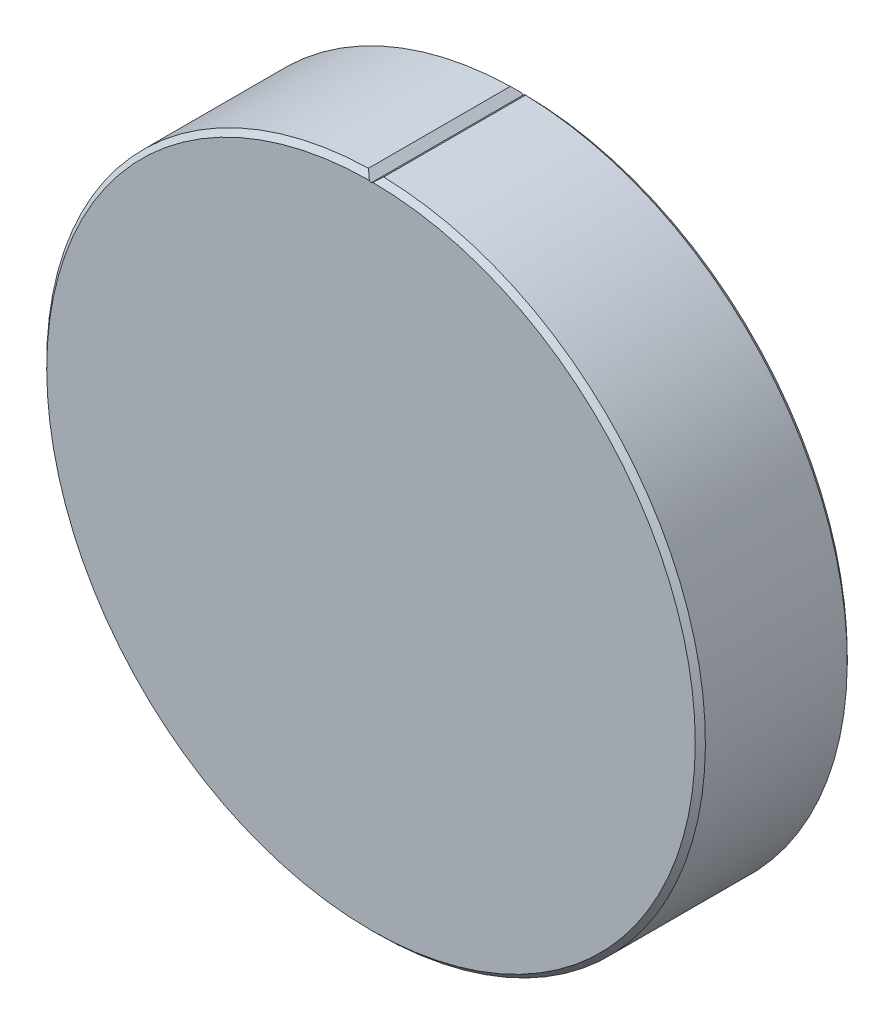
ISO-10303-21;
HEADER;
FILE_DESCRIPTION(('STEP AP214'),'2;1');
FILE_NAME('part.step','',(''),(''),'','','');
FILE_SCHEMA(('AUTOMOTIVE_DESIGN { 1 0 10303 214 1 1 1 1 }'));
ENDSEC;
DATA;
#1=APPLICATION_CONTEXT('core data for automotive mechanical design processes');
#2=APPLICATION_PROTOCOL_DEFINITION('international standard','automotive_design',2000,#1);
#3=PRODUCT_CONTEXT('',#1,'mechanical');
#4=PRODUCT('Part','Part','',(#3));
#5=PRODUCT_RELATED_PRODUCT_CATEGORY('part','',(#4));
#6=PRODUCT_DEFINITION_FORMATION('','',#4);
#7=PRODUCT_DEFINITION_CONTEXT('part definition',#1,'design');
#8=PRODUCT_DEFINITION('design','',#6,#7);
#9=PRODUCT_DEFINITION_SHAPE('','',#8);
#10=(LENGTH_UNIT() NAMED_UNIT(*) SI_UNIT(.MILLI.,.METRE.));
#11=(NAMED_UNIT(*) PLANE_ANGLE_UNIT() SI_UNIT($,.RADIAN.));
#12=(NAMED_UNIT(*) SI_UNIT($,.STERADIAN.) SOLID_ANGLE_UNIT());
#13=UNCERTAINTY_MEASURE_WITH_UNIT(LENGTH_MEASURE(1.E-05),#10,'distance_accuracy_value','');
#14=(GEOMETRIC_REPRESENTATION_CONTEXT(3) GLOBAL_UNCERTAINTY_ASSIGNED_CONTEXT((#13)) GLOBAL_UNIT_ASSIGNED_CONTEXT((#10,
#11,#12)) REPRESENTATION_CONTEXT('',''));
#15=CARTESIAN_POINT('',(0.,0.,0.));
#16=DIRECTION('',(0.,0.,1.));
#17=DIRECTION('',(1.,0.,0.));
#18=AXIS2_PLACEMENT_3D('',#15,#16,#17);
#19=CARTESIAN_POINT('',(0.,0.,7.));
#20=DIRECTION('',(0.,0.,-1.));
#21=DIRECTION('',(-1.,0.,0.));
#22=AXIS2_PLACEMENT_3D('',#19,#20,#21);
#23=PLANE('',#22);
#24=CARTESIAN_POINT('',(0.,0.,7.));
#25=DIRECTION('',(0.,0.,-1.));
#26=DIRECTION('',(0.,1.,0.));
#27=AXIS2_PLACEMENT_3D('',#24,#25,#26);
#28=CIRCLE('',#27,22.);
#29=CARTESIAN_POINT('',(0.,22.,7.));
#30=VERTEX_POINT('',#29);
#31=EDGE_CURVE('E21',#30,#30,#28,.T.);
#32=ORIENTED_EDGE('',*,*,#31,.T.);
#33=EDGE_LOOP('',(#32));
#34=FACE_BOUND('',#33,.T.);
#35=ADVANCED_FACE('F17',(#34),#23,.T.);
#36=CARTESIAN_POINT('',(5.65761933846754,28.4427731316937,14.9999999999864));
#37=DIRECTION('',(0.,0.,-1.));
#38=DIRECTION('',(-1.,0.,0.));
#39=AXIS2_PLACEMENT_3D('',#36,#37,#38);
#40=CONICAL_SURFACE('',#39,2.50000000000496,1.02974425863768);
#41=CARTESIAN_POINT('',(5.65761933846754,28.4427731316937,16.5021515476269));
#42=VERTEX_POINT('',#41);
#43=VERTEX_LOOP('',#42);
#44=FACE_BOUND('',#43,.T.);
#45=CARTESIAN_POINT('',(5.65761933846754,28.4427731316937,15.));
#46=DIRECTION('',(0.,0.,-1.));
#47=DIRECTION('',(-1.,0.,0.));
#48=AXIS2_PLACEMENT_3D('',#45,#46,#47);
#49=CIRCLE('',#48,2.5);
#50=CARTESIAN_POINT('',(3.15761933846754,28.4427731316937,15.));
#51=VERTEX_POINT('',#50);
#52=EDGE_CURVE('E613',#51,#51,#49,.T.);
#53=ORIENTED_EDGE('',*,*,#52,.T.);
#54=EDGE_LOOP('',(#53));
#55=FACE_BOUND('',#54,.T.);
#56=ADVANCED_FACE('F1002',(#44,#55),#40,.F.);
#57=CARTESIAN_POINT('',(16.1115367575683,24.1126187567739,14.9999999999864));
#58=DIRECTION('',(0.,0.,-1.));
#59=DIRECTION('',(-1.,0.,0.));
#60=AXIS2_PLACEMENT_3D('',#57,#58,#59);
#61=CONICAL_SURFACE('',#60,2.49999999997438,1.02974425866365);
#62=CARTESIAN_POINT('',(16.1115367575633,24.1126187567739,16.5021515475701));
#63=VERTEX_POINT('',#62);
#64=VERTEX_LOOP('',#63);
#65=FACE_BOUND('',#64,.T.);
#66=CARTESIAN_POINT('',(16.1115367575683,24.1126187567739,15.));
#67=DIRECTION('',(0.,0.,-1.));
#68=DIRECTION('',(-1.,0.,0.));
#69=AXIS2_PLACEMENT_3D('',#66,#67,#68);
#70=CIRCLE('',#69,2.5);
#71=CARTESIAN_POINT('',(13.6115367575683,24.1126187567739,15.));
#72=VERTEX_POINT('',#71);
#73=EDGE_CURVE('E610',#72,#72,#70,.T.);
#74=ORIENTED_EDGE('',*,*,#73,.T.);
#75=EDGE_LOOP('',(#74));
#76=FACE_BOUND('',#75,.T.);
#77=ADVANCED_FACE('F998',(#65,#76),#61,.F.);
#78=CARTESIAN_POINT('',(24.1126187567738,16.1115367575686,14.9999999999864));
#79=DIRECTION('',(0.,0.,-1.));
#80=DIRECTION('',(-1.,0.,0.));
#81=AXIS2_PLACEMENT_3D('',#78,#79,#80);
#82=CONICAL_SURFACE('',#81,2.49999999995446,1.02974425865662);
#83=CARTESIAN_POINT('',(24.1126187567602,16.1115367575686,16.5021515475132));
#84=VERTEX_POINT('',#83);
#85=VERTEX_LOOP('',#84);
#86=FACE_BOUND('',#85,.T.);
#87=CARTESIAN_POINT('',(24.1126187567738,16.1115367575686,15.));
#88=DIRECTION('',(0.,0.,-1.));
#89=DIRECTION('',(-1.,0.,0.));
#90=AXIS2_PLACEMENT_3D('',#87,#88,#89);
#91=CIRCLE('',#90,2.5);
#92=CARTESIAN_POINT('',(21.6126187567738,16.1115367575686,15.));
#93=VERTEX_POINT('',#92);
#94=EDGE_CURVE('E607',#93,#93,#91,.T.);
#95=ORIENTED_EDGE('',*,*,#94,.T.);
#96=EDGE_LOOP('',(#95));
#97=FACE_BOUND('',#96,.T.);
#98=ADVANCED_FACE('F994',(#86,#97),#82,.F.);
#99=CARTESIAN_POINT('',(28.4427731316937,5.65761933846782,15.0000000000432));
#100=DIRECTION('',(0.,0.,-1.));
#101=DIRECTION('',(-1.,0.,0.));
#102=AXIS2_PLACEMENT_3D('',#99,#100,#101);
#103=CONICAL_SURFACE('',#102,2.50000000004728,1.02974425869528);
#104=CARTESIAN_POINT('',(28.4427731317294,5.65761933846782,16.5021515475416));
#105=VERTEX_POINT('',#104);
#106=VERTEX_LOOP('',#105);
#107=FACE_BOUND('',#106,.T.);
#108=CARTESIAN_POINT('',(28.4427731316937,5.65761933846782,15.));
#109=DIRECTION('',(0.,0.,-1.));
#110=DIRECTION('',(-1.,0.,0.));
#111=AXIS2_PLACEMENT_3D('',#108,#109,#110);
#112=CIRCLE('',#111,2.5);
#113=CARTESIAN_POINT('',(25.9427731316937,5.65761933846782,15.));
#114=VERTEX_POINT('',#113);
#115=EDGE_CURVE('E604',#114,#114,#112,.T.);
#116=ORIENTED_EDGE('',*,*,#115,.T.);
#117=EDGE_LOOP('',(#116));
#118=FACE_BOUND('',#117,.T.);
#119=ADVANCED_FACE('F990',(#107,#118),#103,.F.);
#120=CARTESIAN_POINT('',(24.1126187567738,-16.1115367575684,14.9999999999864));
#121=DIRECTION('',(0.,0.,-1.));
#122=DIRECTION('',(-1.,0.,0.));
#123=AXIS2_PLACEMENT_3D('',#120,#121,#122);
#124=CONICAL_SURFACE('',#123,2.49999999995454,1.02974425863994);
#125=CARTESIAN_POINT('',(24.1126187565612,-16.1115367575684,16.5021515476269));
#126=VERTEX_POINT('',#125);
#127=VERTEX_LOOP('',#126);
#128=FACE_BOUND('',#127,.T.);
#129=CARTESIAN_POINT('',(24.1126187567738,-16.1115367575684,15.));
#130=DIRECTION('',(0.,0.,-1.));
#131=DIRECTION('',(-1.,0.,0.));
#132=AXIS2_PLACEMENT_3D('',#129,#130,#131);
#133=CIRCLE('',#132,2.5);
#134=CARTESIAN_POINT('',(21.6126187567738,-16.1115367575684,15.));
#135=VERTEX_POINT('',#134);
#136=EDGE_CURVE('E601',#135,#135,#133,.T.);
#137=ORIENTED_EDGE('',*,*,#136,.T.);
#138=EDGE_LOOP('',(#137));
#139=FACE_BOUND('',#138,.T.);
#140=ADVANCED_FACE('F986',(#128,#139),#124,.F.);
#141=CARTESIAN_POINT('',(16.1115367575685,-24.1126187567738,15.0000000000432));
#142=DIRECTION('',(0.,0.,-1.));
#143=DIRECTION('',(-1.,0.,0.));
#144=AXIS2_PLACEMENT_3D('',#141,#142,#143);
#145=CONICAL_SURFACE('',#144,2.49999999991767,1.02974425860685);
#146=CARTESIAN_POINT('',(16.1115367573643,-24.1126187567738,16.5021515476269));
#147=VERTEX_POINT('',#146);
#148=VERTEX_LOOP('',#147);
#149=FACE_BOUND('',#148,.T.);
#150=CARTESIAN_POINT('',(16.1115367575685,-24.1126187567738,15.));
#151=DIRECTION('',(0.,0.,-1.));
#152=DIRECTION('',(-1.,0.,0.));
#153=AXIS2_PLACEMENT_3D('',#150,#151,#152);
#154=CIRCLE('',#153,2.5);
#155=CARTESIAN_POINT('',(13.6115367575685,-24.1126187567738,15.));
#156=VERTEX_POINT('',#155);
#157=EDGE_CURVE('E598',#156,#156,#154,.T.);
#158=ORIENTED_EDGE('',*,*,#157,.T.);
#159=EDGE_LOOP('',(#158));
#160=FACE_BOUND('',#159,.T.);
#161=ADVANCED_FACE('F982',(#149,#160),#145,.F.);
#162=CARTESIAN_POINT('',(5.65761933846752,-28.4427731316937,15.0000000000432));
#163=DIRECTION('',(0.,0.,-1.));
#164=DIRECTION('',(0.,1.,0.));
#165=AXIS2_PLACEMENT_3D('',#162,#163,#164);
#166=CONICAL_SURFACE('',#165,2.49999999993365,1.02974425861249);
#167=CARTESIAN_POINT('',(5.65761933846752,-28.4427731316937,16.5021515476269));
#168=VERTEX_POINT('',#167);
#169=VERTEX_LOOP('',#168);
#170=FACE_BOUND('',#169,.T.);
#171=CARTESIAN_POINT('',(5.65761933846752,-28.4427731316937,15.));
#172=DIRECTION('',(0.,0.,-1.));
#173=DIRECTION('',(-1.,0.,0.));
#174=AXIS2_PLACEMENT_3D('',#171,#172,#173);
#175=CIRCLE('',#174,2.5);
#176=CARTESIAN_POINT('',(3.15761933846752,-28.4427731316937,15.));
#177=VERTEX_POINT('',#176);
#178=EDGE_CURVE('E595',#177,#177,#175,.T.);
#179=ORIENTED_EDGE('',*,*,#178,.T.);
#180=EDGE_LOOP('',(#179));
#181=FACE_BOUND('',#180,.T.);
#182=ADVANCED_FACE('F978',(#170,#181),#166,.F.);
#183=CARTESIAN_POINT('',(-16.1115367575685,-24.1126187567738,15.0000000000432));
#184=DIRECTION('',(0.,0.,-1.));
#185=DIRECTION('',(-1.,0.,0.));
#186=AXIS2_PLACEMENT_3D('',#183,#184,#185);
#187=CONICAL_SURFACE('',#186,2.49999999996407,1.02974425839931);
#188=CARTESIAN_POINT('',(-16.1115367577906,-24.1126187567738,16.5021515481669));
#189=VERTEX_POINT('',#188);
#190=VERTEX_LOOP('',#189);
#191=FACE_BOUND('',#190,.T.);
#192=CARTESIAN_POINT('',(-16.1115367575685,-24.1126187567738,15.));
#193=DIRECTION('',(0.,0.,-1.));
#194=DIRECTION('',(-1.,0.,0.));
#195=AXIS2_PLACEMENT_3D('',#192,#193,#194);
#196=CIRCLE('',#195,2.5);
#197=CARTESIAN_POINT('',(-18.6115367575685,-24.1126187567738,15.));
#198=VERTEX_POINT('',#197);
#199=EDGE_CURVE('E592',#198,#198,#196,.T.);
#200=ORIENTED_EDGE('',*,*,#199,.T.);
#201=EDGE_LOOP('',(#200));
#202=FACE_BOUND('',#201,.T.);
#203=ADVANCED_FACE('F974',(#191,#202),#187,.F.);
#204=CARTESIAN_POINT('',(-24.1126187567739,-16.1115367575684,15.0000000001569));
#205=DIRECTION('',(0.,0.,-1.));
#206=DIRECTION('',(-1.,0.,0.));
#207=AXIS2_PLACEMENT_3D('',#204,#205,#206);
#208=CONICAL_SURFACE('',#207,2.49999999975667,1.02974425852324);
#209=CARTESIAN_POINT('',(-24.1126187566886,-16.1115367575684,16.5021515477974));
#210=VERTEX_POINT('',#209);
#211=VERTEX_LOOP('',#210);
#212=FACE_BOUND('',#211,.T.);
#213=CARTESIAN_POINT('',(-24.1126187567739,-16.1115367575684,15.));
#214=DIRECTION('',(0.,0.,-1.));
#215=DIRECTION('',(-1.,0.,0.));
#216=AXIS2_PLACEMENT_3D('',#213,#214,#215);
#217=CIRCLE('',#216,2.5);
#218=CARTESIAN_POINT('',(-26.6126187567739,-16.1115367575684,15.));
#219=VERTEX_POINT('',#218);
#220=EDGE_CURVE('E589',#219,#219,#217,.T.);
#221=ORIENTED_EDGE('',*,*,#220,.T.);
#222=EDGE_LOOP('',(#221));
#223=FACE_BOUND('',#222,.T.);
#224=ADVANCED_FACE('F970',(#212,#223),#208,.F.);
#225=CARTESIAN_POINT('',(-28.4427731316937,-5.65761933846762,14.9999999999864));
#226=DIRECTION('',(0.,0.,-1.));
#227=DIRECTION('',(-1.,0.,0.));
#228=AXIS2_PLACEMENT_3D('',#225,#226,#227);
#229=CONICAL_SURFACE('',#228,2.50000000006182,1.02974425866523);
#230=CARTESIAN_POINT('',(-28.442773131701,-5.65761933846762,16.5021515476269));
#231=VERTEX_POINT('',#230);
#232=VERTEX_LOOP('',#231);
#233=FACE_BOUND('',#232,.T.);
#234=CARTESIAN_POINT('',(-28.4427731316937,-5.65761933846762,15.));
#235=DIRECTION('',(0.,0.,-1.));
#236=DIRECTION('',(-1.,0.,0.));
#237=AXIS2_PLACEMENT_3D('',#234,#235,#236);
#238=CIRCLE('',#237,2.5);
#239=CARTESIAN_POINT('',(-30.9427731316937,-5.65761933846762,15.));
#240=VERTEX_POINT('',#239);
#241=EDGE_CURVE('E586',#240,#240,#238,.T.);
#242=ORIENTED_EDGE('',*,*,#241,.T.);
#243=EDGE_LOOP('',(#242));
#244=FACE_BOUND('',#243,.T.);
#245=ADVANCED_FACE('F966',(#233,#244),#229,.F.);
#246=CARTESIAN_POINT('',(-28.4427731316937,5.65761933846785,15.0000000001));
#247=DIRECTION('',(0.,0.,-1.));
#248=DIRECTION('',(0.,1.,0.));
#249=AXIS2_PLACEMENT_3D('',#246,#247,#248);
#250=CONICAL_SURFACE('',#249,2.49999999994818,1.0297442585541);
#251=CARTESIAN_POINT('',(-28.4427731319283,5.65761933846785,16.5021515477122));
#252=VERTEX_POINT('',#251);
#253=VERTEX_LOOP('',#252);
#254=FACE_BOUND('',#253,.T.);
#255=CARTESIAN_POINT('',(-28.4427731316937,5.65761933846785,15.));
#256=DIRECTION('',(0.,0.,-1.));
#257=DIRECTION('',(-1.,0.,0.));
#258=AXIS2_PLACEMENT_3D('',#255,#256,#257);
#259=CIRCLE('',#258,2.5);
#260=CARTESIAN_POINT('',(-30.9427731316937,5.65761933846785,15.));
#261=VERTEX_POINT('',#260);
#262=EDGE_CURVE('E583',#261,#261,#259,.T.);
#263=ORIENTED_EDGE('',*,*,#262,.T.);
#264=EDGE_LOOP('',(#263));
#265=FACE_BOUND('',#264,.T.);
#266=ADVANCED_FACE('F962',(#254,#265),#250,.F.);
#267=CARTESIAN_POINT('',(-24.1126187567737,16.1115367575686,15.0000000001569));
#268=DIRECTION('',(0.,0.,-1.));
#269=DIRECTION('',(-1.,0.,0.));
#270=AXIS2_PLACEMENT_3D('',#267,#268,#269);
#271=CONICAL_SURFACE('',#270,2.49999999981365,1.02974425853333);
#272=CARTESIAN_POINT('',(-24.1126187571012,16.1115367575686,16.502151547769));
#273=VERTEX_POINT('',#272);
#274=VERTEX_LOOP('',#273);
#275=FACE_BOUND('',#274,.T.);
#276=CARTESIAN_POINT('',(-24.1126187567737,16.1115367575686,15.));
#277=DIRECTION('',(0.,0.,-1.));
#278=DIRECTION('',(-1.,0.,0.));
#279=AXIS2_PLACEMENT_3D('',#276,#277,#278);
#280=CIRCLE('',#279,2.5);
#281=CARTESIAN_POINT('',(-26.6126187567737,16.1115367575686,15.));
#282=VERTEX_POINT('',#281);
#283=EDGE_CURVE('E580',#282,#282,#280,.T.);
#284=ORIENTED_EDGE('',*,*,#283,.T.);
#285=EDGE_LOOP('',(#284));
#286=FACE_BOUND('',#285,.T.);
#287=ADVANCED_FACE('F958',(#275,#286),#271,.F.);
#288=CARTESIAN_POINT('',(-5.65761933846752,28.4427731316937,14.9999999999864));
#289=DIRECTION('',(0.,0.,-1.));
#290=DIRECTION('',(-1.,0.,0.));
#291=AXIS2_PLACEMENT_3D('',#288,#289,#290);
#292=CONICAL_SURFACE('',#291,2.50000000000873,1.0297442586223);
#293=CARTESIAN_POINT('',(-5.65761933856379,28.4427731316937,16.5021515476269));
#294=VERTEX_POINT('',#293);
#295=VERTEX_LOOP('',#294);
#296=FACE_BOUND('',#295,.T.);
#297=CARTESIAN_POINT('',(-5.65761933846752,28.4427731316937,15.));
#298=DIRECTION('',(0.,0.,-1.));
#299=DIRECTION('',(-1.,0.,0.));
#300=AXIS2_PLACEMENT_3D('',#297,#298,#299);
#301=CIRCLE('',#300,2.5);
#302=CARTESIAN_POINT('',(-8.15761933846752,28.4427731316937,15.));
#303=VERTEX_POINT('',#302);
#304=EDGE_CURVE('E577',#303,#303,#301,.T.);
#305=ORIENTED_EDGE('',*,*,#304,.T.);
#306=EDGE_LOOP('',(#305));
#307=FACE_BOUND('',#306,.T.);
#308=ADVANCED_FACE('F954',(#296,#307),#292,.F.);
#309=CARTESIAN_POINT('',(-16.1115367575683,24.1126187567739,14.9999999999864));
#310=DIRECTION('',(0.,0.,-1.));
#311=DIRECTION('',(-1.,0.,0.));
#312=AXIS2_PLACEMENT_3D('',#309,#310,#311);
#313=CONICAL_SURFACE('',#312,2.5000000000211,1.02974425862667);
#314=CARTESIAN_POINT('',(-16.1115367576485,24.1126187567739,16.5021515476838));
#315=VERTEX_POINT('',#314);
#316=VERTEX_LOOP('',#315);
#317=FACE_BOUND('',#316,.T.);
#318=CARTESIAN_POINT('',(-16.1115367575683,24.1126187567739,15.));
#319=DIRECTION('',(0.,0.,-1.));
#320=DIRECTION('',(-1.,0.,0.));
#321=AXIS2_PLACEMENT_3D('',#318,#319,#320);
#322=CIRCLE('',#321,2.5);
#323=CARTESIAN_POINT('',(-18.6115367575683,24.1126187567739,15.));
#324=VERTEX_POINT('',#323);
#325=EDGE_CURVE('E574',#324,#324,#322,.T.);
#326=ORIENTED_EDGE('',*,*,#325,.T.);
#327=EDGE_LOOP('',(#326));
#328=FACE_BOUND('',#327,.T.);
#329=ADVANCED_FACE('F950',(#317,#328),#313,.F.);
#330=CARTESIAN_POINT('',(-5.65761933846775,-28.4427731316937,15.0000000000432));
#331=DIRECTION('',(0.,0.,-1.));
#332=DIRECTION('',(-1.,0.,0.));
#333=AXIS2_PLACEMENT_3D('',#330,#331,#332);
#334=CONICAL_SURFACE('',#333,2.49999999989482,1.02974425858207);
#335=CARTESIAN_POINT('',(-5.65761933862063,-28.4427731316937,16.5021515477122));
#336=VERTEX_POINT('',#335);
#337=VERTEX_LOOP('',#336);
#338=FACE_BOUND('',#337,.T.);
#339=CARTESIAN_POINT('',(-5.65761933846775,-28.4427731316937,15.));
#340=DIRECTION('',(0.,0.,-1.));
#341=DIRECTION('',(-1.,0.,0.));
#342=AXIS2_PLACEMENT_3D('',#339,#340,#341);
#343=CIRCLE('',#342,2.5);
#344=CARTESIAN_POINT('',(-8.15761933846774,-28.4427731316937,15.));
#345=VERTEX_POINT('',#344);
#346=EDGE_CURVE('E567',#345,#345,#343,.T.);
#347=ORIENTED_EDGE('',*,*,#346,.T.);
#348=EDGE_LOOP('',(#347));
#349=FACE_BOUND('',#348,.T.);
#350=ADVANCED_FACE('F946',(#338,#349),#334,.F.);
#351=CARTESIAN_POINT('',(28.4427731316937,-5.65761933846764,14.9999999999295));
#352=DIRECTION('',(0.,0.,-1.));
#353=DIRECTION('',(0.,1.,0.));
#354=AXIS2_PLACEMENT_3D('',#351,#352,#353);
#355=CONICAL_SURFACE('',#354,2.50000000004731,1.0297442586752);
#356=CARTESIAN_POINT('',(28.4427731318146,-5.65761933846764,16.5021515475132));
#357=VERTEX_POINT('',#356);
#358=VERTEX_LOOP('',#357);
#359=FACE_BOUND('',#358,.T.);
#360=CARTESIAN_POINT('',(28.4427731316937,-5.65761933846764,15.));
#361=DIRECTION('',(0.,0.,-1.));
#362=DIRECTION('',(-1.,0.,0.));
#363=AXIS2_PLACEMENT_3D('',#360,#361,#362);
#364=CIRCLE('',#363,2.5);
#365=CARTESIAN_POINT('',(25.9427731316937,-5.65761933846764,15.));
#366=VERTEX_POINT('',#365);
#367=EDGE_CURVE('E562',#366,#366,#364,.T.);
#368=ORIENTED_EDGE('',*,*,#367,.T.);
#369=EDGE_LOOP('',(#368));
#370=FACE_BOUND('',#369,.T.);
#371=ADVANCED_FACE('F943',(#359,#370),#355,.F.);
#372=CARTESIAN_POINT('',(0.,0.,6.5));
#373=DIRECTION('',(0.,0.,-1.));
#374=DIRECTION('',(0.,1.,0.));
#375=AXIS2_PLACEMENT_3D('',#372,#373,#374);
#376=TOROIDAL_SURFACE('',#375,22.,0.499999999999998);
#377=ORIENTED_EDGE('',*,*,#31,.F.);
#378=EDGE_LOOP('',(#377));
#379=FACE_BOUND('',#378,.T.);
#380=CARTESIAN_POINT('',(0.,0.,6.5));
#381=DIRECTION('',(0.,0.,-1.));
#382=DIRECTION('',(-1.,0.,0.));
#383=AXIS2_PLACEMENT_3D('',#380,#381,#382);
#384=CIRCLE('',#383,22.5);
#385=CARTESIAN_POINT('',(-22.5,0.,6.5));
#386=VERTEX_POINT('',#385);
#387=EDGE_CURVE('E558',#386,#386,#384,.T.);
#388=ORIENTED_EDGE('',*,*,#387,.T.);
#389=EDGE_LOOP('',(#388));
#390=FACE_BOUND('',#389,.T.);
#391=ADVANCED_FACE('F627',(#379,#390),#376,.F.);
#392=CARTESIAN_POINT('',(5.65761933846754,28.4427731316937,0.));
#393=DIRECTION('',(0.,0.,-1.));
#394=DIRECTION('',(-1.,0.,0.));
#395=AXIS2_PLACEMENT_3D('',#392,#393,#394);
#396=CYLINDRICAL_SURFACE('',#395,2.5);
#397=ORIENTED_EDGE('',*,*,#52,.F.);
#398=EDGE_LOOP('',(#397));
#399=FACE_BOUND('',#398,.T.);
#400=CARTESIAN_POINT('',(5.65761933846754,28.4427731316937,12.));
#401=DIRECTION('',(0.,0.,-1.));
#402=DIRECTION('',(-1.,0.,0.));
#403=AXIS2_PLACEMENT_3D('',#400,#401,#402);
#404=CIRCLE('',#403,2.5);
#405=CARTESIAN_POINT('',(3.15761933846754,28.4427731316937,12.));
#406=VERTEX_POINT('',#405);
#407=EDGE_CURVE('E556',#406,#406,#404,.T.);
#408=ORIENTED_EDGE('',*,*,#407,.T.);
#409=EDGE_LOOP('',(#408));
#410=FACE_BOUND('',#409,.T.);
#411=ADVANCED_FACE('F938',(#399,#410),#396,.F.);
#412=CARTESIAN_POINT('',(16.1115367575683,24.1126187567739,0.));
#413=DIRECTION('',(0.,0.,-1.));
#414=DIRECTION('',(-1.,0.,0.));
#415=AXIS2_PLACEMENT_3D('',#412,#413,#414);
#416=CYLINDRICAL_SURFACE('',#415,2.5);
#417=ORIENTED_EDGE('',*,*,#73,.F.);
#418=EDGE_LOOP('',(#417));
#419=FACE_BOUND('',#418,.T.);
#420=CARTESIAN_POINT('',(16.1115367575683,24.1126187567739,12.));
#421=DIRECTION('',(0.,0.,-1.));
#422=DIRECTION('',(-1.,0.,0.));
#423=AXIS2_PLACEMENT_3D('',#420,#421,#422);
#424=CIRCLE('',#423,2.5);
#425=CARTESIAN_POINT('',(13.6115367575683,24.1126187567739,12.));
#426=VERTEX_POINT('',#425);
#427=EDGE_CURVE('E554',#426,#426,#424,.T.);
#428=ORIENTED_EDGE('',*,*,#427,.T.);
#429=EDGE_LOOP('',(#428));
#430=FACE_BOUND('',#429,.T.);
#431=ADVANCED_FACE('F934',(#419,#430),#416,.F.);
#432=CARTESIAN_POINT('',(24.1126187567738,16.1115367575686,0.));
#433=DIRECTION('',(0.,0.,-1.));
#434=DIRECTION('',(-1.,0.,0.));
#435=AXIS2_PLACEMENT_3D('',#432,#433,#434);
#436=CYLINDRICAL_SURFACE('',#435,2.5);
#437=ORIENTED_EDGE('',*,*,#94,.F.);
#438=EDGE_LOOP('',(#437));
#439=FACE_BOUND('',#438,.T.);
#440=CARTESIAN_POINT('',(24.1126187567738,16.1115367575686,12.));
#441=DIRECTION('',(0.,0.,-1.));
#442=DIRECTION('',(-1.,0.,0.));
#443=AXIS2_PLACEMENT_3D('',#440,#441,#442);
#444=CIRCLE('',#443,2.5);
#445=CARTESIAN_POINT('',(21.6126187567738,16.1115367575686,12.));
#446=VERTEX_POINT('',#445);
#447=EDGE_CURVE('E551',#446,#446,#444,.T.);
#448=ORIENTED_EDGE('',*,*,#447,.T.);
#449=EDGE_LOOP('',(#448));
#450=FACE_BOUND('',#449,.T.);
#451=ADVANCED_FACE('F930',(#439,#450),#436,.F.);
#452=CARTESIAN_POINT('',(28.4427731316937,5.65761933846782,0.));
#453=DIRECTION('',(0.,0.,-1.));
#454=DIRECTION('',(-1.,0.,0.));
#455=AXIS2_PLACEMENT_3D('',#452,#453,#454);
#456=CYLINDRICAL_SURFACE('',#455,2.5);
#457=ORIENTED_EDGE('',*,*,#115,.F.);
#458=EDGE_LOOP('',(#457));
#459=FACE_BOUND('',#458,.T.);
#460=CARTESIAN_POINT('',(28.4427731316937,5.65761933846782,12.));
#461=DIRECTION('',(0.,0.,-1.));
#462=DIRECTION('',(-1.,0.,0.));
#463=AXIS2_PLACEMENT_3D('',#460,#461,#462);
#464=CIRCLE('',#463,2.5);
#465=CARTESIAN_POINT('',(25.9427731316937,5.65761933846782,12.));
#466=VERTEX_POINT('',#465);
#467=EDGE_CURVE('E548',#466,#466,#464,.T.);
#468=ORIENTED_EDGE('',*,*,#467,.T.);
#469=EDGE_LOOP('',(#468));
#470=FACE_BOUND('',#469,.T.);
#471=ADVANCED_FACE('F926',(#459,#470),#456,.F.);
#472=CARTESIAN_POINT('',(24.1126187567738,-16.1115367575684,0.));
#473=DIRECTION('',(0.,0.,-1.));
#474=DIRECTION('',(-1.,0.,0.));
#475=AXIS2_PLACEMENT_3D('',#472,#473,#474);
#476=CYLINDRICAL_SURFACE('',#475,2.5);
#477=ORIENTED_EDGE('',*,*,#136,.F.);
#478=EDGE_LOOP('',(#477));
#479=FACE_BOUND('',#478,.T.);
#480=CARTESIAN_POINT('',(24.1126187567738,-16.1115367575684,12.));
#481=DIRECTION('',(0.,0.,-1.));
#482=DIRECTION('',(-1.,0.,0.));
#483=AXIS2_PLACEMENT_3D('',#480,#481,#482);
#484=CIRCLE('',#483,2.5);
#485=CARTESIAN_POINT('',(21.6126187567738,-16.1115367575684,12.));
#486=VERTEX_POINT('',#485);
#487=EDGE_CURVE('E545',#486,#486,#484,.T.);
#488=ORIENTED_EDGE('',*,*,#487,.T.);
#489=EDGE_LOOP('',(#488));
#490=FACE_BOUND('',#489,.T.);
#491=ADVANCED_FACE('F922',(#479,#490),#476,.F.);
#492=CARTESIAN_POINT('',(16.1115367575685,-24.1126187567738,0.));
#493=DIRECTION('',(0.,0.,-1.));
#494=DIRECTION('',(-1.,0.,0.));
#495=AXIS2_PLACEMENT_3D('',#492,#493,#494);
#496=CYLINDRICAL_SURFACE('',#495,2.5);
#497=ORIENTED_EDGE('',*,*,#157,.F.);
#498=EDGE_LOOP('',(#497));
#499=FACE_BOUND('',#498,.T.);
#500=CARTESIAN_POINT('',(16.1115367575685,-24.1126187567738,12.));
#501=DIRECTION('',(0.,0.,-1.));
#502=DIRECTION('',(-1.,0.,0.));
#503=AXIS2_PLACEMENT_3D('',#500,#501,#502);
#504=CIRCLE('',#503,2.5);
#505=CARTESIAN_POINT('',(13.6115367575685,-24.1126187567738,12.));
#506=VERTEX_POINT('',#505);
#507=EDGE_CURVE('E542',#506,#506,#504,.T.);
#508=ORIENTED_EDGE('',*,*,#507,.T.);
#509=EDGE_LOOP('',(#508));
#510=FACE_BOUND('',#509,.T.);
#511=ADVANCED_FACE('F918',(#499,#510),#496,.F.);
#512=CARTESIAN_POINT('',(5.65761933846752,-28.4427731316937,0.));
#513=DIRECTION('',(0.,0.,-1.));
#514=DIRECTION('',(-1.,0.,0.));
#515=AXIS2_PLACEMENT_3D('',#512,#513,#514);
#516=CYLINDRICAL_SURFACE('',#515,2.5);
#517=ORIENTED_EDGE('',*,*,#178,.F.);
#518=EDGE_LOOP('',(#517));
#519=FACE_BOUND('',#518,.T.);
#520=CARTESIAN_POINT('',(5.65761933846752,-28.4427731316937,12.));
#521=DIRECTION('',(0.,0.,-1.));
#522=DIRECTION('',(-1.,0.,0.));
#523=AXIS2_PLACEMENT_3D('',#520,#521,#522);
#524=CIRCLE('',#523,2.5);
#525=CARTESIAN_POINT('',(3.15761933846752,-28.4427731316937,12.));
#526=VERTEX_POINT('',#525);
#527=EDGE_CURVE('E539',#526,#526,#524,.T.);
#528=ORIENTED_EDGE('',*,*,#527,.T.);
#529=EDGE_LOOP('',(#528));
#530=FACE_BOUND('',#529,.T.);
#531=ADVANCED_FACE('F914',(#519,#530),#516,.F.);
#532=CARTESIAN_POINT('',(-16.1115367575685,-24.1126187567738,0.));
#533=DIRECTION('',(0.,0.,-1.));
#534=DIRECTION('',(-1.,0.,0.));
#535=AXIS2_PLACEMENT_3D('',#532,#533,#534);
#536=CYLINDRICAL_SURFACE('',#535,2.5);
#537=ORIENTED_EDGE('',*,*,#199,.F.);
#538=EDGE_LOOP('',(#537));
#539=FACE_BOUND('',#538,.T.);
#540=CARTESIAN_POINT('',(-16.1115367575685,-24.1126187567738,12.));
#541=DIRECTION('',(0.,0.,-1.));
#542=DIRECTION('',(-1.,0.,0.));
#543=AXIS2_PLACEMENT_3D('',#540,#541,#542);
#544=CIRCLE('',#543,2.5);
#545=CARTESIAN_POINT('',(-18.6115367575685,-24.1126187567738,12.));
#546=VERTEX_POINT('',#545);
#547=EDGE_CURVE('E536',#546,#546,#544,.T.);
#548=ORIENTED_EDGE('',*,*,#547,.T.);
#549=EDGE_LOOP('',(#548));
#550=FACE_BOUND('',#549,.T.);
#551=ADVANCED_FACE('F910',(#539,#550),#536,.F.);
#552=CARTESIAN_POINT('',(-24.1126187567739,-16.1115367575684,0.));
#553=DIRECTION('',(0.,0.,-1.));
#554=DIRECTION('',(-1.,0.,0.));
#555=AXIS2_PLACEMENT_3D('',#552,#553,#554);
#556=CYLINDRICAL_SURFACE('',#555,2.5);
#557=ORIENTED_EDGE('',*,*,#220,.F.);
#558=EDGE_LOOP('',(#557));
#559=FACE_BOUND('',#558,.T.);
#560=CARTESIAN_POINT('',(-24.1126187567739,-16.1115367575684,12.));
#561=DIRECTION('',(0.,0.,-1.));
#562=DIRECTION('',(-1.,0.,0.));
#563=AXIS2_PLACEMENT_3D('',#560,#561,#562);
#564=CIRCLE('',#563,2.5);
#565=CARTESIAN_POINT('',(-26.6126187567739,-16.1115367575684,12.));
#566=VERTEX_POINT('',#565);
#567=EDGE_CURVE('E533',#566,#566,#564,.T.);
#568=ORIENTED_EDGE('',*,*,#567,.T.);
#569=EDGE_LOOP('',(#568));
#570=FACE_BOUND('',#569,.T.);
#571=ADVANCED_FACE('F906',(#559,#570),#556,.F.);
#572=CARTESIAN_POINT('',(-28.4427731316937,-5.65761933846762,0.));
#573=DIRECTION('',(0.,0.,-1.));
#574=DIRECTION('',(-1.,0.,0.));
#575=AXIS2_PLACEMENT_3D('',#572,#573,#574);
#576=CYLINDRICAL_SURFACE('',#575,2.5);
#577=ORIENTED_EDGE('',*,*,#241,.F.);
#578=EDGE_LOOP('',(#577));
#579=FACE_BOUND('',#578,.T.);
#580=CARTESIAN_POINT('',(-28.4427731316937,-5.65761933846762,12.));
#581=DIRECTION('',(0.,0.,-1.));
#582=DIRECTION('',(-1.,0.,0.));
#583=AXIS2_PLACEMENT_3D('',#580,#581,#582);
#584=CIRCLE('',#583,2.5);
#585=CARTESIAN_POINT('',(-30.9427731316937,-5.65761933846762,12.));
#586=VERTEX_POINT('',#585);
#587=EDGE_CURVE('E530',#586,#586,#584,.T.);
#588=ORIENTED_EDGE('',*,*,#587,.T.);
#589=EDGE_LOOP('',(#588));
#590=FACE_BOUND('',#589,.T.);
#591=ADVANCED_FACE('F902',(#579,#590),#576,.F.);
#592=CARTESIAN_POINT('',(-28.4427731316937,5.65761933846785,0.));
#593=DIRECTION('',(0.,0.,-1.));
#594=DIRECTION('',(-1.,0.,0.));
#595=AXIS2_PLACEMENT_3D('',#592,#593,#594);
#596=CYLINDRICAL_SURFACE('',#595,2.5);
#597=ORIENTED_EDGE('',*,*,#262,.F.);
#598=EDGE_LOOP('',(#597));
#599=FACE_BOUND('',#598,.T.);
#600=CARTESIAN_POINT('',(-28.4427731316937,5.65761933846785,12.));
#601=DIRECTION('',(0.,0.,-1.));
#602=DIRECTION('',(-1.,0.,0.));
#603=AXIS2_PLACEMENT_3D('',#600,#601,#602);
#604=CIRCLE('',#603,2.5);
#605=CARTESIAN_POINT('',(-30.9427731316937,5.65761933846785,12.));
#606=VERTEX_POINT('',#605);
#607=EDGE_CURVE('E527',#606,#606,#604,.T.);
#608=ORIENTED_EDGE('',*,*,#607,.T.);
#609=EDGE_LOOP('',(#608));
#610=FACE_BOUND('',#609,.T.);
#611=ADVANCED_FACE('F898',(#599,#610),#596,.F.);
#612=CARTESIAN_POINT('',(-24.1126187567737,16.1115367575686,0.));
#613=DIRECTION('',(0.,0.,-1.));
#614=DIRECTION('',(-1.,0.,0.));
#615=AXIS2_PLACEMENT_3D('',#612,#613,#614);
#616=CYLINDRICAL_SURFACE('',#615,2.5);
#617=ORIENTED_EDGE('',*,*,#283,.F.);
#618=EDGE_LOOP('',(#617));
#619=FACE_BOUND('',#618,.T.);
#620=CARTESIAN_POINT('',(-24.1126187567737,16.1115367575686,12.));
#621=DIRECTION('',(0.,0.,-1.));
#622=DIRECTION('',(-1.,0.,0.));
#623=AXIS2_PLACEMENT_3D('',#620,#621,#622);
#624=CIRCLE('',#623,2.5);
#625=CARTESIAN_POINT('',(-26.6126187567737,16.1115367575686,12.));
#626=VERTEX_POINT('',#625);
#627=EDGE_CURVE('E524',#626,#626,#624,.T.);
#628=ORIENTED_EDGE('',*,*,#627,.T.);
#629=EDGE_LOOP('',(#628));
#630=FACE_BOUND('',#629,.T.);
#631=ADVANCED_FACE('F894',(#619,#630),#616,.F.);
#632=CARTESIAN_POINT('',(-5.65761933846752,28.4427731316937,0.));
#633=DIRECTION('',(0.,0.,-1.));
#634=DIRECTION('',(-1.,0.,0.));
#635=AXIS2_PLACEMENT_3D('',#632,#633,#634);
#636=CYLINDRICAL_SURFACE('',#635,2.5);
#637=ORIENTED_EDGE('',*,*,#304,.F.);
#638=EDGE_LOOP('',(#637));
#639=FACE_BOUND('',#638,.T.);
#640=CARTESIAN_POINT('',(-5.65761933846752,28.4427731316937,12.));
#641=DIRECTION('',(0.,0.,-1.));
#642=DIRECTION('',(-1.,0.,0.));
#643=AXIS2_PLACEMENT_3D('',#640,#641,#642);
#644=CIRCLE('',#643,2.5);
#645=CARTESIAN_POINT('',(-8.15761933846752,28.4427731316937,12.));
#646=VERTEX_POINT('',#645);
#647=EDGE_CURVE('E521',#646,#646,#644,.T.);
#648=ORIENTED_EDGE('',*,*,#647,.T.);
#649=EDGE_LOOP('',(#648));
#650=FACE_BOUND('',#649,.T.);
#651=ADVANCED_FACE('F890',(#639,#650),#636,.F.);
#652=CARTESIAN_POINT('',(-16.1115367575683,24.1126187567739,0.));
#653=DIRECTION('',(0.,0.,-1.));
#654=DIRECTION('',(-1.,0.,0.));
#655=AXIS2_PLACEMENT_3D('',#652,#653,#654);
#656=CYLINDRICAL_SURFACE('',#655,2.5);
#657=ORIENTED_EDGE('',*,*,#325,.F.);
#658=EDGE_LOOP('',(#657));
#659=FACE_BOUND('',#658,.T.);
#660=CARTESIAN_POINT('',(-16.1115367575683,24.1126187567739,12.));
#661=DIRECTION('',(0.,0.,-1.));
#662=DIRECTION('',(-1.,0.,0.));
#663=AXIS2_PLACEMENT_3D('',#660,#661,#662);
#664=CIRCLE('',#663,2.5);
#665=CARTESIAN_POINT('',(-18.6115367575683,24.1126187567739,12.));
#666=VERTEX_POINT('',#665);
#667=EDGE_CURVE('E518',#666,#666,#664,.T.);
#668=ORIENTED_EDGE('',*,*,#667,.T.);
#669=EDGE_LOOP('',(#668));
#670=FACE_BOUND('',#669,.T.);
#671=ADVANCED_FACE('F886',(#659,#670),#656,.F.);
#672=CARTESIAN_POINT('',(-5.65761933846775,-28.4427731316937,0.));
#673=DIRECTION('',(0.,0.,-1.));
#674=DIRECTION('',(-1.,0.,0.));
#675=AXIS2_PLACEMENT_3D('',#672,#673,#674);
#676=CYLINDRICAL_SURFACE('',#675,2.5);
#677=ORIENTED_EDGE('',*,*,#346,.F.);
#678=EDGE_LOOP('',(#677));
#679=FACE_BOUND('',#678,.T.);
#680=CARTESIAN_POINT('',(-5.65761933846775,-28.4427731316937,12.));
#681=DIRECTION('',(0.,0.,-1.));
#682=DIRECTION('',(-1.,0.,0.));
#683=AXIS2_PLACEMENT_3D('',#680,#681,#682);
#684=CIRCLE('',#683,2.5);
#685=CARTESIAN_POINT('',(-8.15761933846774,-28.4427731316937,12.));
#686=VERTEX_POINT('',#685);
#687=EDGE_CURVE('E515',#686,#686,#684,.T.);
#688=ORIENTED_EDGE('',*,*,#687,.T.);
#689=EDGE_LOOP('',(#688));
#690=FACE_BOUND('',#689,.T.);
#691=ADVANCED_FACE('F882',(#679,#690),#676,.F.);
#692=CARTESIAN_POINT('',(28.4427731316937,-5.65761933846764,0.));
#693=DIRECTION('',(0.,0.,-1.));
#694=DIRECTION('',(-1.,0.,0.));
#695=AXIS2_PLACEMENT_3D('',#692,#693,#694);
#696=CYLINDRICAL_SURFACE('',#695,2.5);
#697=ORIENTED_EDGE('',*,*,#367,.F.);
#698=EDGE_LOOP('',(#697));
#699=FACE_BOUND('',#698,.T.);
#700=CARTESIAN_POINT('',(28.4427731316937,-5.65761933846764,12.));
#701=DIRECTION('',(0.,0.,-1.));
#702=DIRECTION('',(-1.,0.,0.));
#703=AXIS2_PLACEMENT_3D('',#700,#701,#702);
#704=CIRCLE('',#703,2.5);
#705=CARTESIAN_POINT('',(25.9427731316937,-5.65761933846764,12.));
#706=VERTEX_POINT('',#705);
#707=EDGE_CURVE('E511',#706,#706,#704,.T.);
#708=ORIENTED_EDGE('',*,*,#707,.T.);
#709=EDGE_LOOP('',(#708));
#710=FACE_BOUND('',#709,.T.);
#711=ADVANCED_FACE('F878',(#699,#710),#696,.F.);
#712=CARTESIAN_POINT('',(0.,0.,7.));
#713=DIRECTION('',(0.,0.,-1.));
#714=DIRECTION('',(-1.,0.,0.));
#715=AXIS2_PLACEMENT_3D('',#712,#713,#714);
#716=CYLINDRICAL_SURFACE('',#715,22.5);
#717=ORIENTED_EDGE('',*,*,#387,.F.);
#718=EDGE_LOOP('',(#717));
#719=FACE_BOUND('',#718,.T.);
#720=CARTESIAN_POINT('',(0.,0.,1.00000000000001));
#721=DIRECTION('',(0.,0.,-1.));
#722=DIRECTION('',(-1.,0.,0.));
#723=AXIS2_PLACEMENT_3D('',#720,#721,#722);
#724=CIRCLE('',#723,22.5);
#725=CARTESIAN_POINT('',(-22.5,0.,1.00000000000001));
#726=VERTEX_POINT('',#725);
#727=EDGE_CURVE('E514',#726,#726,#724,.T.);
#728=ORIENTED_EDGE('',*,*,#727,.T.);
#729=EDGE_LOOP('',(#728));
#730=FACE_BOUND('',#729,.T.);
#731=ADVANCED_FACE('F717',(#719,#730),#716,.F.);
#732=CARTESIAN_POINT('',(-1.84964890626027E-13,26.5,9.99999999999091));
#733=DIRECTION('',(0.,0.,-1.));
#734=DIRECTION('',(-1.,0.,0.));
#735=AXIS2_PLACEMENT_3D('',#732,#733,#734);
#736=CONICAL_SURFACE('',#735,1.99999999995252,1.02974425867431);
#737=CARTESIAN_POINT('',(0.,26.5,11.2017212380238));
#738=VERTEX_POINT('',#737);
#739=VERTEX_LOOP('',#738);
#740=FACE_BOUND('',#739,.T.);
#741=CARTESIAN_POINT('',(-1.85048510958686E-13,26.5,10.));
#742=DIRECTION('',(0.,0.,-1.));
#743=DIRECTION('',(-1.,0.,0.));
#744=AXIS2_PLACEMENT_3D('',#741,#742,#743);
#745=CIRCLE('',#744,2.);
#746=CARTESIAN_POINT('',(-2.00000000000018,26.5,10.));
#747=VERTEX_POINT('',#746);
#748=EDGE_CURVE('E510',#747,#747,#745,.T.);
#749=ORIENTED_EDGE('',*,*,#748,.T.);
#750=EDGE_LOOP('',(#749));
#751=FACE_BOUND('',#750,.T.);
#752=ADVANCED_FACE('F871',(#740,#751),#736,.F.);
#753=CARTESIAN_POINT('',(8.15761933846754,28.4427731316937,12.));
#754=DIRECTION('',(0.,0.,1.));
#755=DIRECTION('',(1.,0.,0.));
#756=AXIS2_PLACEMENT_3D('',#753,#754,#755);
#757=PLANE('',#756);
#758=ORIENTED_EDGE('',*,*,#407,.F.);
#759=EDGE_LOOP('',(#758));
#760=FACE_BOUND('',#759,.T.);
#761=CARTESIAN_POINT('',(5.65761933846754,28.4427731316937,12.));
#762=DIRECTION('',(0.,0.,-1.));
#763=DIRECTION('',(-1.,0.,0.));
#764=AXIS2_PLACEMENT_3D('',#761,#762,#763);
#765=CIRCLE('',#764,3.);
#766=CARTESIAN_POINT('',(2.65761933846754,28.4427731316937,12.));
#767=VERTEX_POINT('',#766);
#768=EDGE_CURVE('E507',#767,#767,#765,.T.);
#769=ORIENTED_EDGE('',*,*,#768,.T.);
#770=EDGE_LOOP('',(#769));
#771=FACE_BOUND('',#770,.T.);
#772=ADVANCED_FACE('F867',(#760,#771),#757,.F.);
#773=CARTESIAN_POINT('',(18.6115367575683,24.1126187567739,12.));
#774=DIRECTION('',(0.,0.,1.));
#775=DIRECTION('',(1.,0.,0.));
#776=AXIS2_PLACEMENT_3D('',#773,#774,#775);
#777=PLANE('',#776);
#778=ORIENTED_EDGE('',*,*,#427,.F.);
#779=EDGE_LOOP('',(#778));
#780=FACE_BOUND('',#779,.T.);
#781=CARTESIAN_POINT('',(16.1115367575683,24.1126187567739,12.));
#782=DIRECTION('',(0.,0.,-1.));
#783=DIRECTION('',(-1.,0.,0.));
#784=AXIS2_PLACEMENT_3D('',#781,#782,#783);
#785=CIRCLE('',#784,3.);
#786=CARTESIAN_POINT('',(13.1115367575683,24.1126187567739,12.));
#787=VERTEX_POINT('',#786);
#788=EDGE_CURVE('E504',#787,#787,#785,.T.);
#789=ORIENTED_EDGE('',*,*,#788,.T.);
#790=EDGE_LOOP('',(#789));
#791=FACE_BOUND('',#790,.T.);
#792=ADVANCED_FACE('F863',(#780,#791),#777,.F.);
#793=CARTESIAN_POINT('',(26.6126187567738,16.1115367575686,12.));
#794=DIRECTION('',(0.,0.,1.));
#795=DIRECTION('',(1.,0.,0.));
#796=AXIS2_PLACEMENT_3D('',#793,#794,#795);
#797=PLANE('',#796);
#798=ORIENTED_EDGE('',*,*,#447,.F.);
#799=EDGE_LOOP('',(#798));
#800=FACE_BOUND('',#799,.T.);
#801=CARTESIAN_POINT('',(24.1126187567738,16.1115367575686,12.));
#802=DIRECTION('',(0.,0.,-1.));
#803=DIRECTION('',(-1.,0.,0.));
#804=AXIS2_PLACEMENT_3D('',#801,#802,#803);
#805=CIRCLE('',#804,3.);
#806=CARTESIAN_POINT('',(21.1126187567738,16.1115367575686,12.));
#807=VERTEX_POINT('',#806);
#808=EDGE_CURVE('E501',#807,#807,#805,.T.);
#809=ORIENTED_EDGE('',*,*,#808,.T.);
#810=EDGE_LOOP('',(#809));
#811=FACE_BOUND('',#810,.T.);
#812=ADVANCED_FACE('F859',(#800,#811),#797,.F.);
#813=CARTESIAN_POINT('',(30.9427731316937,5.65761933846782,12.));
#814=DIRECTION('',(0.,0.,1.));
#815=DIRECTION('',(1.,0.,0.));
#816=AXIS2_PLACEMENT_3D('',#813,#814,#815);
#817=PLANE('',#816);
#818=ORIENTED_EDGE('',*,*,#467,.F.);
#819=EDGE_LOOP('',(#818));
#820=FACE_BOUND('',#819,.T.);
#821=CARTESIAN_POINT('',(28.4427731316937,5.65761933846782,12.));
#822=DIRECTION('',(0.,0.,-1.));
#823=DIRECTION('',(-1.,0.,0.));
#824=AXIS2_PLACEMENT_3D('',#821,#822,#823);
#825=CIRCLE('',#824,3.);
#826=CARTESIAN_POINT('',(25.4427731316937,5.65761933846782,12.));
#827=VERTEX_POINT('',#826);
#828=EDGE_CURVE('E498',#827,#827,#825,.T.);
#829=ORIENTED_EDGE('',*,*,#828,.T.);
#830=EDGE_LOOP('',(#829));
#831=FACE_BOUND('',#830,.T.);
#832=ADVANCED_FACE('F855',(#820,#831),#817,.F.);
#833=CARTESIAN_POINT('',(26.6126187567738,-16.1115367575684,12.));
#834=DIRECTION('',(0.,0.,1.));
#835=DIRECTION('',(1.,0.,0.));
#836=AXIS2_PLACEMENT_3D('',#833,#834,#835);
#837=PLANE('',#836);
#838=ORIENTED_EDGE('',*,*,#487,.F.);
#839=EDGE_LOOP('',(#838));
#840=FACE_BOUND('',#839,.T.);
#841=CARTESIAN_POINT('',(24.1126187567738,-16.1115367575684,12.));
#842=DIRECTION('',(0.,0.,-1.));
#843=DIRECTION('',(-1.,0.,0.));
#844=AXIS2_PLACEMENT_3D('',#841,#842,#843);
#845=CIRCLE('',#844,3.);
#846=CARTESIAN_POINT('',(21.1126187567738,-16.1115367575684,12.));
#847=VERTEX_POINT('',#846);
#848=EDGE_CURVE('E495',#847,#847,#845,.T.);
#849=ORIENTED_EDGE('',*,*,#848,.T.);
#850=EDGE_LOOP('',(#849));
#851=FACE_BOUND('',#850,.T.);
#852=ADVANCED_FACE('F851',(#840,#851),#837,.F.);
#853=CARTESIAN_POINT('',(18.6115367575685,-24.1126187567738,12.));
#854=DIRECTION('',(0.,0.,1.));
#855=DIRECTION('',(1.,0.,0.));
#856=AXIS2_PLACEMENT_3D('',#853,#854,#855);
#857=PLANE('',#856);
#858=ORIENTED_EDGE('',*,*,#507,.F.);
#859=EDGE_LOOP('',(#858));
#860=FACE_BOUND('',#859,.T.);
#861=CARTESIAN_POINT('',(16.1115367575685,-24.1126187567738,12.));
#862=DIRECTION('',(0.,0.,-1.));
#863=DIRECTION('',(-1.,0.,0.));
#864=AXIS2_PLACEMENT_3D('',#861,#862,#863);
#865=CIRCLE('',#864,3.);
#866=CARTESIAN_POINT('',(13.1115367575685,-24.1126187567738,12.));
#867=VERTEX_POINT('',#866);
#868=EDGE_CURVE('E492',#867,#867,#865,.T.);
#869=ORIENTED_EDGE('',*,*,#868,.T.);
#870=EDGE_LOOP('',(#869));
#871=FACE_BOUND('',#870,.T.);
#872=ADVANCED_FACE('F847',(#860,#871),#857,.F.);
#873=CARTESIAN_POINT('',(8.15761933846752,-28.4427731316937,12.));
#874=DIRECTION('',(0.,0.,1.));
#875=DIRECTION('',(1.,0.,0.));
#876=AXIS2_PLACEMENT_3D('',#873,#874,#875);
#877=PLANE('',#876);
#878=ORIENTED_EDGE('',*,*,#527,.F.);
#879=EDGE_LOOP('',(#878));
#880=FACE_BOUND('',#879,.T.);
#881=CARTESIAN_POINT('',(5.65761933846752,-28.4427731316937,12.));
#882=DIRECTION('',(0.,0.,-1.));
#883=DIRECTION('',(-1.,0.,0.));
#884=AXIS2_PLACEMENT_3D('',#881,#882,#883);
#885=CIRCLE('',#884,3.);
#886=CARTESIAN_POINT('',(2.65761933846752,-28.4427731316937,12.));
#887=VERTEX_POINT('',#886);
#888=EDGE_CURVE('E489',#887,#887,#885,.T.);
#889=ORIENTED_EDGE('',*,*,#888,.T.);
#890=EDGE_LOOP('',(#889));
#891=FACE_BOUND('',#890,.T.);
#892=ADVANCED_FACE('F843',(#880,#891),#877,.F.);
#893=CARTESIAN_POINT('',(-13.6115367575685,-24.1126187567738,12.));
#894=DIRECTION('',(0.,0.,1.));
#895=DIRECTION('',(1.,0.,0.));
#896=AXIS2_PLACEMENT_3D('',#893,#894,#895);
#897=PLANE('',#896);
#898=ORIENTED_EDGE('',*,*,#547,.F.);
#899=EDGE_LOOP('',(#898));
#900=FACE_BOUND('',#899,.T.);
#901=CARTESIAN_POINT('',(-16.1115367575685,-24.1126187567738,12.));
#902=DIRECTION('',(0.,0.,-1.));
#903=DIRECTION('',(-1.,0.,0.));
#904=AXIS2_PLACEMENT_3D('',#901,#902,#903);
#905=CIRCLE('',#904,3.);
#906=CARTESIAN_POINT('',(-19.1115367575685,-24.1126187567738,12.));
#907=VERTEX_POINT('',#906);
#908=EDGE_CURVE('E486',#907,#907,#905,.T.);
#909=ORIENTED_EDGE('',*,*,#908,.T.);
#910=EDGE_LOOP('',(#909));
#911=FACE_BOUND('',#910,.T.);
#912=ADVANCED_FACE('F839',(#900,#911),#897,.F.);
#913=CARTESIAN_POINT('',(-21.6126187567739,-16.1115367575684,12.));
#914=DIRECTION('',(0.,0.,1.));
#915=DIRECTION('',(1.,0.,0.));
#916=AXIS2_PLACEMENT_3D('',#913,#914,#915);
#917=PLANE('',#916);
#918=ORIENTED_EDGE('',*,*,#567,.F.);
#919=EDGE_LOOP('',(#918));
#920=FACE_BOUND('',#919,.T.);
#921=CARTESIAN_POINT('',(-24.1126187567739,-16.1115367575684,12.));
#922=DIRECTION('',(0.,0.,-1.));
#923=DIRECTION('',(-1.,0.,0.));
#924=AXIS2_PLACEMENT_3D('',#921,#922,#923);
#925=CIRCLE('',#924,3.);
#926=CARTESIAN_POINT('',(-27.1126187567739,-16.1115367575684,12.));
#927=VERTEX_POINT('',#926);
#928=EDGE_CURVE('E483',#927,#927,#925,.T.);
#929=ORIENTED_EDGE('',*,*,#928,.T.);
#930=EDGE_LOOP('',(#929));
#931=FACE_BOUND('',#930,.T.);
#932=ADVANCED_FACE('F835',(#920,#931),#917,.F.);
#933=CARTESIAN_POINT('',(-25.9427731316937,-5.65761933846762,12.));
#934=DIRECTION('',(0.,0.,1.));
#935=DIRECTION('',(1.,0.,0.));
#936=AXIS2_PLACEMENT_3D('',#933,#934,#935);
#937=PLANE('',#936);
#938=ORIENTED_EDGE('',*,*,#587,.F.);
#939=EDGE_LOOP('',(#938));
#940=FACE_BOUND('',#939,.T.);
#941=CARTESIAN_POINT('',(-28.4427731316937,-5.65761933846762,12.));
#942=DIRECTION('',(0.,0.,-1.));
#943=DIRECTION('',(-1.,0.,0.));
#944=AXIS2_PLACEMENT_3D('',#941,#942,#943);
#945=CIRCLE('',#944,3.);
#946=CARTESIAN_POINT('',(-31.4427731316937,-5.65761933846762,12.));
#947=VERTEX_POINT('',#946);
#948=EDGE_CURVE('E480',#947,#947,#945,.T.);
#949=ORIENTED_EDGE('',*,*,#948,.T.);
#950=EDGE_LOOP('',(#949));
#951=FACE_BOUND('',#950,.T.);
#952=ADVANCED_FACE('F831',(#940,#951),#937,.F.);
#953=CARTESIAN_POINT('',(-25.9427731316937,5.65761933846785,12.));
#954=DIRECTION('',(0.,0.,1.));
#955=DIRECTION('',(1.,0.,0.));
#956=AXIS2_PLACEMENT_3D('',#953,#954,#955);
#957=PLANE('',#956);
#958=ORIENTED_EDGE('',*,*,#607,.F.);
#959=EDGE_LOOP('',(#958));
#960=FACE_BOUND('',#959,.T.);
#961=CARTESIAN_POINT('',(-28.4427731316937,5.65761933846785,12.));
#962=DIRECTION('',(0.,0.,-1.));
#963=DIRECTION('',(-1.,0.,0.));
#964=AXIS2_PLACEMENT_3D('',#961,#962,#963);
#965=CIRCLE('',#964,3.);
#966=CARTESIAN_POINT('',(-31.4427731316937,5.65761933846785,12.));
#967=VERTEX_POINT('',#966);
#968=EDGE_CURVE('E477',#967,#967,#965,.T.);
#969=ORIENTED_EDGE('',*,*,#968,.T.);
#970=EDGE_LOOP('',(#969));
#971=FACE_BOUND('',#970,.T.);
#972=ADVANCED_FACE('F827',(#960,#971),#957,.F.);
#973=CARTESIAN_POINT('',(-21.6126187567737,16.1115367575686,12.));
#974=DIRECTION('',(0.,0.,1.));
#975=DIRECTION('',(1.,0.,0.));
#976=AXIS2_PLACEMENT_3D('',#973,#974,#975);
#977=PLANE('',#976);
#978=ORIENTED_EDGE('',*,*,#627,.F.);
#979=EDGE_LOOP('',(#978));
#980=FACE_BOUND('',#979,.T.);
#981=CARTESIAN_POINT('',(-24.1126187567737,16.1115367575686,12.));
#982=DIRECTION('',(0.,0.,-1.));
#983=DIRECTION('',(-1.,0.,0.));
#984=AXIS2_PLACEMENT_3D('',#981,#982,#983);
#985=CIRCLE('',#984,3.);
#986=CARTESIAN_POINT('',(-27.1126187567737,16.1115367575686,12.));
#987=VERTEX_POINT('',#986);
#988=EDGE_CURVE('E474',#987,#987,#985,.T.);
#989=ORIENTED_EDGE('',*,*,#988,.T.);
#990=EDGE_LOOP('',(#989));
#991=FACE_BOUND('',#990,.T.);
#992=ADVANCED_FACE('F823',(#980,#991),#977,.F.);
#993=CARTESIAN_POINT('',(-3.15761933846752,28.4427731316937,12.));
#994=DIRECTION('',(0.,0.,1.));
#995=DIRECTION('',(1.,0.,0.));
#996=AXIS2_PLACEMENT_3D('',#993,#994,#995);
#997=PLANE('',#996);
#998=ORIENTED_EDGE('',*,*,#647,.F.);
#999=EDGE_LOOP('',(#998));
#1000=FACE_BOUND('',#999,.T.);
#1001=CARTESIAN_POINT('',(-5.65761933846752,28.4427731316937,12.));
#1002=DIRECTION('',(0.,0.,-1.));
#1003=DIRECTION('',(-1.,0.,0.));
#1004=AXIS2_PLACEMENT_3D('',#1001,#1002,#1003);
#1005=CIRCLE('',#1004,3.);
#1006=CARTESIAN_POINT('',(-8.65761933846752,28.4427731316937,12.));
#1007=VERTEX_POINT('',#1006);
#1008=EDGE_CURVE('E471',#1007,#1007,#1005,.T.);
#1009=ORIENTED_EDGE('',*,*,#1008,.T.);
#1010=EDGE_LOOP('',(#1009));
#1011=FACE_BOUND('',#1010,.T.);
#1012=ADVANCED_FACE('F819',(#1000,#1011),#997,.F.);
#1013=CARTESIAN_POINT('',(-13.6115367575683,24.1126187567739,12.));
#1014=DIRECTION('',(0.,0.,1.));
#1015=DIRECTION('',(1.,0.,0.));
#1016=AXIS2_PLACEMENT_3D('',#1013,#1014,#1015);
#1017=PLANE('',#1016);
#1018=ORIENTED_EDGE('',*,*,#667,.F.);
#1019=EDGE_LOOP('',(#1018));
#1020=FACE_BOUND('',#1019,.T.);
#1021=CARTESIAN_POINT('',(-16.1115367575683,24.1126187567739,12.));
#1022=DIRECTION('',(0.,0.,-1.));
#1023=DIRECTION('',(-1.,0.,0.));
#1024=AXIS2_PLACEMENT_3D('',#1021,#1022,#1023);
#1025=CIRCLE('',#1024,3.);
#1026=CARTESIAN_POINT('',(-19.1115367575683,24.1126187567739,12.));
#1027=VERTEX_POINT('',#1026);
#1028=EDGE_CURVE('E468',#1027,#1027,#1025,.T.);
#1029=ORIENTED_EDGE('',*,*,#1028,.T.);
#1030=EDGE_LOOP('',(#1029));
#1031=FACE_BOUND('',#1030,.T.);
#1032=ADVANCED_FACE('F815',(#1020,#1031),#1017,.F.);
#1033=CARTESIAN_POINT('',(-3.15761933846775,-28.4427731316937,12.));
#1034=DIRECTION('',(0.,0.,1.));
#1035=DIRECTION('',(1.,0.,0.));
#1036=AXIS2_PLACEMENT_3D('',#1033,#1034,#1035);
#1037=PLANE('',#1036);
#1038=ORIENTED_EDGE('',*,*,#687,.F.);
#1039=EDGE_LOOP('',(#1038));
#1040=FACE_BOUND('',#1039,.T.);
#1041=CARTESIAN_POINT('',(-5.65761933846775,-28.4427731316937,12.));
#1042=DIRECTION('',(0.,0.,-1.));
#1043=DIRECTION('',(-1.,0.,0.));
#1044=AXIS2_PLACEMENT_3D('',#1041,#1042,#1043);
#1045=CIRCLE('',#1044,3.);
#1046=CARTESIAN_POINT('',(-8.65761933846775,-28.4427731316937,12.));
#1047=VERTEX_POINT('',#1046);
#1048=EDGE_CURVE('E465',#1047,#1047,#1045,.T.);
#1049=ORIENTED_EDGE('',*,*,#1048,.T.);
#1050=EDGE_LOOP('',(#1049));
#1051=FACE_BOUND('',#1050,.T.);
#1052=ADVANCED_FACE('F811',(#1040,#1051),#1037,.F.);
#1053=CARTESIAN_POINT('',(30.9427731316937,-5.65761933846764,12.));
#1054=DIRECTION('',(0.,0.,1.));
#1055=DIRECTION('',(1.,0.,0.));
#1056=AXIS2_PLACEMENT_3D('',#1053,#1054,#1055);
#1057=PLANE('',#1056);
#1058=ORIENTED_EDGE('',*,*,#707,.F.);
#1059=EDGE_LOOP('',(#1058));
#1060=FACE_BOUND('',#1059,.T.);
#1061=CARTESIAN_POINT('',(28.4427731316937,-5.65761933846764,12.));
#1062=DIRECTION('',(0.,0.,-1.));
#1063=DIRECTION('',(-1.,0.,0.));
#1064=AXIS2_PLACEMENT_3D('',#1061,#1062,#1063);
#1065=CIRCLE('',#1064,3.);
#1066=CARTESIAN_POINT('',(25.4427731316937,-5.65761933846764,12.));
#1067=VERTEX_POINT('',#1066);
#1068=EDGE_CURVE('E462',#1067,#1067,#1065,.T.);
#1069=ORIENTED_EDGE('',*,*,#1068,.T.);
#1070=EDGE_LOOP('',(#1069));
#1071=FACE_BOUND('',#1070,.T.);
#1072=ADVANCED_FACE('F723',(#1060,#1071),#1057,.F.);
#1073=CARTESIAN_POINT('',(0.,0.,0.));
#1074=DIRECTION('',(0.,0.,-1.));
#1075=DIRECTION('',(-1.,0.,0.));
#1076=AXIS2_PLACEMENT_3D('',#1073,#1074,#1075);
#1077=CONICAL_SURFACE('',#1076,23.5,0.785398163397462);
#1078=ORIENTED_EDGE('',*,*,#727,.F.);
#1079=EDGE_LOOP('',(#1078));
#1080=FACE_BOUND('',#1079,.T.);
#1081=CARTESIAN_POINT('',(0.,0.,0.));
#1082=DIRECTION('',(0.,0.,-1.));
#1083=DIRECTION('',(-1.,0.,0.));
#1084=AXIS2_PLACEMENT_3D('',#1081,#1082,#1083);
#1085=CIRCLE('',#1084,23.5);
#1086=CARTESIAN_POINT('',(-23.5,0.,0.));
#1087=VERTEX_POINT('',#1086);
#1088=EDGE_CURVE('E459',#1087,#1087,#1085,.T.);
#1089=ORIENTED_EDGE('',*,*,#1088,.T.);
#1090=EDGE_LOOP('',(#1089));
#1091=FACE_BOUND('',#1090,.T.);
#1092=ADVANCED_FACE('F719',(#1080,#1091),#1077,.F.);
#1093=CARTESIAN_POINT('',(-1.85048510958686E-13,26.5,0.));
#1094=DIRECTION('',(0.,0.,-1.));
#1095=DIRECTION('',(-1.,0.,0.));
#1096=AXIS2_PLACEMENT_3D('',#1093,#1094,#1095);
#1097=CYLINDRICAL_SURFACE('',#1096,2.);
#1098=ORIENTED_EDGE('',*,*,#748,.F.);
#1099=EDGE_LOOP('',(#1098));
#1100=FACE_BOUND('',#1099,.T.);
#1101=CARTESIAN_POINT('',(-1.85048510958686E-13,26.5,0.));
#1102=DIRECTION('',(0.,0.,-1.));
#1103=DIRECTION('',(-1.,0.,0.));
#1104=AXIS2_PLACEMENT_3D('',#1101,#1102,#1103);
#1105=CIRCLE('',#1104,2.);
#1106=CARTESIAN_POINT('',(-2.00000000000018,26.5,0.));
#1107=VERTEX_POINT('',#1106);
#1108=EDGE_CURVE('E456',#1107,#1107,#1105,.T.);
#1109=ORIENTED_EDGE('',*,*,#1108,.T.);
#1110=EDGE_LOOP('',(#1109));
#1111=FACE_BOUND('',#1110,.T.);
#1112=ADVANCED_FACE('F722',(#1100,#1111),#1097,.F.);
#1113=CARTESIAN_POINT('',(5.65761933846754,28.4427731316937,0.));
#1114=DIRECTION('',(0.,0.,-1.));
#1115=DIRECTION('',(-1.,0.,0.));
#1116=AXIS2_PLACEMENT_3D('',#1113,#1114,#1115);
#1117=CYLINDRICAL_SURFACE('',#1116,3.);
#1118=ORIENTED_EDGE('',*,*,#768,.F.);
#1119=EDGE_LOOP('',(#1118));
#1120=FACE_BOUND('',#1119,.T.);
#1121=CARTESIAN_POINT('',(5.65761933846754,28.4427731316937,0.));
#1122=DIRECTION('',(0.,0.,-1.));
#1123=DIRECTION('',(-1.,0.,0.));
#1124=AXIS2_PLACEMENT_3D('',#1121,#1122,#1123);
#1125=CIRCLE('',#1124,3.);
#1126=CARTESIAN_POINT('',(2.65761933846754,28.4427731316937,0.));
#1127=VERTEX_POINT('',#1126);
#1128=EDGE_CURVE('E453',#1127,#1127,#1125,.T.);
#1129=ORIENTED_EDGE('',*,*,#1128,.T.);
#1130=EDGE_LOOP('',(#1129));
#1131=FACE_BOUND('',#1130,.T.);
#1132=ADVANCED_FACE('F801',(#1120,#1131),#1117,.F.);
#1133=CARTESIAN_POINT('',(16.1115367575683,24.1126187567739,0.));
#1134=DIRECTION('',(0.,0.,-1.));
#1135=DIRECTION('',(-1.,0.,0.));
#1136=AXIS2_PLACEMENT_3D('',#1133,#1134,#1135);
#1137=CYLINDRICAL_SURFACE('',#1136,3.);
#1138=ORIENTED_EDGE('',*,*,#788,.F.);
#1139=EDGE_LOOP('',(#1138));
#1140=FACE_BOUND('',#1139,.T.);
#1141=CARTESIAN_POINT('',(16.1115367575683,24.1126187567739,0.));
#1142=DIRECTION('',(0.,0.,-1.));
#1143=DIRECTION('',(-1.,0.,0.));
#1144=AXIS2_PLACEMENT_3D('',#1141,#1142,#1143);
#1145=CIRCLE('',#1144,3.);
#1146=CARTESIAN_POINT('',(13.1115367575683,24.1126187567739,0.));
#1147=VERTEX_POINT('',#1146);
#1148=EDGE_CURVE('E450',#1147,#1147,#1145,.T.);
#1149=ORIENTED_EDGE('',*,*,#1148,.T.);
#1150=EDGE_LOOP('',(#1149));
#1151=FACE_BOUND('',#1150,.T.);
#1152=ADVANCED_FACE('F797',(#1140,#1151),#1137,.F.);
#1153=CARTESIAN_POINT('',(24.1126187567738,16.1115367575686,0.));
#1154=DIRECTION('',(0.,0.,-1.));
#1155=DIRECTION('',(-1.,0.,0.));
#1156=AXIS2_PLACEMENT_3D('',#1153,#1154,#1155);
#1157=CYLINDRICAL_SURFACE('',#1156,3.);
#1158=ORIENTED_EDGE('',*,*,#808,.F.);
#1159=EDGE_LOOP('',(#1158));
#1160=FACE_BOUND('',#1159,.T.);
#1161=CARTESIAN_POINT('',(24.1126187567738,16.1115367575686,0.));
#1162=DIRECTION('',(0.,0.,-1.));
#1163=DIRECTION('',(-1.,0.,0.));
#1164=AXIS2_PLACEMENT_3D('',#1161,#1162,#1163);
#1165=CIRCLE('',#1164,3.);
#1166=CARTESIAN_POINT('',(21.1126187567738,16.1115367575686,0.));
#1167=VERTEX_POINT('',#1166);
#1168=EDGE_CURVE('E447',#1167,#1167,#1165,.T.);
#1169=ORIENTED_EDGE('',*,*,#1168,.T.);
#1170=EDGE_LOOP('',(#1169));
#1171=FACE_BOUND('',#1170,.T.);
#1172=ADVANCED_FACE('F793',(#1160,#1171),#1157,.F.);
#1173=CARTESIAN_POINT('',(28.4427731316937,5.65761933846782,0.));
#1174=DIRECTION('',(0.,0.,-1.));
#1175=DIRECTION('',(-1.,0.,0.));
#1176=AXIS2_PLACEMENT_3D('',#1173,#1174,#1175);
#1177=CYLINDRICAL_SURFACE('',#1176,3.);
#1178=ORIENTED_EDGE('',*,*,#828,.F.);
#1179=EDGE_LOOP('',(#1178));
#1180=FACE_BOUND('',#1179,.T.);
#1181=CARTESIAN_POINT('',(28.4427731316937,5.65761933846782,0.));
#1182=DIRECTION('',(0.,0.,-1.));
#1183=DIRECTION('',(-1.,0.,0.));
#1184=AXIS2_PLACEMENT_3D('',#1181,#1182,#1183);
#1185=CIRCLE('',#1184,3.);
#1186=CARTESIAN_POINT('',(25.4427731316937,5.65761933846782,0.));
#1187=VERTEX_POINT('',#1186);
#1188=EDGE_CURVE('E444',#1187,#1187,#1185,.T.);
#1189=ORIENTED_EDGE('',*,*,#1188,.T.);
#1190=EDGE_LOOP('',(#1189));
#1191=FACE_BOUND('',#1190,.T.);
#1192=ADVANCED_FACE('F789',(#1180,#1191),#1177,.F.);
#1193=CARTESIAN_POINT('',(24.1126187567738,-16.1115367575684,0.));
#1194=DIRECTION('',(0.,0.,-1.));
#1195=DIRECTION('',(-1.,0.,0.));
#1196=AXIS2_PLACEMENT_3D('',#1193,#1194,#1195);
#1197=CYLINDRICAL_SURFACE('',#1196,3.);
#1198=ORIENTED_EDGE('',*,*,#848,.F.);
#1199=EDGE_LOOP('',(#1198));
#1200=FACE_BOUND('',#1199,.T.);
#1201=CARTESIAN_POINT('',(24.1126187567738,-16.1115367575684,0.));
#1202=DIRECTION('',(0.,0.,-1.));
#1203=DIRECTION('',(-1.,0.,0.));
#1204=AXIS2_PLACEMENT_3D('',#1201,#1202,#1203);
#1205=CIRCLE('',#1204,3.);
#1206=CARTESIAN_POINT('',(21.1126187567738,-16.1115367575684,0.));
#1207=VERTEX_POINT('',#1206);
#1208=EDGE_CURVE('E441',#1207,#1207,#1205,.T.);
#1209=ORIENTED_EDGE('',*,*,#1208,.T.);
#1210=EDGE_LOOP('',(#1209));
#1211=FACE_BOUND('',#1210,.T.);
#1212=ADVANCED_FACE('F785',(#1200,#1211),#1197,.F.);
#1213=CARTESIAN_POINT('',(16.1115367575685,-24.1126187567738,0.));
#1214=DIRECTION('',(0.,0.,-1.));
#1215=DIRECTION('',(-1.,0.,0.));
#1216=AXIS2_PLACEMENT_3D('',#1213,#1214,#1215);
#1217=CYLINDRICAL_SURFACE('',#1216,3.);
#1218=ORIENTED_EDGE('',*,*,#868,.F.);
#1219=EDGE_LOOP('',(#1218));
#1220=FACE_BOUND('',#1219,.T.);
#1221=CARTESIAN_POINT('',(16.1115367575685,-24.1126187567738,0.));
#1222=DIRECTION('',(0.,0.,-1.));
#1223=DIRECTION('',(-1.,0.,0.));
#1224=AXIS2_PLACEMENT_3D('',#1221,#1222,#1223);
#1225=CIRCLE('',#1224,3.);
#1226=CARTESIAN_POINT('',(13.1115367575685,-24.1126187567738,0.));
#1227=VERTEX_POINT('',#1226);
#1228=EDGE_CURVE('E438',#1227,#1227,#1225,.T.);
#1229=ORIENTED_EDGE('',*,*,#1228,.T.);
#1230=EDGE_LOOP('',(#1229));
#1231=FACE_BOUND('',#1230,.T.);
#1232=ADVANCED_FACE('F781',(#1220,#1231),#1217,.F.);
#1233=CARTESIAN_POINT('',(5.65761933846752,-28.4427731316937,0.));
#1234=DIRECTION('',(0.,0.,-1.));
#1235=DIRECTION('',(-1.,0.,0.));
#1236=AXIS2_PLACEMENT_3D('',#1233,#1234,#1235);
#1237=CYLINDRICAL_SURFACE('',#1236,3.);
#1238=ORIENTED_EDGE('',*,*,#888,.F.);
#1239=EDGE_LOOP('',(#1238));
#1240=FACE_BOUND('',#1239,.T.);
#1241=CARTESIAN_POINT('',(5.65761933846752,-28.4427731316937,0.));
#1242=DIRECTION('',(0.,0.,-1.));
#1243=DIRECTION('',(-1.,0.,0.));
#1244=AXIS2_PLACEMENT_3D('',#1241,#1242,#1243);
#1245=CIRCLE('',#1244,3.);
#1246=CARTESIAN_POINT('',(2.65761933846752,-28.4427731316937,0.));
#1247=VERTEX_POINT('',#1246);
#1248=EDGE_CURVE('E435',#1247,#1247,#1245,.T.);
#1249=ORIENTED_EDGE('',*,*,#1248,.T.);
#1250=EDGE_LOOP('',(#1249));
#1251=FACE_BOUND('',#1250,.T.);
#1252=ADVANCED_FACE('F777',(#1240,#1251),#1237,.F.);
#1253=CARTESIAN_POINT('',(-16.1115367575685,-24.1126187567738,0.));
#1254=DIRECTION('',(0.,0.,-1.));
#1255=DIRECTION('',(-1.,0.,0.));
#1256=AXIS2_PLACEMENT_3D('',#1253,#1254,#1255);
#1257=CYLINDRICAL_SURFACE('',#1256,3.);
#1258=ORIENTED_EDGE('',*,*,#908,.F.);
#1259=EDGE_LOOP('',(#1258));
#1260=FACE_BOUND('',#1259,.T.);
#1261=CARTESIAN_POINT('',(-16.1115367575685,-24.1126187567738,0.));
#1262=DIRECTION('',(0.,0.,-1.));
#1263=DIRECTION('',(-1.,0.,0.));
#1264=AXIS2_PLACEMENT_3D('',#1261,#1262,#1263);
#1265=CIRCLE('',#1264,3.);
#1266=CARTESIAN_POINT('',(-19.1115367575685,-24.1126187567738,0.));
#1267=VERTEX_POINT('',#1266);
#1268=EDGE_CURVE('E432',#1267,#1267,#1265,.T.);
#1269=ORIENTED_EDGE('',*,*,#1268,.T.);
#1270=EDGE_LOOP('',(#1269));
#1271=FACE_BOUND('',#1270,.T.);
#1272=ADVANCED_FACE('F773',(#1260,#1271),#1257,.F.);
#1273=CARTESIAN_POINT('',(-24.1126187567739,-16.1115367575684,0.));
#1274=DIRECTION('',(0.,0.,-1.));
#1275=DIRECTION('',(-1.,0.,0.));
#1276=AXIS2_PLACEMENT_3D('',#1273,#1274,#1275);
#1277=CYLINDRICAL_SURFACE('',#1276,3.);
#1278=ORIENTED_EDGE('',*,*,#928,.F.);
#1279=EDGE_LOOP('',(#1278));
#1280=FACE_BOUND('',#1279,.T.);
#1281=CARTESIAN_POINT('',(-24.1126187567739,-16.1115367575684,0.));
#1282=DIRECTION('',(0.,0.,-1.));
#1283=DIRECTION('',(-1.,0.,0.));
#1284=AXIS2_PLACEMENT_3D('',#1281,#1282,#1283);
#1285=CIRCLE('',#1284,3.);
#1286=CARTESIAN_POINT('',(-27.1126187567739,-16.1115367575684,0.));
#1287=VERTEX_POINT('',#1286);
#1288=EDGE_CURVE('E429',#1287,#1287,#1285,.T.);
#1289=ORIENTED_EDGE('',*,*,#1288,.T.);
#1290=EDGE_LOOP('',(#1289));
#1291=FACE_BOUND('',#1290,.T.);
#1292=ADVANCED_FACE('F769',(#1280,#1291),#1277,.F.);
#1293=CARTESIAN_POINT('',(-28.4427731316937,-5.65761933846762,0.));
#1294=DIRECTION('',(0.,0.,-1.));
#1295=DIRECTION('',(-1.,0.,0.));
#1296=AXIS2_PLACEMENT_3D('',#1293,#1294,#1295);
#1297=CYLINDRICAL_SURFACE('',#1296,3.);
#1298=ORIENTED_EDGE('',*,*,#948,.F.);
#1299=EDGE_LOOP('',(#1298));
#1300=FACE_BOUND('',#1299,.T.);
#1301=CARTESIAN_POINT('',(-28.4427731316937,-5.65761933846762,0.));
#1302=DIRECTION('',(0.,0.,-1.));
#1303=DIRECTION('',(-1.,0.,0.));
#1304=AXIS2_PLACEMENT_3D('',#1301,#1302,#1303);
#1305=CIRCLE('',#1304,3.);
#1306=CARTESIAN_POINT('',(-31.4427731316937,-5.65761933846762,0.));
#1307=VERTEX_POINT('',#1306);
#1308=EDGE_CURVE('E426',#1307,#1307,#1305,.T.);
#1309=ORIENTED_EDGE('',*,*,#1308,.T.);
#1310=EDGE_LOOP('',(#1309));
#1311=FACE_BOUND('',#1310,.T.);
#1312=ADVANCED_FACE('F765',(#1300,#1311),#1297,.F.);
#1313=CARTESIAN_POINT('',(-28.4427731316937,5.65761933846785,0.));
#1314=DIRECTION('',(0.,0.,-1.));
#1315=DIRECTION('',(-1.,0.,0.));
#1316=AXIS2_PLACEMENT_3D('',#1313,#1314,#1315);
#1317=CYLINDRICAL_SURFACE('',#1316,3.);
#1318=ORIENTED_EDGE('',*,*,#968,.F.);
#1319=EDGE_LOOP('',(#1318));
#1320=FACE_BOUND('',#1319,.T.);
#1321=CARTESIAN_POINT('',(-28.4427731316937,5.65761933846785,0.));
#1322=DIRECTION('',(0.,0.,-1.));
#1323=DIRECTION('',(-1.,0.,0.));
#1324=AXIS2_PLACEMENT_3D('',#1321,#1322,#1323);
#1325=CIRCLE('',#1324,3.);
#1326=CARTESIAN_POINT('',(-31.4427731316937,5.65761933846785,0.));
#1327=VERTEX_POINT('',#1326);
#1328=EDGE_CURVE('E423',#1327,#1327,#1325,.T.);
#1329=ORIENTED_EDGE('',*,*,#1328,.T.);
#1330=EDGE_LOOP('',(#1329));
#1331=FACE_BOUND('',#1330,.T.);
#1332=ADVANCED_FACE('F761',(#1320,#1331),#1317,.F.);
#1333=CARTESIAN_POINT('',(-24.1126187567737,16.1115367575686,0.));
#1334=DIRECTION('',(0.,0.,-1.));
#1335=DIRECTION('',(-1.,0.,0.));
#1336=AXIS2_PLACEMENT_3D('',#1333,#1334,#1335);
#1337=CYLINDRICAL_SURFACE('',#1336,3.);
#1338=ORIENTED_EDGE('',*,*,#988,.F.);
#1339=EDGE_LOOP('',(#1338));
#1340=FACE_BOUND('',#1339,.T.);
#1341=CARTESIAN_POINT('',(-24.1126187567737,16.1115367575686,0.));
#1342=DIRECTION('',(0.,0.,-1.));
#1343=DIRECTION('',(-1.,0.,0.));
#1344=AXIS2_PLACEMENT_3D('',#1341,#1342,#1343);
#1345=CIRCLE('',#1344,3.);
#1346=CARTESIAN_POINT('',(-27.1126187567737,16.1115367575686,0.));
#1347=VERTEX_POINT('',#1346);
#1348=EDGE_CURVE('E420',#1347,#1347,#1345,.T.);
#1349=ORIENTED_EDGE('',*,*,#1348,.T.);
#1350=EDGE_LOOP('',(#1349));
#1351=FACE_BOUND('',#1350,.T.);
#1352=ADVANCED_FACE('F757',(#1340,#1351),#1337,.F.);
#1353=CARTESIAN_POINT('',(-5.65761933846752,28.4427731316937,0.));
#1354=DIRECTION('',(0.,0.,-1.));
#1355=DIRECTION('',(-1.,0.,0.));
#1356=AXIS2_PLACEMENT_3D('',#1353,#1354,#1355);
#1357=CYLINDRICAL_SURFACE('',#1356,3.);
#1358=ORIENTED_EDGE('',*,*,#1008,.F.);
#1359=EDGE_LOOP('',(#1358));
#1360=FACE_BOUND('',#1359,.T.);
#1361=CARTESIAN_POINT('',(-5.65761933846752,28.4427731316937,0.));
#1362=DIRECTION('',(0.,0.,-1.));
#1363=DIRECTION('',(-1.,0.,0.));
#1364=AXIS2_PLACEMENT_3D('',#1361,#1362,#1363);
#1365=CIRCLE('',#1364,3.);
#1366=CARTESIAN_POINT('',(-8.65761933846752,28.4427731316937,0.));
#1367=VERTEX_POINT('',#1366);
#1368=EDGE_CURVE('E417',#1367,#1367,#1365,.T.);
#1369=ORIENTED_EDGE('',*,*,#1368,.T.);
#1370=EDGE_LOOP('',(#1369));
#1371=FACE_BOUND('',#1370,.T.);
#1372=ADVANCED_FACE('F753',(#1360,#1371),#1357,.F.);
#1373=CARTESIAN_POINT('',(-16.1115367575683,24.1126187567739,0.));
#1374=DIRECTION('',(0.,0.,-1.));
#1375=DIRECTION('',(-1.,0.,0.));
#1376=AXIS2_PLACEMENT_3D('',#1373,#1374,#1375);
#1377=CYLINDRICAL_SURFACE('',#1376,3.);
#1378=ORIENTED_EDGE('',*,*,#1028,.F.);
#1379=EDGE_LOOP('',(#1378));
#1380=FACE_BOUND('',#1379,.T.);
#1381=CARTESIAN_POINT('',(-16.1115367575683,24.1126187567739,0.));
#1382=DIRECTION('',(0.,0.,-1.));
#1383=DIRECTION('',(-1.,0.,0.));
#1384=AXIS2_PLACEMENT_3D('',#1381,#1382,#1383);
#1385=CIRCLE('',#1384,3.);
#1386=CARTESIAN_POINT('',(-19.1115367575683,24.1126187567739,0.));
#1387=VERTEX_POINT('',#1386);
#1388=EDGE_CURVE('E414',#1387,#1387,#1385,.T.);
#1389=ORIENTED_EDGE('',*,*,#1388,.T.);
#1390=EDGE_LOOP('',(#1389));
#1391=FACE_BOUND('',#1390,.T.);
#1392=ADVANCED_FACE('F749',(#1380,#1391),#1377,.F.);
#1393=CARTESIAN_POINT('',(-5.65761933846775,-28.4427731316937,0.));
#1394=DIRECTION('',(0.,0.,-1.));
#1395=DIRECTION('',(-1.,0.,0.));
#1396=AXIS2_PLACEMENT_3D('',#1393,#1394,#1395);
#1397=CYLINDRICAL_SURFACE('',#1396,3.);
#1398=ORIENTED_EDGE('',*,*,#1048,.F.);
#1399=EDGE_LOOP('',(#1398));
#1400=FACE_BOUND('',#1399,.T.);
#1401=CARTESIAN_POINT('',(-5.65761933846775,-28.4427731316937,0.));
#1402=DIRECTION('',(0.,0.,-1.));
#1403=DIRECTION('',(-1.,0.,0.));
#1404=AXIS2_PLACEMENT_3D('',#1401,#1402,#1403);
#1405=CIRCLE('',#1404,3.);
#1406=CARTESIAN_POINT('',(-8.65761933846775,-28.4427731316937,0.));
#1407=VERTEX_POINT('',#1406);
#1408=EDGE_CURVE('E411',#1407,#1407,#1405,.T.);
#1409=ORIENTED_EDGE('',*,*,#1408,.T.);
#1410=EDGE_LOOP('',(#1409));
#1411=FACE_BOUND('',#1410,.T.);
#1412=ADVANCED_FACE('F740',(#1400,#1411),#1397,.F.);
#1413=CARTESIAN_POINT('',(28.4427731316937,-5.65761933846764,0.));
#1414=DIRECTION('',(0.,0.,-1.));
#1415=DIRECTION('',(-1.,0.,0.));
#1416=AXIS2_PLACEMENT_3D('',#1413,#1414,#1415);
#1417=CYLINDRICAL_SURFACE('',#1416,3.);
#1418=ORIENTED_EDGE('',*,*,#1068,.F.);
#1419=EDGE_LOOP('',(#1418));
#1420=FACE_BOUND('',#1419,.T.);
#1421=CARTESIAN_POINT('',(28.4427731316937,-5.65761933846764,0.));
#1422=DIRECTION('',(0.,0.,-1.));
#1423=DIRECTION('',(-1.,0.,0.));
#1424=AXIS2_PLACEMENT_3D('',#1421,#1422,#1423);
#1425=CIRCLE('',#1424,3.);
#1426=CARTESIAN_POINT('',(25.4427731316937,-5.65761933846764,0.));
#1427=VERTEX_POINT('',#1426);
#1428=EDGE_CURVE('E408',#1427,#1427,#1425,.T.);
#1429=ORIENTED_EDGE('',*,*,#1428,.T.);
#1430=EDGE_LOOP('',(#1429));
#1431=FACE_BOUND('',#1430,.T.);
#1432=ADVANCED_FACE('F730',(#1420,#1431),#1417,.F.);
#1433=CARTESIAN_POINT('',(0.,0.,0.));
#1434=DIRECTION('',(0.,0.,1.));
#1435=DIRECTION('',(1.,0.,0.));
#1436=AXIS2_PLACEMENT_3D('',#1433,#1434,#1435);
#1437=PLANE('',#1436);
#1438=CARTESIAN_POINT('',(0.,0.,0.));
#1439=DIRECTION('',(0.,0.,1.));
#1440=DIRECTION('',(1.,0.,0.));
#1441=AXIS2_PLACEMENT_3D('',#1438,#1439,#1440);
#1442=CIRCLE('',#1441,33.4226497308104);
#1443=CARTESIAN_POINT('',(33.4226497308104,0.,0.));
#1444=VERTEX_POINT('',#1443);
#1445=EDGE_CURVE('E405',#1444,#1444,#1442,.T.);
#1446=ORIENTED_EDGE('',*,*,#1445,.F.);
#1447=EDGE_LOOP('',(#1446));
#1448=FACE_BOUND('',#1447,.T.);
#1449=ORIENTED_EDGE('',*,*,#1428,.F.);
#1450=EDGE_LOOP('',(#1449));
#1451=FACE_BOUND('',#1450,.T.);
#1452=ORIENTED_EDGE('',*,*,#1408,.F.);
#1453=EDGE_LOOP('',(#1452));
#1454=FACE_BOUND('',#1453,.T.);
#1455=ORIENTED_EDGE('',*,*,#1388,.F.);
#1456=EDGE_LOOP('',(#1455));
#1457=FACE_BOUND('',#1456,.T.);
#1458=ORIENTED_EDGE('',*,*,#1368,.F.);
#1459=EDGE_LOOP('',(#1458));
#1460=FACE_BOUND('',#1459,.T.);
#1461=ORIENTED_EDGE('',*,*,#1348,.F.);
#1462=EDGE_LOOP('',(#1461));
#1463=FACE_BOUND('',#1462,.T.);
#1464=ORIENTED_EDGE('',*,*,#1328,.F.);
#1465=EDGE_LOOP('',(#1464));
#1466=FACE_BOUND('',#1465,.T.);
#1467=ORIENTED_EDGE('',*,*,#1308,.F.);
#1468=EDGE_LOOP('',(#1467));
#1469=FACE_BOUND('',#1468,.T.);
#1470=ORIENTED_EDGE('',*,*,#1288,.F.);
#1471=EDGE_LOOP('',(#1470));
#1472=FACE_BOUND('',#1471,.T.);
#1473=ORIENTED_EDGE('',*,*,#1268,.F.);
#1474=EDGE_LOOP('',(#1473));
#1475=FACE_BOUND('',#1474,.T.);
#1476=ORIENTED_EDGE('',*,*,#1248,.F.);
#1477=EDGE_LOOP('',(#1476));
#1478=FACE_BOUND('',#1477,.T.);
#1479=ORIENTED_EDGE('',*,*,#1228,.F.);
#1480=EDGE_LOOP('',(#1479));
#1481=FACE_BOUND('',#1480,.T.);
#1482=ORIENTED_EDGE('',*,*,#1208,.F.);
#1483=EDGE_LOOP('',(#1482));
#1484=FACE_BOUND('',#1483,.T.);
#1485=ORIENTED_EDGE('',*,*,#1188,.F.);
#1486=EDGE_LOOP('',(#1485));
#1487=FACE_BOUND('',#1486,.T.);
#1488=ORIENTED_EDGE('',*,*,#1168,.F.);
#1489=EDGE_LOOP('',(#1488));
#1490=FACE_BOUND('',#1489,.T.);
#1491=ORIENTED_EDGE('',*,*,#1148,.F.);
#1492=EDGE_LOOP('',(#1491));
#1493=FACE_BOUND('',#1492,.T.);
#1494=ORIENTED_EDGE('',*,*,#1128,.F.);
#1495=EDGE_LOOP('',(#1494));
#1496=FACE_BOUND('',#1495,.T.);
#1497=ORIENTED_EDGE('',*,*,#1108,.F.);
#1498=EDGE_LOOP('',(#1497));
#1499=FACE_BOUND('',#1498,.T.);
#1500=ORIENTED_EDGE('',*,*,#1088,.F.);
#1501=EDGE_LOOP('',(#1500));
#1502=FACE_BOUND('',#1501,.T.);
#1503=ADVANCED_FACE('F727',(#1448,#1451,#1454,#1457,#1460,#1463,#1466,#1469,#1472,#1475,#1478,
#1481,#1484,#1487,#1490,#1493,#1496,#1499,#1502),#1437,.F.);
#1504=CARTESIAN_POINT('',(0.,0.,1.));
#1505=DIRECTION('',(0.,0.,1.));
#1506=DIRECTION('',(1.,0.,0.));
#1507=AXIS2_PLACEMENT_3D('',#1504,#1505,#1506);
#1508=CONICAL_SURFACE('',#1507,34.,0.523598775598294);
#1509=ORIENTED_EDGE('',*,*,#1445,.T.);
#1510=EDGE_LOOP('',(#1509));
#1511=FACE_BOUND('',#1510,.T.);
#1512=CARTESIAN_POINT('',(0.,0.,1.));
#1513=DIRECTION('',(0.,0.,-1.));
#1514=DIRECTION('',(-1.,0.,0.));
#1515=AXIS2_PLACEMENT_3D('',#1512,#1513,#1514);
#1516=CIRCLE('',#1515,34.);
#1517=CARTESIAN_POINT('',(-34.,0.,1.));
#1518=VERTEX_POINT('',#1517);
#1519=EDGE_CURVE('E404',#1518,#1518,#1516,.F.);
#1520=ORIENTED_EDGE('',*,*,#1519,.F.);
#1521=EDGE_LOOP('',(#1520));
#1522=FACE_BOUND('',#1521,.T.);
#1523=ADVANCED_FACE('F729',(#1511,#1522),#1508,.T.);
#1524=CARTESIAN_POINT('',(0.,38.5,2.8));
#1525=DIRECTION('',(0.,0.,-1.));
#1526=DIRECTION('',(-1.,0.,0.));
#1527=AXIS2_PLACEMENT_3D('',#1524,#1525,#1526);
#1528=PLANE('',#1527);
#1529=CARTESIAN_POINT('',(0.,38.5,2.8));
#1530=DIRECTION('',(0.,0.,1.));
#1531=DIRECTION('',(1.,0.,0.));
#1532=AXIS2_PLACEMENT_3D('',#1529,#1530,#1531);
#1533=CIRCLE('',#1532,3.9);
#1534=CARTESIAN_POINT('',(3.9,38.5,2.8));
#1535=VERTEX_POINT('',#1534);
#1536=EDGE_CURVE('E401',#1535,#1535,#1533,.T.);
#1537=ORIENTED_EDGE('',*,*,#1536,.F.);
#1538=EDGE_LOOP('',(#1537));
#1539=FACE_BOUND('',#1538,.T.);
#1540=ADVANCED_FACE('F737',(#1539),#1528,.T.);
#1541=CARTESIAN_POINT('',(-14.733312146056,35.5693620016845,2.8));
#1542=DIRECTION('',(0.,0.,-1.));
#1543=DIRECTION('',(-1.,0.,0.));
#1544=AXIS2_PLACEMENT_3D('',#1541,#1542,#1543);
#1545=PLANE('',#1544);
#1546=CARTESIAN_POINT('',(-14.733312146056,35.5693620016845,2.8));
#1547=DIRECTION('',(0.,0.,1.));
#1548=DIRECTION('',(1.,0.,0.));
#1549=AXIS2_PLACEMENT_3D('',#1546,#1547,#1548);
#1550=CIRCLE('',#1549,3.9);
#1551=CARTESIAN_POINT('',(-10.833312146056,35.5693620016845,2.8));
#1552=VERTEX_POINT('',#1551);
#1553=EDGE_CURVE('E398',#1552,#1552,#1550,.T.);
#1554=ORIENTED_EDGE('',*,*,#1553,.F.);
#1555=EDGE_LOOP('',(#1554));
#1556=FACE_BOUND('',#1555,.T.);
#1557=ADVANCED_FACE('F1250',(#1556),#1545,.T.);
#1558=CARTESIAN_POINT('',(-27.2236110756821,27.223611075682,2.8));
#1559=DIRECTION('',(0.,0.,-1.));
#1560=DIRECTION('',(-1.,0.,0.));
#1561=AXIS2_PLACEMENT_3D('',#1558,#1559,#1560);
#1562=PLANE('',#1561);
#1563=CARTESIAN_POINT('',(-27.2236110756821,27.223611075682,2.8));
#1564=DIRECTION('',(0.,0.,1.));
#1565=DIRECTION('',(1.,0.,0.));
#1566=AXIS2_PLACEMENT_3D('',#1563,#1564,#1565);
#1567=CIRCLE('',#1566,3.9);
#1568=CARTESIAN_POINT('',(-23.3236110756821,27.223611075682,2.8));
#1569=VERTEX_POINT('',#1568);
#1570=EDGE_CURVE('E395',#1569,#1569,#1567,.T.);
#1571=ORIENTED_EDGE('',*,*,#1570,.F.);
#1572=EDGE_LOOP('',(#1571));
#1573=FACE_BOUND('',#1572,.T.);
#1574=ADVANCED_FACE('F1259',(#1573),#1562,.T.);
#1575=CARTESIAN_POINT('',(-35.5693620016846,14.7333121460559,2.8));
#1576=DIRECTION('',(0.,0.,-1.));
#1577=DIRECTION('',(-1.,0.,0.));
#1578=AXIS2_PLACEMENT_3D('',#1575,#1576,#1577);
#1579=PLANE('',#1578);
#1580=CARTESIAN_POINT('',(-35.5693620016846,14.7333121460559,2.8));
#1581=DIRECTION('',(0.,0.,1.));
#1582=DIRECTION('',(1.,0.,0.));
#1583=AXIS2_PLACEMENT_3D('',#1580,#1581,#1582);
#1584=CIRCLE('',#1583,3.9);
#1585=CARTESIAN_POINT('',(-31.6693620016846,14.7333121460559,2.8));
#1586=VERTEX_POINT('',#1585);
#1587=EDGE_CURVE('E392',#1586,#1586,#1584,.T.);
#1588=ORIENTED_EDGE('',*,*,#1587,.F.);
#1589=EDGE_LOOP('',(#1588));
#1590=FACE_BOUND('',#1589,.T.);
#1591=ADVANCED_FACE('F1269',(#1590),#1579,.T.);
#1592=CARTESIAN_POINT('',(-38.5,-1.34422031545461E-13,2.8));
#1593=DIRECTION('',(0.,0.,-1.));
#1594=DIRECTION('',(-1.,0.,0.));
#1595=AXIS2_PLACEMENT_3D('',#1592,#1593,#1594);
#1596=PLANE('',#1595);
#1597=CARTESIAN_POINT('',(-38.5,-1.34422031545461E-13,2.8));
#1598=DIRECTION('',(0.,0.,1.));
#1599=DIRECTION('',(1.,0.,0.));
#1600=AXIS2_PLACEMENT_3D('',#1597,#1598,#1599);
#1601=CIRCLE('',#1600,3.9);
#1602=CARTESIAN_POINT('',(-34.6,-1.34422031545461E-13,2.8));
#1603=VERTEX_POINT('',#1602);
#1604=EDGE_CURVE('E389',#1603,#1603,#1601,.T.);
#1605=ORIENTED_EDGE('',*,*,#1604,.F.);
#1606=EDGE_LOOP('',(#1605));
#1607=FACE_BOUND('',#1606,.T.);
#1608=ADVANCED_FACE('F1279',(#1607),#1596,.T.);
#1609=CARTESIAN_POINT('',(-35.5693620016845,-14.7333121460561,2.8));
#1610=DIRECTION('',(0.,0.,-1.));
#1611=DIRECTION('',(-1.,0.,0.));
#1612=AXIS2_PLACEMENT_3D('',#1609,#1610,#1611);
#1613=PLANE('',#1612);
#1614=CARTESIAN_POINT('',(-35.5693620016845,-14.7333121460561,2.8));
#1615=DIRECTION('',(0.,0.,1.));
#1616=DIRECTION('',(1.,0.,0.));
#1617=AXIS2_PLACEMENT_3D('',#1614,#1615,#1616);
#1618=CIRCLE('',#1617,3.9);
#1619=CARTESIAN_POINT('',(-31.6693620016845,-14.7333121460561,2.8));
#1620=VERTEX_POINT('',#1619);
#1621=EDGE_CURVE('E386',#1620,#1620,#1618,.T.);
#1622=ORIENTED_EDGE('',*,*,#1621,.F.);
#1623=EDGE_LOOP('',(#1622));
#1624=FACE_BOUND('',#1623,.T.);
#1625=ADVANCED_FACE('F1289',(#1624),#1613,.T.);
#1626=CARTESIAN_POINT('',(-27.2236110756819,-27.2236110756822,2.8));
#1627=DIRECTION('',(0.,0.,-1.));
#1628=DIRECTION('',(-1.,0.,0.));
#1629=AXIS2_PLACEMENT_3D('',#1626,#1627,#1628);
#1630=PLANE('',#1629);
#1631=CARTESIAN_POINT('',(-27.2236110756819,-27.2236110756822,2.8));
#1632=DIRECTION('',(0.,0.,1.));
#1633=DIRECTION('',(1.,0.,0.));
#1634=AXIS2_PLACEMENT_3D('',#1631,#1632,#1633);
#1635=CIRCLE('',#1634,3.9);
#1636=CARTESIAN_POINT('',(-23.3236110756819,-27.2236110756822,2.8));
#1637=VERTEX_POINT('',#1636);
#1638=EDGE_CURVE('E383',#1637,#1637,#1635,.T.);
#1639=ORIENTED_EDGE('',*,*,#1638,.F.);
#1640=EDGE_LOOP('',(#1639));
#1641=FACE_BOUND('',#1640,.T.);
#1642=ADVANCED_FACE('F1299',(#1641),#1630,.T.);
#1643=CARTESIAN_POINT('',(-14.7333121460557,-35.5693620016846,2.8));
#1644=DIRECTION('',(0.,0.,-1.));
#1645=DIRECTION('',(-1.,0.,0.));
#1646=AXIS2_PLACEMENT_3D('',#1643,#1644,#1645);
#1647=PLANE('',#1646);
#1648=CARTESIAN_POINT('',(-14.7333121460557,-35.5693620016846,2.8));
#1649=DIRECTION('',(0.,0.,1.));
#1650=DIRECTION('',(1.,0.,0.));
#1651=AXIS2_PLACEMENT_3D('',#1648,#1649,#1650);
#1652=CIRCLE('',#1651,3.9);
#1653=CARTESIAN_POINT('',(-10.8333121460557,-35.5693620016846,2.8));
#1654=VERTEX_POINT('',#1653);
#1655=EDGE_CURVE('E380',#1654,#1654,#1652,.T.);
#1656=ORIENTED_EDGE('',*,*,#1655,.F.);
#1657=EDGE_LOOP('',(#1656));
#1658=FACE_BOUND('',#1657,.T.);
#1659=ADVANCED_FACE('F1309',(#1658),#1647,.T.);
#1660=CARTESIAN_POINT('',(0.,-38.5,2.8));
#1661=DIRECTION('',(0.,0.,-1.));
#1662=DIRECTION('',(-1.,0.,0.));
#1663=AXIS2_PLACEMENT_3D('',#1660,#1661,#1662);
#1664=PLANE('',#1663);
#1665=CARTESIAN_POINT('',(0.,-38.5,2.8));
#1666=DIRECTION('',(0.,0.,1.));
#1667=DIRECTION('',(1.,0.,0.));
#1668=AXIS2_PLACEMENT_3D('',#1665,#1666,#1667);
#1669=CIRCLE('',#1668,3.9);
#1670=CARTESIAN_POINT('',(3.9,-38.5,2.8));
#1671=VERTEX_POINT('',#1670);
#1672=EDGE_CURVE('E377',#1671,#1671,#1669,.T.);
#1673=ORIENTED_EDGE('',*,*,#1672,.F.);
#1674=EDGE_LOOP('',(#1673));
#1675=FACE_BOUND('',#1674,.T.);
#1676=ADVANCED_FACE('F1319',(#1675),#1664,.T.);
#1677=CARTESIAN_POINT('',(14.7333121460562,-35.5693620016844,2.8));
#1678=DIRECTION('',(0.,0.,-1.));
#1679=DIRECTION('',(-1.,0.,0.));
#1680=AXIS2_PLACEMENT_3D('',#1677,#1678,#1679);
#1681=PLANE('',#1680);
#1682=CARTESIAN_POINT('',(14.7333121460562,-35.5693620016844,2.8));
#1683=DIRECTION('',(0.,0.,1.));
#1684=DIRECTION('',(1.,0.,0.));
#1685=AXIS2_PLACEMENT_3D('',#1682,#1683,#1684);
#1686=CIRCLE('',#1685,3.9);
#1687=CARTESIAN_POINT('',(18.6333121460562,-35.5693620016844,2.8));
#1688=VERTEX_POINT('',#1687);
#1689=EDGE_CURVE('E374',#1688,#1688,#1686,.T.);
#1690=ORIENTED_EDGE('',*,*,#1689,.F.);
#1691=EDGE_LOOP('',(#1690));
#1692=FACE_BOUND('',#1691,.T.);
#1693=ADVANCED_FACE('F1329',(#1692),#1681,.T.);
#1694=CARTESIAN_POINT('',(27.2236110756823,-27.2236110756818,2.8));
#1695=DIRECTION('',(0.,0.,-1.));
#1696=DIRECTION('',(-1.,0.,0.));
#1697=AXIS2_PLACEMENT_3D('',#1694,#1695,#1696);
#1698=PLANE('',#1697);
#1699=CARTESIAN_POINT('',(27.2236110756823,-27.2236110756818,2.8));
#1700=DIRECTION('',(0.,0.,1.));
#1701=DIRECTION('',(1.,0.,0.));
#1702=AXIS2_PLACEMENT_3D('',#1699,#1700,#1701);
#1703=CIRCLE('',#1702,3.9);
#1704=CARTESIAN_POINT('',(31.1236110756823,-27.2236110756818,2.8));
#1705=VERTEX_POINT('',#1704);
#1706=EDGE_CURVE('E371',#1705,#1705,#1703,.T.);
#1707=ORIENTED_EDGE('',*,*,#1706,.F.);
#1708=EDGE_LOOP('',(#1707));
#1709=FACE_BOUND('',#1708,.T.);
#1710=ADVANCED_FACE('F1339',(#1709),#1698,.T.);
#1711=CARTESIAN_POINT('',(35.5693620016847,-14.7333121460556,2.8));
#1712=DIRECTION('',(0.,0.,-1.));
#1713=DIRECTION('',(-1.,0.,0.));
#1714=AXIS2_PLACEMENT_3D('',#1711,#1712,#1713);
#1715=PLANE('',#1714);
#1716=CARTESIAN_POINT('',(35.5693620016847,-14.7333121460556,2.8));
#1717=DIRECTION('',(0.,0.,1.));
#1718=DIRECTION('',(1.,0.,0.));
#1719=AXIS2_PLACEMENT_3D('',#1716,#1717,#1718);
#1720=CIRCLE('',#1719,3.9);
#1721=CARTESIAN_POINT('',(39.4693620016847,-14.7333121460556,2.8));
#1722=VERTEX_POINT('',#1721);
#1723=EDGE_CURVE('E368',#1722,#1722,#1720,.T.);
#1724=ORIENTED_EDGE('',*,*,#1723,.F.);
#1725=EDGE_LOOP('',(#1724));
#1726=FACE_BOUND('',#1725,.T.);
#1727=ADVANCED_FACE('F1349',(#1726),#1715,.T.);
#1728=CARTESIAN_POINT('',(35.5693620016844,14.7333121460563,2.8));
#1729=DIRECTION('',(0.,0.,-1.));
#1730=DIRECTION('',(-1.,0.,0.));
#1731=AXIS2_PLACEMENT_3D('',#1728,#1729,#1730);
#1732=PLANE('',#1731);
#1733=CARTESIAN_POINT('',(35.5693620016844,14.7333121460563,2.8));
#1734=DIRECTION('',(0.,0.,1.));
#1735=DIRECTION('',(1.,0.,0.));
#1736=AXIS2_PLACEMENT_3D('',#1733,#1734,#1735);
#1737=CIRCLE('',#1736,3.9);
#1738=CARTESIAN_POINT('',(39.4693620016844,14.7333121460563,2.8));
#1739=VERTEX_POINT('',#1738);
#1740=EDGE_CURVE('E365',#1739,#1739,#1737,.T.);
#1741=ORIENTED_EDGE('',*,*,#1740,.F.);
#1742=EDGE_LOOP('',(#1741));
#1743=FACE_BOUND('',#1742,.T.);
#1744=ADVANCED_FACE('F1359',(#1743),#1732,.T.);
#1745=CARTESIAN_POINT('',(27.2236110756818,27.2236110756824,2.8));
#1746=DIRECTION('',(0.,0.,-1.));
#1747=DIRECTION('',(-1.,0.,0.));
#1748=AXIS2_PLACEMENT_3D('',#1745,#1746,#1747);
#1749=PLANE('',#1748);
#1750=CARTESIAN_POINT('',(27.2236110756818,27.2236110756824,2.8));
#1751=DIRECTION('',(0.,0.,1.));
#1752=DIRECTION('',(1.,0.,0.));
#1753=AXIS2_PLACEMENT_3D('',#1750,#1751,#1752);
#1754=CIRCLE('',#1753,3.9);
#1755=CARTESIAN_POINT('',(31.1236110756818,27.2236110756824,2.8));
#1756=VERTEX_POINT('',#1755);
#1757=EDGE_CURVE('E362',#1756,#1756,#1754,.T.);
#1758=ORIENTED_EDGE('',*,*,#1757,.F.);
#1759=EDGE_LOOP('',(#1758));
#1760=FACE_BOUND('',#1759,.T.);
#1761=ADVANCED_FACE('F1369',(#1760),#1749,.T.);
#1762=CARTESIAN_POINT('',(14.7333121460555,35.5693620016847,2.8));
#1763=DIRECTION('',(0.,0.,-1.));
#1764=DIRECTION('',(-1.,0.,0.));
#1765=AXIS2_PLACEMENT_3D('',#1762,#1763,#1764);
#1766=PLANE('',#1765);
#1767=CARTESIAN_POINT('',(14.7333121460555,35.5693620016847,2.8));
#1768=DIRECTION('',(0.,0.,1.));
#1769=DIRECTION('',(1.,0.,0.));
#1770=AXIS2_PLACEMENT_3D('',#1767,#1768,#1769);
#1771=CIRCLE('',#1770,3.9);
#1772=CARTESIAN_POINT('',(18.6333121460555,35.5693620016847,2.8));
#1773=VERTEX_POINT('',#1772);
#1774=EDGE_CURVE('E359',#1773,#1773,#1771,.T.);
#1775=ORIENTED_EDGE('',*,*,#1774,.F.);
#1776=EDGE_LOOP('',(#1775));
#1777=FACE_BOUND('',#1776,.T.);
#1778=ADVANCED_FACE('F1379',(#1777),#1766,.T.);
#1779=CARTESIAN_POINT('',(0.,0.,135.879220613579));
#1780=DIRECTION('',(0.,0.,-1.));
#1781=DIRECTION('',(-1.,0.,0.));
#1782=AXIS2_PLACEMENT_3D('',#1779,#1780,#1781);
#1783=CYLINDRICAL_SURFACE('',#1782,34.);
#1784=CARTESIAN_POINT('',(0.,0.,8.1));
#1785=DIRECTION('',(0.,0.,-1.));
#1786=DIRECTION('',(-1.,0.,0.));
#1787=AXIS2_PLACEMENT_3D('',#1784,#1785,#1786);
#1788=CIRCLE('',#1787,34.);
#1789=CARTESIAN_POINT('',(-34.,0.,8.1));
#1790=VERTEX_POINT('',#1789);
#1791=EDGE_CURVE('E358',#1790,#1790,#1788,.T.);
#1792=ORIENTED_EDGE('',*,*,#1791,.T.);
#1793=EDGE_LOOP('',(#1792));
#1794=FACE_BOUND('',#1793,.T.);
#1795=ORIENTED_EDGE('',*,*,#1519,.T.);
#1796=EDGE_LOOP('',(#1795));
#1797=FACE_BOUND('',#1796,.T.);
#1798=ADVANCED_FACE('F1389',(#1794,#1797),#1783,.T.);
#1799=CARTESIAN_POINT('',(38.5,4.03266094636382E-13,2.8));
#1800=DIRECTION('',(0.,0.,-1.));
#1801=DIRECTION('',(-1.,0.,0.));
#1802=AXIS2_PLACEMENT_3D('',#1799,#1800,#1801);
#1803=PLANE('',#1802);
#1804=CARTESIAN_POINT('',(38.5,4.03266094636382E-13,2.8));
#1805=DIRECTION('',(0.,0.,1.));
#1806=DIRECTION('',(1.,0.,0.));
#1807=AXIS2_PLACEMENT_3D('',#1804,#1805,#1806);
#1808=CIRCLE('',#1807,3.9);
#1809=CARTESIAN_POINT('',(42.4,4.03266094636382E-13,2.8));
#1810=VERTEX_POINT('',#1809);
#1811=EDGE_CURVE('E355',#1810,#1810,#1808,.T.);
#1812=ORIENTED_EDGE('',*,*,#1811,.F.);
#1813=EDGE_LOOP('',(#1812));
#1814=FACE_BOUND('',#1813,.T.);
#1815=ADVANCED_FACE('F1399',(#1814),#1803,.T.);
#1816=CARTESIAN_POINT('',(0.,38.5,2.8));
#1817=DIRECTION('',(0.,0.,1.));
#1818=DIRECTION('',(1.,0.,0.));
#1819=AXIS2_PLACEMENT_3D('',#1816,#1817,#1818);
#1820=CYLINDRICAL_SURFACE('',#1819,3.9);
#1821=CARTESIAN_POINT('',(0.,38.5,8.6));
#1822=DIRECTION('',(0.,0.,1.));
#1823=DIRECTION('',(1.,0.,0.));
#1824=AXIS2_PLACEMENT_3D('',#1821,#1822,#1823);
#1825=CIRCLE('',#1824,3.9);
#1826=CARTESIAN_POINT('',(-1.79655591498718,41.9615584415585,8.6));
#1827=VERTEX_POINT('',#1826);
#1828=CARTESIAN_POINT('',(1.79655591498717,41.9615584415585,8.6));
#1829=VERTEX_POINT('',#1828);
#1830=EDGE_CURVE('E344',#1827,#1829,#1825,.F.);
#1831=ORIENTED_EDGE('',*,*,#1830,.T.);
#1832=CARTESIAN_POINT('',(0.,38.5,8.6));
#1833=DIRECTION('',(0.,0.,1.));
#1834=DIRECTION('',(1.,0.,0.));
#1835=AXIS2_PLACEMENT_3D('',#1832,#1833,#1834);
#1836=CIRCLE('',#1835,3.9);
#1837=EDGE_CURVE('E315',#1829,#1827,#1836,.F.);
#1838=ORIENTED_EDGE('',*,*,#1837,.T.);
#1839=EDGE_LOOP('',(#1831,#1838));
#1840=FACE_BOUND('',#1839,.T.);
#1841=ORIENTED_EDGE('',*,*,#1536,.T.);
#1842=EDGE_LOOP('',(#1841));
#1843=FACE_BOUND('',#1842,.T.);
#1844=ADVANCED_FACE('F1409',(#1840,#1843),#1820,.T.);
#1845=CARTESIAN_POINT('',(-14.733312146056,35.5693620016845,2.8));
#1846=DIRECTION('',(0.,0.,1.));
#1847=DIRECTION('',(1.,0.,0.));
#1848=AXIS2_PLACEMENT_3D('',#1845,#1846,#1847);
#1849=CYLINDRICAL_SURFACE('',#1848,3.9);
#1850=CARTESIAN_POINT('',(-14.733312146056,35.5693620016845,8.6));
#1851=DIRECTION('',(0.,0.,1.));
#1852=DIRECTION('',(1.,0.,0.));
#1853=AXIS2_PLACEMENT_3D('',#1850,#1851,#1852);
#1854=CIRCLE('',#1853,3.9);
#1855=CARTESIAN_POINT('',(-17.7177944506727,38.0799128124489,8.6));
#1856=VERTEX_POINT('',#1855);
#1857=CARTESIAN_POINT('',(-14.3981919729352,39.4549371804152,8.6));
#1858=VERTEX_POINT('',#1857);
#1859=EDGE_CURVE('E341',#1856,#1858,#1854,.F.);
#1860=ORIENTED_EDGE('',*,*,#1859,.T.);
#1861=CARTESIAN_POINT('',(-14.733312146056,35.5693620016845,8.6));
#1862=DIRECTION('',(0.,0.,1.));
#1863=DIRECTION('',(1.,0.,0.));
#1864=AXIS2_PLACEMENT_3D('',#1861,#1862,#1863);
#1865=CIRCLE('',#1864,3.9);
#1866=EDGE_CURVE('E313',#1858,#1856,#1865,.F.);
#1867=ORIENTED_EDGE('',*,*,#1866,.T.);
#1868=EDGE_LOOP('',(#1860,#1867));
#1869=FACE_BOUND('',#1868,.T.);
#1870=ORIENTED_EDGE('',*,*,#1553,.T.);
#1871=EDGE_LOOP('',(#1870));
#1872=FACE_BOUND('',#1871,.T.);
#1873=ADVANCED_FACE('F1419',(#1869,#1872),#1849,.T.);
#1874=CARTESIAN_POINT('',(-27.2236110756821,27.223611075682,2.8));
#1875=DIRECTION('',(0.,0.,1.));
#1876=DIRECTION('',(1.,0.,0.));
#1877=AXIS2_PLACEMENT_3D('',#1874,#1875,#1876);
#1878=CYLINDRICAL_SURFACE('',#1877,3.9);
#1879=ORIENTED_EDGE('',*,*,#1570,.T.);
#1880=EDGE_LOOP('',(#1879));
#1881=FACE_BOUND('',#1880,.T.);
#1882=CARTESIAN_POINT('',(-27.2236110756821,27.223611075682,8.6));
#1883=DIRECTION('',(0.,0.,1.));
#1884=DIRECTION('',(1.,0.,0.));
#1885=AXIS2_PLACEMENT_3D('',#1882,#1883,#1884);
#1886=CIRCLE('',#1885,3.9);
#1887=CARTESIAN_POINT('',(-28.4009456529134,30.9416593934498,8.6));
#1888=VERTEX_POINT('',#1887);
#1889=CARTESIAN_POINT('',(-30.9416593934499,28.4009456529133,8.6));
#1890=VERTEX_POINT('',#1889);
#1891=EDGE_CURVE('E310',#1888,#1890,#1886,.F.);
#1892=ORIENTED_EDGE('',*,*,#1891,.T.);
#1893=CARTESIAN_POINT('',(-27.2236110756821,27.223611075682,8.6));
#1894=DIRECTION('',(0.,0.,1.));
#1895=DIRECTION('',(1.,0.,0.));
#1896=AXIS2_PLACEMENT_3D('',#1893,#1894,#1895);
#1897=CIRCLE('',#1896,3.9);
#1898=EDGE_CURVE('E338',#1890,#1888,#1897,.F.);
#1899=ORIENTED_EDGE('',*,*,#1898,.T.);
#1900=EDGE_LOOP('',(#1892,#1899));
#1901=FACE_BOUND('',#1900,.T.);
#1902=ADVANCED_FACE('F1429',(#1881,#1901),#1878,.T.);
#1903=CARTESIAN_POINT('',(-35.5693620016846,14.7333121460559,2.8));
#1904=DIRECTION('',(0.,0.,1.));
#1905=DIRECTION('',(1.,0.,0.));
#1906=AXIS2_PLACEMENT_3D('',#1903,#1904,#1905);
#1907=CYLINDRICAL_SURFACE('',#1906,3.9);
#1908=ORIENTED_EDGE('',*,*,#1587,.T.);
#1909=EDGE_LOOP('',(#1908));
#1910=FACE_BOUND('',#1909,.T.);
#1911=CARTESIAN_POINT('',(-35.5693620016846,14.7333121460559,8.6));
#1912=DIRECTION('',(0.,0.,1.));
#1913=DIRECTION('',(1.,0.,0.));
#1914=AXIS2_PLACEMENT_3D('',#1911,#1912,#1913);
#1915=CIRCLE('',#1914,3.9);
#1916=CARTESIAN_POINT('',(-38.079912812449,17.7177944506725,8.6));
#1917=VERTEX_POINT('',#1916);
#1918=CARTESIAN_POINT('',(-39.4549371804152,14.3981919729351,8.6));
#1919=VERTEX_POINT('',#1918);
#1920=EDGE_CURVE('E307',#1917,#1919,#1915,.F.);
#1921=ORIENTED_EDGE('',*,*,#1920,.T.);
#1922=CARTESIAN_POINT('',(-35.5693620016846,14.7333121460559,8.6));
#1923=DIRECTION('',(0.,0.,1.));
#1924=DIRECTION('',(1.,0.,0.));
#1925=AXIS2_PLACEMENT_3D('',#1922,#1923,#1924);
#1926=CIRCLE('',#1925,3.9);
#1927=EDGE_CURVE('E335',#1919,#1917,#1926,.F.);
#1928=ORIENTED_EDGE('',*,*,#1927,.T.);
#1929=EDGE_LOOP('',(#1921,#1928));
#1930=FACE_BOUND('',#1929,.T.);
#1931=ADVANCED_FACE('F1439',(#1910,#1930),#1907,.T.);
#1932=CARTESIAN_POINT('',(-38.5,-1.34422031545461E-13,2.8));
#1933=DIRECTION('',(0.,0.,1.));
#1934=DIRECTION('',(1.,0.,0.));
#1935=AXIS2_PLACEMENT_3D('',#1932,#1933,#1934);
#1936=CYLINDRICAL_SURFACE('',#1935,3.9);
#1937=ORIENTED_EDGE('',*,*,#1604,.T.);
#1938=EDGE_LOOP('',(#1937));
#1939=FACE_BOUND('',#1938,.T.);
#1940=CARTESIAN_POINT('',(-38.5,-1.34422031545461E-13,8.6));
#1941=DIRECTION('',(0.,0.,1.));
#1942=DIRECTION('',(1.,0.,0.));
#1943=AXIS2_PLACEMENT_3D('',#1940,#1941,#1942);
#1944=CIRCLE('',#1943,3.9);
#1945=CARTESIAN_POINT('',(-41.9615584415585,1.79655591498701,8.6));
#1946=VERTEX_POINT('',#1945);
#1947=CARTESIAN_POINT('',(-41.9615584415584,-1.79655591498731,8.6));
#1948=VERTEX_POINT('',#1947);
#1949=EDGE_CURVE('E304',#1946,#1948,#1944,.F.);
#1950=ORIENTED_EDGE('',*,*,#1949,.T.);
#1951=CARTESIAN_POINT('',(-38.5,-1.34422031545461E-13,8.6));
#1952=DIRECTION('',(0.,0.,1.));
#1953=DIRECTION('',(1.,0.,0.));
#1954=AXIS2_PLACEMENT_3D('',#1951,#1952,#1953);
#1955=CIRCLE('',#1954,3.9);
#1956=EDGE_CURVE('E332',#1948,#1946,#1955,.F.);
#1957=ORIENTED_EDGE('',*,*,#1956,.T.);
#1958=EDGE_LOOP('',(#1950,#1957));
#1959=FACE_BOUND('',#1958,.T.);
#1960=ADVANCED_FACE('F1449',(#1939,#1959),#1936,.T.);
#1961=CARTESIAN_POINT('',(-35.5693620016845,-14.7333121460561,2.8));
#1962=DIRECTION('',(0.,0.,1.));
#1963=DIRECTION('',(1.,0.,0.));
#1964=AXIS2_PLACEMENT_3D('',#1961,#1962,#1963);
#1965=CYLINDRICAL_SURFACE('',#1964,3.9);
#1966=ORIENTED_EDGE('',*,*,#1621,.T.);
#1967=EDGE_LOOP('',(#1966));
#1968=FACE_BOUND('',#1967,.T.);
#1969=CARTESIAN_POINT('',(-35.5693620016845,-14.7333121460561,8.6));
#1970=DIRECTION('',(0.,0.,1.));
#1971=DIRECTION('',(1.,0.,0.));
#1972=AXIS2_PLACEMENT_3D('',#1969,#1970,#1971);
#1973=CIRCLE('',#1972,3.9);
#1974=CARTESIAN_POINT('',(-39.4549371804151,-14.3981919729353,8.6));
#1975=VERTEX_POINT('',#1974);
#1976=CARTESIAN_POINT('',(-38.0799128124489,-17.7177944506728,8.6));
#1977=VERTEX_POINT('',#1976);
#1978=EDGE_CURVE('E301',#1975,#1977,#1973,.F.);
#1979=ORIENTED_EDGE('',*,*,#1978,.T.);
#1980=CARTESIAN_POINT('',(-35.5693620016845,-14.7333121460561,8.6));
#1981=DIRECTION('',(0.,0.,1.));
#1982=DIRECTION('',(1.,0.,0.));
#1983=AXIS2_PLACEMENT_3D('',#1980,#1981,#1982);
#1984=CIRCLE('',#1983,3.9);
#1985=EDGE_CURVE('E329',#1977,#1975,#1984,.F.);
#1986=ORIENTED_EDGE('',*,*,#1985,.T.);
#1987=EDGE_LOOP('',(#1979,#1986));
#1988=FACE_BOUND('',#1987,.T.);
#1989=ADVANCED_FACE('F1459',(#1968,#1988),#1965,.T.);
#1990=CARTESIAN_POINT('',(-27.2236110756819,-27.2236110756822,2.8));
#1991=DIRECTION('',(0.,0.,1.));
#1992=DIRECTION('',(1.,0.,0.));
#1993=AXIS2_PLACEMENT_3D('',#1990,#1991,#1992);
#1994=CYLINDRICAL_SURFACE('',#1993,3.9);
#1995=ORIENTED_EDGE('',*,*,#1638,.T.);
#1996=EDGE_LOOP('',(#1995));
#1997=FACE_BOUND('',#1996,.T.);
#1998=CARTESIAN_POINT('',(-27.2236110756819,-27.2236110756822,8.6));
#1999=DIRECTION('',(0.,0.,1.));
#2000=DIRECTION('',(1.,0.,0.));
#2001=AXIS2_PLACEMENT_3D('',#1998,#1999,#2000);
#2002=CIRCLE('',#2001,3.9);
#2003=CARTESIAN_POINT('',(-28.4009456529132,-30.94165939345,8.6));
#2004=VERTEX_POINT('',#2003);
#2005=CARTESIAN_POINT('',(-30.9416593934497,-28.4009456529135,8.6));
#2006=VERTEX_POINT('',#2005);
#2007=EDGE_CURVE('E326',#2004,#2006,#2002,.F.);
#2008=ORIENTED_EDGE('',*,*,#2007,.T.);
#2009=CARTESIAN_POINT('',(-27.2236110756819,-27.2236110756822,8.6));
#2010=DIRECTION('',(0.,0.,1.));
#2011=DIRECTION('',(1.,0.,0.));
#2012=AXIS2_PLACEMENT_3D('',#2009,#2010,#2011);
#2013=CIRCLE('',#2012,3.9);
#2014=EDGE_CURVE('E299',#2006,#2004,#2013,.F.);
#2015=ORIENTED_EDGE('',*,*,#2014,.T.);
#2016=EDGE_LOOP('',(#2008,#2015));
#2017=FACE_BOUND('',#2016,.T.);
#2018=ADVANCED_FACE('F1469',(#1997,#2017),#1994,.T.);
#2019=CARTESIAN_POINT('',(-14.7333121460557,-35.5693620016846,2.8));
#2020=DIRECTION('',(0.,0.,1.));
#2021=DIRECTION('',(1.,0.,0.));
#2022=AXIS2_PLACEMENT_3D('',#2019,#2020,#2021);
#2023=CYLINDRICAL_SURFACE('',#2022,3.9);
#2024=ORIENTED_EDGE('',*,*,#1655,.T.);
#2025=EDGE_LOOP('',(#2024));
#2026=FACE_BOUND('',#2025,.T.);
#2027=CARTESIAN_POINT('',(-14.7333121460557,-35.5693620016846,8.6));
#2028=DIRECTION('',(0.,0.,1.));
#2029=DIRECTION('',(1.,0.,0.));
#2030=AXIS2_PLACEMENT_3D('',#2027,#2028,#2029);
#2031=CIRCLE('',#2030,3.9);
#2032=CARTESIAN_POINT('',(-14.3981919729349,-39.4549371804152,8.6));
#2033=VERTEX_POINT('',#2032);
#2034=CARTESIAN_POINT('',(-17.7177944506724,-38.0799128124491,8.6));
#2035=VERTEX_POINT('',#2034);
#2036=EDGE_CURVE('E323',#2033,#2035,#2031,.F.);
#2037=ORIENTED_EDGE('',*,*,#2036,.T.);
#2038=CARTESIAN_POINT('',(-14.7333121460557,-35.5693620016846,8.6));
#2039=DIRECTION('',(0.,0.,1.));
#2040=DIRECTION('',(1.,0.,0.));
#2041=AXIS2_PLACEMENT_3D('',#2038,#2039,#2040);
#2042=CIRCLE('',#2041,3.9);
#2043=EDGE_CURVE('E297',#2035,#2033,#2042,.F.);
#2044=ORIENTED_EDGE('',*,*,#2043,.T.);
#2045=EDGE_LOOP('',(#2037,#2044));
#2046=FACE_BOUND('',#2045,.T.);
#2047=ADVANCED_FACE('F1479',(#2026,#2046),#2023,.T.);
#2048=CARTESIAN_POINT('',(0.,-38.5,2.8));
#2049=DIRECTION('',(0.,0.,1.));
#2050=DIRECTION('',(1.,0.,0.));
#2051=AXIS2_PLACEMENT_3D('',#2048,#2049,#2050);
#2052=CYLINDRICAL_SURFACE('',#2051,3.9);
#2053=ORIENTED_EDGE('',*,*,#1672,.T.);
#2054=EDGE_LOOP('',(#2053));
#2055=FACE_BOUND('',#2054,.T.);
#2056=CARTESIAN_POINT('',(0.,-38.5,8.6));
#2057=DIRECTION('',(0.,0.,1.));
#2058=DIRECTION('',(1.,0.,0.));
#2059=AXIS2_PLACEMENT_3D('',#2056,#2057,#2058);
#2060=CIRCLE('',#2059,3.9);
#2061=CARTESIAN_POINT('',(1.79655591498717,-41.9615584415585,8.6));
#2062=VERTEX_POINT('',#2061);
#2063=CARTESIAN_POINT('',(-1.79655591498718,-41.9615584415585,8.6));
#2064=VERTEX_POINT('',#2063);
#2065=EDGE_CURVE('E320',#2062,#2064,#2060,.F.);
#2066=ORIENTED_EDGE('',*,*,#2065,.T.);
#2067=CARTESIAN_POINT('',(0.,-38.5,8.6));
#2068=DIRECTION('',(0.,0.,1.));
#2069=DIRECTION('',(1.,0.,0.));
#2070=AXIS2_PLACEMENT_3D('',#2067,#2068,#2069);
#2071=CIRCLE('',#2070,3.9);
#2072=EDGE_CURVE('E295',#2064,#2062,#2071,.F.);
#2073=ORIENTED_EDGE('',*,*,#2072,.T.);
#2074=EDGE_LOOP('',(#2066,#2073));
#2075=FACE_BOUND('',#2074,.T.);
#2076=ADVANCED_FACE('F1489',(#2055,#2075),#2052,.T.);
#2077=CARTESIAN_POINT('',(14.7333121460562,-35.5693620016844,2.8));
#2078=DIRECTION('',(0.,0.,1.));
#2079=DIRECTION('',(1.,0.,0.));
#2080=AXIS2_PLACEMENT_3D('',#2077,#2078,#2079);
#2081=CYLINDRICAL_SURFACE('',#2080,3.9);
#2082=ORIENTED_EDGE('',*,*,#1689,.T.);
#2083=EDGE_LOOP('',(#2082));
#2084=FACE_BOUND('',#2083,.T.);
#2085=CARTESIAN_POINT('',(14.7333121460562,-35.5693620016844,8.6));
#2086=DIRECTION('',(0.,0.,1.));
#2087=DIRECTION('',(1.,0.,0.));
#2088=AXIS2_PLACEMENT_3D('',#2085,#2086,#2087);
#2089=CIRCLE('',#2088,3.9);
#2090=CARTESIAN_POINT('',(17.7177944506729,-38.0799128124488,8.6));
#2091=VERTEX_POINT('',#2090);
#2092=CARTESIAN_POINT('',(14.3981919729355,-39.4549371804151,8.6));
#2093=VERTEX_POINT('',#2092);
#2094=EDGE_CURVE('E180',#2091,#2093,#2089,.F.);
#2095=ORIENTED_EDGE('',*,*,#2094,.T.);
#2096=CARTESIAN_POINT('',(14.7333121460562,-35.5693620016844,8.6));
#2097=DIRECTION('',(0.,0.,1.));
#2098=DIRECTION('',(1.,0.,0.));
#2099=AXIS2_PLACEMENT_3D('',#2096,#2097,#2098);
#2100=CIRCLE('',#2099,3.9);
#2101=EDGE_CURVE('E172',#2093,#2091,#2100,.F.);
#2102=ORIENTED_EDGE('',*,*,#2101,.T.);
#2103=EDGE_LOOP('',(#2095,#2102));
#2104=FACE_BOUND('',#2103,.T.);
#2105=ADVANCED_FACE('F1499',(#2084,#2104),#2081,.T.);
#2106=CARTESIAN_POINT('',(27.2236110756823,-27.2236110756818,2.8));
#2107=DIRECTION('',(0.,0.,1.));
#2108=DIRECTION('',(1.,0.,0.));
#2109=AXIS2_PLACEMENT_3D('',#2106,#2107,#2108);
#2110=CYLINDRICAL_SURFACE('',#2109,3.9);
#2111=CARTESIAN_POINT('',(27.2236110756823,-27.2236110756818,8.6));
#2112=DIRECTION('',(0.,0.,1.));
#2113=DIRECTION('',(1.,0.,0.));
#2114=AXIS2_PLACEMENT_3D('',#2111,#2112,#2113);
#2115=CIRCLE('',#2114,3.9);
#2116=CARTESIAN_POINT('',(30.9416593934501,-28.4009456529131,8.6));
#2117=VERTEX_POINT('',#2116);
#2118=CARTESIAN_POINT('',(28.4009456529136,-30.9416593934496,8.6));
#2119=VERTEX_POINT('',#2118);
#2120=EDGE_CURVE('E166',#2117,#2119,#2115,.F.);
#2121=ORIENTED_EDGE('',*,*,#2120,.T.);
#2122=CARTESIAN_POINT('',(27.2236110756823,-27.2236110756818,8.6));
#2123=DIRECTION('',(0.,0.,1.));
#2124=DIRECTION('',(1.,0.,0.));
#2125=AXIS2_PLACEMENT_3D('',#2122,#2123,#2124);
#2126=CIRCLE('',#2125,3.9);
#2127=EDGE_CURVE('E162',#2119,#2117,#2126,.F.);
#2128=ORIENTED_EDGE('',*,*,#2127,.T.);
#2129=EDGE_LOOP('',(#2121,#2128));
#2130=FACE_BOUND('',#2129,.T.);
#2131=ORIENTED_EDGE('',*,*,#1706,.T.);
#2132=EDGE_LOOP('',(#2131));
#2133=FACE_BOUND('',#2132,.T.);
#2134=ADVANCED_FACE('F164',(#2130,#2133),#2110,.T.);
#2135=CARTESIAN_POINT('',(35.5693620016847,-14.7333121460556,2.8));
#2136=DIRECTION('',(0.,0.,1.));
#2137=DIRECTION('',(1.,0.,0.));
#2138=AXIS2_PLACEMENT_3D('',#2135,#2136,#2137);
#2139=CYLINDRICAL_SURFACE('',#2138,3.9);
#2140=CARTESIAN_POINT('',(35.5693620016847,-14.7333121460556,8.6));
#2141=DIRECTION('',(0.,0.,1.));
#2142=DIRECTION('',(1.,0.,0.));
#2143=AXIS2_PLACEMENT_3D('',#2140,#2141,#2142);
#2144=CIRCLE('',#2143,3.9);
#2145=CARTESIAN_POINT('',(39.4549371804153,-14.3981919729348,8.6));
#2146=VERTEX_POINT('',#2145);
#2147=CARTESIAN_POINT('',(38.0799128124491,-17.7177944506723,8.6));
#2148=VERTEX_POINT('',#2147);
#2149=EDGE_CURVE('E179',#2146,#2148,#2144,.F.);
#2150=ORIENTED_EDGE('',*,*,#2149,.T.);
#2151=CARTESIAN_POINT('',(35.5693620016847,-14.7333121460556,8.6));
#2152=DIRECTION('',(0.,0.,1.));
#2153=DIRECTION('',(1.,0.,0.));
#2154=AXIS2_PLACEMENT_3D('',#2151,#2152,#2153);
#2155=CIRCLE('',#2154,3.9);
#2156=EDGE_CURVE('E171',#2148,#2146,#2155,.F.);
#2157=ORIENTED_EDGE('',*,*,#2156,.T.);
#2158=EDGE_LOOP('',(#2150,#2157));
#2159=FACE_BOUND('',#2158,.T.);
#2160=ORIENTED_EDGE('',*,*,#1723,.T.);
#2161=EDGE_LOOP('',(#2160));
#2162=FACE_BOUND('',#2161,.T.);
#2163=ADVANCED_FACE('F1518',(#2159,#2162),#2139,.T.);
#2164=CARTESIAN_POINT('',(35.5693620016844,14.7333121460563,2.8));
#2165=DIRECTION('',(0.,0.,1.));
#2166=DIRECTION('',(1.,0.,0.));
#2167=AXIS2_PLACEMENT_3D('',#2164,#2165,#2166);
#2168=CYLINDRICAL_SURFACE('',#2167,3.9);
#2169=CARTESIAN_POINT('',(35.5693620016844,14.7333121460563,8.6));
#2170=DIRECTION('',(0.,0.,1.));
#2171=DIRECTION('',(1.,0.,0.));
#2172=AXIS2_PLACEMENT_3D('',#2169,#2170,#2171);
#2173=CIRCLE('',#2172,3.9);
#2174=CARTESIAN_POINT('',(38.0799128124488,17.7177944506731,8.6));
#2175=VERTEX_POINT('',#2174);
#2176=CARTESIAN_POINT('',(39.454937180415,14.3981919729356,8.6));
#2177=VERTEX_POINT('',#2176);
#2178=EDGE_CURVE('E352',#2175,#2177,#2173,.F.);
#2179=ORIENTED_EDGE('',*,*,#2178,.T.);
#2180=CARTESIAN_POINT('',(35.5693620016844,14.7333121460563,8.6));
#2181=DIRECTION('',(0.,0.,1.));
#2182=DIRECTION('',(1.,0.,0.));
#2183=AXIS2_PLACEMENT_3D('',#2180,#2181,#2182);
#2184=CIRCLE('',#2183,3.9);
#2185=EDGE_CURVE('E287',#2177,#2175,#2184,.F.);
#2186=ORIENTED_EDGE('',*,*,#2185,.T.);
#2187=EDGE_LOOP('',(#2179,#2186));
#2188=FACE_BOUND('',#2187,.T.);
#2189=ORIENTED_EDGE('',*,*,#1740,.T.);
#2190=EDGE_LOOP('',(#2189));
#2191=FACE_BOUND('',#2190,.T.);
#2192=ADVANCED_FACE('F1527',(#2188,#2191),#2168,.T.);
#2193=CARTESIAN_POINT('',(27.2236110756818,27.2236110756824,2.8));
#2194=DIRECTION('',(0.,0.,1.));
#2195=DIRECTION('',(1.,0.,0.));
#2196=AXIS2_PLACEMENT_3D('',#2193,#2194,#2195);
#2197=CYLINDRICAL_SURFACE('',#2196,3.9);
#2198=CARTESIAN_POINT('',(27.2236110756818,27.2236110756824,8.6));
#2199=DIRECTION('',(0.,0.,1.));
#2200=DIRECTION('',(1.,0.,0.));
#2201=AXIS2_PLACEMENT_3D('',#2198,#2199,#2200);
#2202=CIRCLE('',#2201,3.9);
#2203=CARTESIAN_POINT('',(28.400945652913,30.9416593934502,8.6));
#2204=VERTEX_POINT('',#2203);
#2205=CARTESIAN_POINT('',(30.9416593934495,28.4009456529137,8.6));
#2206=VERTEX_POINT('',#2205);
#2207=EDGE_CURVE('E349',#2204,#2206,#2202,.F.);
#2208=ORIENTED_EDGE('',*,*,#2207,.T.);
#2209=CARTESIAN_POINT('',(27.2236110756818,27.2236110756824,8.6));
#2210=DIRECTION('',(0.,0.,1.));
#2211=DIRECTION('',(1.,0.,0.));
#2212=AXIS2_PLACEMENT_3D('',#2209,#2210,#2211);
#2213=CIRCLE('',#2212,3.9);
#2214=EDGE_CURVE('E285',#2206,#2204,#2213,.F.);
#2215=ORIENTED_EDGE('',*,*,#2214,.T.);
#2216=EDGE_LOOP('',(#2208,#2215));
#2217=FACE_BOUND('',#2216,.T.);
#2218=ORIENTED_EDGE('',*,*,#1757,.T.);
#2219=EDGE_LOOP('',(#2218));
#2220=FACE_BOUND('',#2219,.T.);
#2221=ADVANCED_FACE('F643',(#2217,#2220),#2197,.T.);
#2222=CARTESIAN_POINT('',(14.7333121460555,35.5693620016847,2.8));
#2223=DIRECTION('',(0.,0.,1.));
#2224=DIRECTION('',(1.,0.,0.));
#2225=AXIS2_PLACEMENT_3D('',#2222,#2223,#2224);
#2226=CYLINDRICAL_SURFACE('',#2225,3.9);
#2227=CARTESIAN_POINT('',(14.7333121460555,35.5693620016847,8.6));
#2228=DIRECTION('',(0.,0.,1.));
#2229=DIRECTION('',(1.,0.,0.));
#2230=AXIS2_PLACEMENT_3D('',#2227,#2228,#2229);
#2231=CIRCLE('',#2230,3.9);
#2232=CARTESIAN_POINT('',(17.7177944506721,38.0799128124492,8.6));
#2233=VERTEX_POINT('',#2232);
#2234=CARTESIAN_POINT('',(14.3981919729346,39.4549371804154,8.6));
#2235=VERTEX_POINT('',#2234);
#2236=EDGE_CURVE('E282',#2233,#2235,#2231,.F.);
#2237=ORIENTED_EDGE('',*,*,#2236,.T.);
#2238=CARTESIAN_POINT('',(14.7333121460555,35.5693620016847,8.6));
#2239=DIRECTION('',(0.,0.,1.));
#2240=DIRECTION('',(1.,0.,0.));
#2241=AXIS2_PLACEMENT_3D('',#2238,#2239,#2240);
#2242=CIRCLE('',#2241,3.9);
#2243=EDGE_CURVE('E347',#2235,#2233,#2242,.F.);
#2244=ORIENTED_EDGE('',*,*,#2243,.T.);
#2245=EDGE_LOOP('',(#2237,#2244));
#2246=FACE_BOUND('',#2245,.T.);
#2247=ORIENTED_EDGE('',*,*,#1774,.T.);
#2248=EDGE_LOOP('',(#2247));
#2249=FACE_BOUND('',#2248,.T.);
#2250=ADVANCED_FACE('F633',(#2246,#2249),#2226,.T.);
#2251=CARTESIAN_POINT('',(0.,0.,8.1));
#2252=DIRECTION('',(0.,0.,1.));
#2253=DIRECTION('',(1.,0.,0.));
#2254=AXIS2_PLACEMENT_3D('',#2251,#2252,#2253);
#2255=TOROIDAL_SURFACE('',#2254,34.5,0.5);
#2256=ORIENTED_EDGE('',*,*,#1791,.F.);
#2257=EDGE_LOOP('',(#2256));
#2258=FACE_BOUND('',#2257,.T.);
#2259=CARTESIAN_POINT('',(-34.5,0.,8.6));
#2260=CARTESIAN_POINT('',(-34.500001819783,0.352393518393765,8.6));
#2261=CARTESIAN_POINT('',(-34.4946008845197,0.704786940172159,8.6));
#2262=CARTESIAN_POINT('',(-34.4730065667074,1.4092429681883,8.6));
#2263=CARTESIAN_POINT('',(-34.4568131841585,1.76130557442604,8.6));
#2264=CARTESIAN_POINT('',(-34.4136470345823,2.46476934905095,8.6));
#2265=CARTESIAN_POINT('',(-34.3866742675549,2.81617051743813,8.6));
#2266=CARTESIAN_POINT('',(-34.3219752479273,3.51798149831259,8.6));
#2267=CARTESIAN_POINT('',(-34.2842489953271,3.86839131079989,8.6));
#2268=CARTESIAN_POINT('',(-34.1980782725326,4.56789057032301,8.6));
#2269=CARTESIAN_POINT('',(-34.1496338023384,4.91698001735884,8.6));
#2270=CARTESIAN_POINT('',(-34.0420721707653,5.61351078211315,8.6));
#2271=CARTESIAN_POINT('',(-33.9829550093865,5.96095209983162,8.6));
#2272=CARTESIAN_POINT('',(-33.8541034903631,6.65386038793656,8.6));
#2273=CARTESIAN_POINT('',(-33.7843691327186,6.99932735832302,8.6));
#2274=CARTESIAN_POINT('',(-33.6343486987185,7.6879625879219,8.6));
#2275=CARTESIAN_POINT('',(-33.5540626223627,8.03113084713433,8.6));
#2276=CARTESIAN_POINT('',(-33.383014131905,8.71484644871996,8.6));
#2277=CARTESIAN_POINT('',(-33.292251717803,9.05539379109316,8.6));
#2278=CARTESIAN_POINT('',(-33.1003357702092,9.73354781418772,8.6));
#2279=CARTESIAN_POINT('',(-32.9991822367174,10.0711544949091,8.6));
#2280=CARTESIAN_POINT('',(-32.7865790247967,10.74311021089,8.6));
#2281=CARTESIAN_POINT('',(-32.6751293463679,11.0774592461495,8.6));
#2282=CARTESIAN_POINT('',(-32.4420384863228,11.7425857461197,8.59999999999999));
#2283=CARTESIAN_POINT('',(-32.3203973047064,12.0733632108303,8.59999999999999));
#2284=CARTESIAN_POINT('',(-32.0670376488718,12.7310359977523,8.6));
#2285=CARTESIAN_POINT('',(-31.9353191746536,13.0579313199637,8.60000000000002));
#2286=CARTESIAN_POINT('',(-31.6619286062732,13.7075328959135,8.59999999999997));
#2287=CARTESIAN_POINT('',(-31.5202565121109,14.030239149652,8.5999999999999));
#2288=CARTESIAN_POINT('',(-31.2270917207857,14.6711595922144,8.60000000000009));
#2289=CARTESIAN_POINT('',(-31.0755990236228,14.9893737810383,8.60000000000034));
#2290=CARTESIAN_POINT('',(-30.7629352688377,15.6210113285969,8.59999999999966));
#2291=CARTESIAN_POINT('',(-30.6017642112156,15.9344346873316,8.59999999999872));
#2292=CARTESIAN_POINT('',(-30.2698950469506,16.5561962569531,8.60000000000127));
#2293=CARTESIAN_POINT('',(-30.0991969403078,16.8645344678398,8.60000000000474));
#2294=CARTESIAN_POINT('',(-29.7484340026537,17.4758363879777,8.59999999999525));
#2295=CARTESIAN_POINT('',(-29.5683691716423,17.7788000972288,8.59999999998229));
#2296=CARTESIAN_POINT('',(-29.1990416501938,18.3790679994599,8.6000000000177));
#2297=CARTESIAN_POINT('',(-29.0097789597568,18.6763721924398,8.60000000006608));
#2298=CARTESIAN_POINT('',(-28.6222341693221,19.2650440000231,8.59999999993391));
#2299=CARTESIAN_POINT('',(-28.4239520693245,19.5564116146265,8.59999999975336));
#2300=CARTESIAN_POINT('',(-28.0185518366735,20.1329289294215,8.60000000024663));
#2301=CARTESIAN_POINT('',(-27.81143370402,20.4180786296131,8.60000000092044));
#2302=CARTESIAN_POINT('',(-27.3243366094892,21.0675639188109,8.59999999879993));
#2303=CARTESIAN_POINT('',(-27.0413374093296,21.4296401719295,8.59999999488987));
#2304=CARTESIAN_POINT('',(-26.4611488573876,22.1421961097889,8.5999999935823));
#2305=CARTESIAN_POINT('',(-26.1639605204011,22.4926766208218,8.59999999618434));
#2306=CARTESIAN_POINT('',(-25.6699454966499,23.0523908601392,8.59999985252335));
#2307=CARTESIAN_POINT('',(-25.4772764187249,23.2653047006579,8.59999976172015));
#2308=CARTESIAN_POINT('',(-25.2200073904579,23.542438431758,8.59999971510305));
#2309=CARTESIAN_POINT('',(-25.1578107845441,23.608897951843,8.59999970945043));
#2310=CARTESIAN_POINT('',(-24.7445680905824,24.0469354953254,8.59999970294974));
#2311=CARTESIAN_POINT('',(-24.3853949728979,24.4109104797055,8.59999984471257));
#2312=CARTESIAN_POINT('',(-23.5846321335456,25.1870751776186,8.60000000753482));
#2313=CARTESIAN_POINT('',(-23.1399088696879,25.5960377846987,8.60000000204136));
#2314=CARTESIAN_POINT('',(-22.4659370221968,26.1842932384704,8.59999999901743));
#2315=CARTESIAN_POINT('',(-22.2445668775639,26.3726904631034,8.59999999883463));
#2316=CARTESIAN_POINT('',(-21.74020740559,26.7910780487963,8.59999995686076));
#2317=CARTESIAN_POINT('',(-21.4558718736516,27.0194537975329,8.59999990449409));
#2318=CARTESIAN_POINT('',(-20.9780035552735,27.3909589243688,8.59999977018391));
#2319=CARTESIAN_POINT('',(-20.7864684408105,27.5366708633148,8.59999970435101));
#2320=CARTESIAN_POINT('',(-20.2624625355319,27.926680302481,8.5999995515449));
#2321=CARTESIAN_POINT('',(-19.927053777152,28.1670463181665,8.59999948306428));
#2322=CARTESIAN_POINT('',(-19.125663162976,28.7197555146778,8.59999945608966));
#2323=CARTESIAN_POINT('',(-18.6560909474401,29.0269073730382,8.59999954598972));
#2324=CARTESIAN_POINT('',(-17.7555392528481,29.5850384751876,8.59999975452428));
#2325=CARTESIAN_POINT('',(-17.3260754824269,29.8384659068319,8.59999986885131));
#2326=CARTESIAN_POINT('',(-16.6739390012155,30.2043562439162,8.59999997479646));
#2327=CARTESIAN_POINT('',(-16.4552410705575,30.3239423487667,8.59999999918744));
#2328=CARTESIAN_POINT('',(-16.205597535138,30.4570050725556,8.60000000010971));
#2329=CARTESIAN_POINT('',(-16.1758781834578,30.4727907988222,8.59999999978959));
#2330=CARTESIAN_POINT('',(-16.0244349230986,30.5529546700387,8.59999999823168));
#2331=CARTESIAN_POINT('',(-15.9023567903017,30.616665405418,8.59999999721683));
#2332=CARTESIAN_POINT('',(-15.5739759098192,30.7855477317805,8.5999999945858));
#2333=CARTESIAN_POINT('',(-15.3669828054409,30.889379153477,8.59999999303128));
#2334=CARTESIAN_POINT('',(-14.8666340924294,31.1340977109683,8.59999998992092));
#2335=CARTESIAN_POINT('',(-14.5722798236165,31.272946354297,8.59999998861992));
#2336=CARTESIAN_POINT('',(-13.8943115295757,31.5810995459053,8.59999998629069));
#2337=CARTESIAN_POINT('',(-13.50943793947,31.7476388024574,8.59999998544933));
#2338=CARTESIAN_POINT('',(-12.647076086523,32.1022762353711,8.59999998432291));
#2339=CARTESIAN_POINT('',(-12.1681398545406,32.2868564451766,8.59999998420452));
#2340=CARTESIAN_POINT('',(-11.1141684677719,32.6662684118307,8.5999999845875));
#2341=CARTESIAN_POINT('',(-10.5375764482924,32.8568019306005,8.59999998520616));
#2342=CARTESIAN_POINT('',(-9.63211391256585,33.1297319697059,8.59999998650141));
#2343=CARTESIAN_POINT('',(-9.30638766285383,33.2227035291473,8.59999998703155));
#2344=CARTESIAN_POINT('',(-8.62967230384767,33.4051254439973,8.59999998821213));
#2345=CARTESIAN_POINT('',(-8.27849628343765,33.4938856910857,8.59999998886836));
#2346=CARTESIAN_POINT('',(-7.55068834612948,33.6656949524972,8.59999999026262));
#2347=CARTESIAN_POINT('',(-7.17388121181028,33.7480014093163,8.59999999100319));
#2348=CARTESIAN_POINT('',(-6.39471244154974,33.9045577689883,8.59999999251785));
#2349=CARTESIAN_POINT('',(-5.99219089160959,33.9780127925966,8.59999999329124));
#2350=CARTESIAN_POINT('',(-5.16163457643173,34.1143615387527,8.59999999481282));
#2351=CARTESIAN_POINT('',(-4.73346058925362,34.1764079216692,8.59999999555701));
#2352=CARTESIAN_POINT('',(-3.85179860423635,34.2872830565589,8.5999999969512));
#2353=CARTESIAN_POINT('',(-3.39819727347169,34.3352123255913,8.5999999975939));
#2354=CARTESIAN_POINT('',(-2.46607498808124,34.4150530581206,8.59999999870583));
#2355=CARTESIAN_POINT('',(-1.98747263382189,34.4460135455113,8.59999999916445));
#2356=CARTESIAN_POINT('',(-1.00593298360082,34.4889837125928,8.59999999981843));
#2357=CARTESIAN_POINT('',(-0.502950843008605,34.4999919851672,8.59999999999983));
#2358=CARTESIAN_POINT('',(0.268316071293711,34.5000042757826,8.60000000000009));
#2359=CARTESIAN_POINT('',(0.536623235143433,34.4968778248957,8.5999999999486));
#2360=CARTESIAN_POINT('',(1.07309114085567,34.4843666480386,8.59999999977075));
#2361=CARTESIAN_POINT('',(1.34125188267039,34.4749819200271,8.59999999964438));
#2362=CARTESIAN_POINT('',(2.14529002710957,34.437445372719,8.59999999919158));
#2363=CARTESIAN_POINT('',(2.68075967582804,34.3999111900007,8.59999999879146));
#2364=CARTESIAN_POINT('',(3.7493438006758,34.2999060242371,8.59999999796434));
#2365=CARTESIAN_POINT('',(4.28245827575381,34.2374350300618,8.59999999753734));
#2366=CARTESIAN_POINT('',(5.34519862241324,34.0876916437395,8.59999999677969));
#2367=CARTESIAN_POINT('',(5.87482449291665,34.0004192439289,8.59999999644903));
#2368=CARTESIAN_POINT('',(6.92942703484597,33.8012632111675,8.59999999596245));
#2369=CARTESIAN_POINT('',(7.45440370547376,33.6893795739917,8.59999999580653));
#2370=CARTESIAN_POINT('',(8.49856688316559,33.4412446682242,8.5999999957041));
#2371=CARTESIAN_POINT('',(9.01775339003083,33.3049933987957,8.59999999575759));
#2372=CARTESIAN_POINT('',(10.0492046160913,33.0084197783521,8.59999999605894));
#2373=CARTESIAN_POINT('',(10.5614693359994,32.8480974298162,8.59999999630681));
#2374=CARTESIAN_POINT('',(11.5779640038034,32.5037312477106,8.59999999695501));
#2375=CARTESIAN_POINT('',(12.0821939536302,32.3196874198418,8.59999999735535));
#2376=CARTESIAN_POINT('',(13.0815125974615,31.928277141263,8.5999999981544));
#2377=CARTESIAN_POINT('',(13.5766012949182,31.7209106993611,8.59999999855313));
#2378=CARTESIAN_POINT('',(14.5565912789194,31.2833137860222,8.599999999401));
#2379=CARTESIAN_POINT('',(15.0414925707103,31.0530833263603,8.59999999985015));
#2380=CARTESIAN_POINT('',(15.760339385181,30.6909375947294,8.59999999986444));
#2381=CARTESIAN_POINT('',(15.9985453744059,30.5674178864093,8.59999999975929));
#2382=CARTESIAN_POINT('',(16.3475234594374,30.3813324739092,8.6000000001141));
#2383=CARTESIAN_POINT('',(16.4594253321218,30.3208768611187,8.60000000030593));
#2384=CARTESIAN_POINT('',(17.1161266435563,29.9614037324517,8.59999998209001));
#2385=CARTESIAN_POINT('',(17.6533264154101,29.6482798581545,8.59999988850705));
#2386=CARTESIAN_POINT('',(18.6170339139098,29.0510017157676,8.59999964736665));
#2387=CARTESIAN_POINT('',(19.0463986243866,28.7714320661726,8.59999951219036));
#2388=CARTESIAN_POINT('',(19.6625819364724,28.3502744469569,8.59999946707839));
#2389=CARTESIAN_POINT('',(19.8545362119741,28.2161703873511,8.59999947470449));
#2390=CARTESIAN_POINT('',(20.1476265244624,28.0068837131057,8.59999954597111));
#2391=CARTESIAN_POINT('',(20.249760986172,27.9330941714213,8.59999958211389));
#2392=CARTESIAN_POINT('',(20.8529940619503,27.4922073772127,8.59999978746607));
#2393=CARTESIAN_POINT('',(21.3446589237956,27.1120164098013,8.59999992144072));
#2394=CARTESIAN_POINT('',(22.1916987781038,26.4198146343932,8.6000000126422));
#2395=CARTESIAN_POINT('',(22.5515487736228,26.1132416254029,8.60000000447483));
#2396=CARTESIAN_POINT('',(23.0901832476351,25.6350971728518,8.59999999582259));
#2397=CARTESIAN_POINT('',(23.2736081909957,25.4687400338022,8.59999999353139));
#2398=CARTESIAN_POINT('',(23.6236662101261,25.1443303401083,8.59999997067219));
#2399=CARTESIAN_POINT('',(23.7905523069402,24.9865505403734,8.5999999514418));
#2400=CARTESIAN_POINT('',(24.2864150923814,24.5082468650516,8.5999998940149));
#2401=CARTESIAN_POINT('',(24.6106147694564,24.1827422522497,8.59999985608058));
#2402=CARTESIAN_POINT('',(25.2457089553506,23.5190265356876,8.59999981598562));
#2403=CARTESIAN_POINT('',(25.5566035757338,23.1808155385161,8.59999981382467));
#2404=CARTESIAN_POINT('',(26.1646226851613,22.492238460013,8.59999985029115));
#2405=CARTESIAN_POINT('',(26.4617473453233,22.1418725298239,8.59999988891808));
#2406=CARTESIAN_POINT('',(27.0416560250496,21.4294676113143,8.59999996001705));
#2407=CARTESIAN_POINT('',(27.3244402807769,21.0674288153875,8.59999999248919));
#2408=CARTESIAN_POINT('',(27.7738387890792,20.4682049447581,8.60000000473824));
#2409=CARTESIAN_POINT('',(27.9448023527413,20.2342647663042,8.59999999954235));
#2410=CARTESIAN_POINT('',(28.3068689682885,19.72546225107,8.59999997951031));
#2411=CARTESIAN_POINT('',(28.4969752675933,19.4498879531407,8.59999996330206));
#2412=CARTESIAN_POINT('',(28.8048516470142,18.9894002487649,8.59999992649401));
#2413=CARTESIAN_POINT('',(28.9249389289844,18.806028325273,8.59999990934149));
#2414=CARTESIAN_POINT('',(29.2613237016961,18.2814786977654,8.59999987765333));
#2415=CARTESIAN_POINT('',(29.4733933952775,17.9375739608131,8.59999987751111));
#2416=CARTESIAN_POINT('',(29.8859199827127,17.2414556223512,8.59999989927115));
#2417=CARTESIAN_POINT('',(30.0863392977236,16.8892197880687,8.59999992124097));
#2418=CARTESIAN_POINT('',(30.4746524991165,16.1779104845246,8.5999999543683));
#2419=CARTESIAN_POINT('',(30.6625464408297,15.8188370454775,8.59999996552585));
#2420=CARTESIAN_POINT('',(31.0255591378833,15.0942883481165,8.59999998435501));
#2421=CARTESIAN_POINT('',(31.2006779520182,14.7288131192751,8.59999999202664));
#2422=CARTESIAN_POINT('',(31.5239989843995,14.022415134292,8.60000000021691));
#2423=CARTESIAN_POINT('',(31.6732294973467,13.6819618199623,8.60000000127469));
#2424=CARTESIAN_POINT('',(31.9966051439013,12.9107457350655,8.5999999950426));
#2425=CARTESIAN_POINT('',(32.1676558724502,12.4786777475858,8.5999999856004));
#2426=CARTESIAN_POINT('',(32.4273516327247,11.7818483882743,8.59999993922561));
#2427=CARTESIAN_POINT('',(32.5216299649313,11.5191669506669,8.59999991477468));
#2428=CARTESIAN_POINT('',(32.7340804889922,10.9036641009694,8.59999990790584));
#2429=CARTESIAN_POINT('',(32.8497474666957,10.5499707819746,8.59999994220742));
#2430=CARTESIAN_POINT('',(33.0144954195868,10.016762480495,8.59999998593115));
#2431=CARTESIAN_POINT('',(33.0679515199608,9.83858579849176,8.59999999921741));
#2432=CARTESIAN_POINT('',(33.1282083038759,9.63183613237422,8.60000000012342));
#2433=CARTESIAN_POINT('',(33.1363815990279,9.60366208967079,8.59999999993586));
#2434=CARTESIAN_POINT('',(33.18456668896,9.43678691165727,8.59999999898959));
#2435=CARTESIAN_POINT('',(33.2237631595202,9.29784943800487,8.59999999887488));
#2436=CARTESIAN_POINT('',(33.3307353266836,8.90934483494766,8.59999999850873));
#2437=CARTESIAN_POINT('',(33.3965792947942,8.65924397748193,8.59999999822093));
#2438=CARTESIAN_POINT('',(33.5504759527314,8.04682609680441,8.59999999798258));
#2439=CARTESIAN_POINT('',(33.6354902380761,7.68374337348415,8.59999999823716));
#2440=CARTESIAN_POINT('',(33.8179437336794,6.84336213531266,8.59999999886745));
#2441=CARTESIAN_POINT('',(33.911209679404,6.36515183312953,8.59999999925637));
#2442=CARTESIAN_POINT('',(34.0694263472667,5.45133448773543,8.59999999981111));
#2443=CARTESIAN_POINT('',(34.1362364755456,5.01604795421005,8.59999999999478));
#2444=CARTESIAN_POINT('',(34.243086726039,4.21832968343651,8.60000000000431));
#2445=CARTESIAN_POINT('',(34.2857549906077,3.85624875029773,8.5999999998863));
#2446=CARTESIAN_POINT('',(34.3522072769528,3.20345230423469,8.59999999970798));
#2447=CARTESIAN_POINT('',(34.3780613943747,2.91294604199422,8.59999999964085));
#2448=CARTESIAN_POINT('',(34.4223934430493,2.33136983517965,8.59999999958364));
#2449=CARTESIAN_POINT('',(34.4408713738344,2.04029989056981,8.59999999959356));
#2450=CARTESIAN_POINT('',(34.4704385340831,1.457785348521,8.59999999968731));
#2451=CARTESIAN_POINT('',(34.4815277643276,1.16634075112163,8.59999999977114));
#2452=CARTESIAN_POINT('',(34.4963114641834,0.583264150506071,8.59999999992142));
#2453=CARTESIAN_POINT('',(34.5000059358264,0.291632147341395,8.59999999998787));
#2454=CARTESIAN_POINT('',(34.5,0.,8.6));
#2455=B_SPLINE_CURVE_WITH_KNOTS('',3,(#2259,#2260,#2261,#2262,#2263,#2264,#2265,#2266,#2267,
#2268,#2269,#2270,#2271,#2272,#2273,#2274,#2275,#2276,#2277,#2278,#2279,#2280,#2281,#2282,#2283,
#2284,#2285,#2286,#2287,#2288,#2289,#2290,#2291,#2292,#2293,#2294,#2295,#2296,#2297,#2298,#2299,
#2300,#2301,#2302,#2303,#2304,#2305,#2306,#2307,#2308,#2309,#2310,#2311,#2312,#2313,#2314,#2315,
#2316,#2317,#2318,#2319,#2320,#2321,#2322,#2323,#2324,#2325,#2326,#2327,#2328,#2329,#2330,#2331,
#2332,#2333,#2334,#2335,#2336,#2337,#2338,#2339,#2340,#2341,#2342,#2343,#2344,#2345,#2346,#2347,
#2348,#2349,#2350,#2351,#2352,#2353,#2354,#2355,#2356,#2357,#2358,#2359,#2360,#2361,#2362,#2363,
#2364,#2365,#2366,#2367,#2368,#2369,#2370,#2371,#2372,#2373,#2374,#2375,#2376,#2377,#2378,#2379,
#2380,#2381,#2382,#2383,#2384,#2385,#2386,#2387,#2388,#2389,#2390,#2391,#2392,#2393,#2394,#2395,
#2396,#2397,#2398,#2399,#2400,#2401,#2402,#2403,#2404,#2405,#2406,#2407,#2408,#2409,#2410,#2411,
#2412,#2413,#2414,#2415,#2416,#2417,#2418,#2419,#2420,#2421,#2422,#2423,#2424,#2425,#2426,#2427,
#2428,#2429,#2430,#2431,#2432,#2433,#2434,#2435,#2436,#2437,#2438,#2439,#2440,#2441,#2442,#2443,
#2444,#2445,#2446,#2447,#2448,#2449,#2450,#2451,#2452,#2453,#2454),.UNSPECIFIED.,.F.,.F.,(4,2,2,
2,2,2,2,2,2,2,2,2,2,2,2,2,2,2,2,2,2,2,2,2,2,2,2,2,2,2,2,2,2,2,2,2,2,2,2,2,2,2,2,2,2,2,2,2,2,2,2,
2,2,2,2,2,2,2,2,2,2,2,2,2,2,2,2,2,2,2,2,2,2,2,2,2,2,2,2,2,2,2,2,2,2,2,2,2,2,2,2,2,2,2,2,2,2,4),
(0.,1.05713903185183,2.11427806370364,3.17141709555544,4.22855612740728,5.28569515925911,
6.34283419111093,7.39997322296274,8.45711225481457,9.5142512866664,10.5713903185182,
11.62852935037,12.6856683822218,13.7428074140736,14.7999464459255,15.8570854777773,
16.9142245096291,17.9713635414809,19.0285025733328,20.0856416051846,21.1427806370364,
22.1999196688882,23.5781981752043,24.9563782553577,25.8177282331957,26.0907981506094,
27.6243116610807,29.4359370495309,30.3079276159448,31.4018001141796,32.1237408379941,
33.3613990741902,35.0440218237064,36.5395176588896,37.2872362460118,37.3881909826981,
37.8012901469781,38.4959690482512,39.4722158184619,40.7300141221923,42.2693431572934,
44.0901776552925,45.1062599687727,46.1927316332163,47.3495916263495,48.5768388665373,
49.8744722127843,51.2424904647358,52.680892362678,54.1896765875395,54.994588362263,
55.7995003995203,57.4092156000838,59.0189315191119,60.6286479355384,62.2383646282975,
63.848081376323,65.4577979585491,67.0675141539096,68.6772297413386,70.2869444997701,
71.0918562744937,71.4734199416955,73.3377486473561,74.8743241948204,75.5767514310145,
75.9547537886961,77.8182177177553,79.2360518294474,79.9788797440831,80.6678327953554,
82.0456646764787,83.4234850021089,84.8012882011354,86.1790687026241,87.0482512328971,
88.0524468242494,88.7100006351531,89.9218295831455,91.1373721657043,92.3529093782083,
93.5684409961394,94.6834366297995,96.0770948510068,96.9142940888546,98.0304407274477,
98.5884883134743,98.6764951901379,99.1095657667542,99.8853688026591,101.003885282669,
102.465088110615,103.785919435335,104.879493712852,105.754366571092,106.629239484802,
107.504112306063,108.37898488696),.UNSPECIFIED.);
#2456=CARTESIAN_POINT('',(-34.5,0.,8.6));
#2457=VERTEX_POINT('',#2456);
#2458=CARTESIAN_POINT('',(34.5,0.,8.6));
#2459=VERTEX_POINT('',#2458);
#2460=EDGE_CURVE('E284',#2457,#2459,#2455,.T.);
#2461=ORIENTED_EDGE('',*,*,#2460,.T.);
#2462=CARTESIAN_POINT('',(34.5,0.,8.6));
#2463=CARTESIAN_POINT('',(34.500001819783,-0.352393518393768,8.6));
#2464=CARTESIAN_POINT('',(34.4946008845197,-0.704786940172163,8.6));
#2465=CARTESIAN_POINT('',(34.4730065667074,-1.4092429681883,8.6));
#2466=CARTESIAN_POINT('',(34.4568131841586,-1.76130557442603,8.6));
#2467=CARTESIAN_POINT('',(34.4136470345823,-2.46476934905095,8.6));
#2468=CARTESIAN_POINT('',(34.3866742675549,-2.81617051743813,8.6));
#2469=CARTESIAN_POINT('',(34.3219752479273,-3.51798149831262,8.6));
#2470=CARTESIAN_POINT('',(34.284248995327,-3.86839131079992,8.6));
#2471=CARTESIAN_POINT('',(34.1980782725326,-4.56789057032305,8.6));
#2472=CARTESIAN_POINT('',(34.1496338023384,-4.91698001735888,8.6));
#2473=CARTESIAN_POINT('',(34.0420721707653,-5.61351078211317,8.6));
#2474=CARTESIAN_POINT('',(33.9829550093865,-5.96095209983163,8.6));
#2475=CARTESIAN_POINT('',(33.8541034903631,-6.65386038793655,8.6));
#2476=CARTESIAN_POINT('',(33.7843691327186,-6.99932735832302,8.6));
#2477=CARTESIAN_POINT('',(33.6343486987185,-7.68796258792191,8.6));
#2478=CARTESIAN_POINT('',(33.5540626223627,-8.03113084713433,8.6));
#2479=CARTESIAN_POINT('',(33.383014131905,-8.71484644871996,8.6));
#2480=CARTESIAN_POINT('',(33.292251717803,-9.05539379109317,8.6));
#2481=CARTESIAN_POINT('',(33.1003357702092,-9.73354781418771,8.6));
#2482=CARTESIAN_POINT('',(32.9991822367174,-10.071154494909,8.6));
#2483=CARTESIAN_POINT('',(32.7865790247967,-10.74311021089,8.6));
#2484=CARTESIAN_POINT('',(32.6751293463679,-11.0774592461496,8.6));
#2485=CARTESIAN_POINT('',(32.4420384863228,-11.7425857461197,8.59999999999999));
#2486=CARTESIAN_POINT('',(32.3203973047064,-12.0733632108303,8.59999999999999));
#2487=CARTESIAN_POINT('',(32.0670376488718,-12.7310359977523,8.6));
#2488=CARTESIAN_POINT('',(31.9353191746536,-13.0579313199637,8.60000000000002));
#2489=CARTESIAN_POINT('',(31.6619286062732,-13.7075328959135,8.59999999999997));
#2490=CARTESIAN_POINT('',(31.5202565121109,-14.030239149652,8.5999999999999));
#2491=CARTESIAN_POINT('',(31.2270917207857,-14.6711595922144,8.60000000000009));
#2492=CARTESIAN_POINT('',(31.0755990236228,-14.9893737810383,8.60000000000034));
#2493=CARTESIAN_POINT('',(30.7629352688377,-15.621011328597,8.59999999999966));
#2494=CARTESIAN_POINT('',(30.6017642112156,-15.9344346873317,8.59999999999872));
#2495=CARTESIAN_POINT('',(30.2698950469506,-16.5561962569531,8.60000000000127));
#2496=CARTESIAN_POINT('',(30.0991969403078,-16.8645344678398,8.60000000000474));
#2497=CARTESIAN_POINT('',(29.7484340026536,-17.4758363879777,8.59999999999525));
#2498=CARTESIAN_POINT('',(29.5683691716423,-17.7788000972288,8.59999999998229));
#2499=CARTESIAN_POINT('',(29.1990416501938,-18.3790679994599,8.6000000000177));
#2500=CARTESIAN_POINT('',(29.0097789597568,-18.6763721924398,8.60000000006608));
#2501=CARTESIAN_POINT('',(28.622234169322,-19.2650440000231,8.59999999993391));
#2502=CARTESIAN_POINT('',(28.4239520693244,-19.5564116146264,8.59999999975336));
#2503=CARTESIAN_POINT('',(28.0185518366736,-20.1329289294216,8.60000000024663));
#2504=CARTESIAN_POINT('',(27.8114337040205,-20.4180786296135,8.60000000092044));
#2505=CARTESIAN_POINT('',(27.3243366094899,-21.0675639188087,8.59999999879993));
#2506=CARTESIAN_POINT('',(27.0413374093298,-21.429640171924,8.59999999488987));
#2507=CARTESIAN_POINT('',(26.4611488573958,-22.142196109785,8.5999999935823));
#2508=CARTESIAN_POINT('',(26.1639605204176,-22.4926766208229,8.59999999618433));
#2509=CARTESIAN_POINT('',(25.669945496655,-23.0523908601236,8.59999985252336));
#2510=CARTESIAN_POINT('',(25.4772764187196,-23.2653047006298,8.59999976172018));
#2511=CARTESIAN_POINT('',(25.2200073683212,-23.5424384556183,8.59999971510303));
#2512=CARTESIAN_POINT('',(25.1578107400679,-23.6088979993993,8.5999997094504));
#2513=CARTESIAN_POINT('',(24.7445680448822,-24.0469355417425,8.59999970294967));
#2514=CARTESIAN_POINT('',(24.3853949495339,-24.4109105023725,8.59999984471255));
#2515=CARTESIAN_POINT('',(23.5846321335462,-25.1870751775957,8.60000000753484));
#2516=CARTESIAN_POINT('',(23.1399088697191,-25.5960377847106,8.60000000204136));
#2517=CARTESIAN_POINT('',(22.4659369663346,-26.1842932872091,8.59999999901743));
#2518=CARTESIAN_POINT('',(22.2445667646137,-26.3726905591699,8.59999999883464));
#2519=CARTESIAN_POINT('',(21.7402072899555,-26.7910781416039,8.59999995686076));
#2520=CARTESIAN_POINT('',(21.4558718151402,-27.0194538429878,8.5999999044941));
#2521=CARTESIAN_POINT('',(20.9780035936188,-27.3909588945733,8.59999977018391));
#2522=CARTESIAN_POINT('',(20.7864685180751,-27.536670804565,8.59999970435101));
#2523=CARTESIAN_POINT('',(20.2624626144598,-27.926680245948,8.59999955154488));
#2524=CARTESIAN_POINT('',(19.9270538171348,-28.1670462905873,8.59999948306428));
#2525=CARTESIAN_POINT('',(19.1256631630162,-28.7197555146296,8.59999945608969));
#2526=CARTESIAN_POINT('',(18.6560909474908,-29.026907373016,8.59999954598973));
#2527=CARTESIAN_POINT('',(17.7555392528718,-29.5850384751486,8.59999975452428));
#2528=CARTESIAN_POINT('',(17.326075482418,-29.8384659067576,8.59999986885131));
#2529=CARTESIAN_POINT('',(16.6739390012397,-30.204356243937,8.59999997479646));
#2530=CARTESIAN_POINT('',(16.455241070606,-30.323942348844,8.59999999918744));
#2531=CARTESIAN_POINT('',(16.2055974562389,-30.4570051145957,8.60000000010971));
#2532=CARTESIAN_POINT('',(16.1758780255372,-30.4727908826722,8.59999999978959));
#2533=CARTESIAN_POINT('',(16.0244345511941,-30.5529548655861,8.59999999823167));
#2534=CARTESIAN_POINT('',(15.9023562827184,-30.6166656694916,8.5999999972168));
#2535=CARTESIAN_POINT('',(15.5739751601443,-30.7855481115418,8.59999999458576));
#2536=CARTESIAN_POINT('',(15.3669819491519,-30.8893795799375,8.59999999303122));
#2537=CARTESIAN_POINT('',(14.8666330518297,-31.1340982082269,8.59999998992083));
#2538=CARTESIAN_POINT('',(14.5722787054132,-31.2729468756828,8.59999998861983));
#2539=CARTESIAN_POINT('',(13.8943102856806,-31.5811000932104,8.59999998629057));
#2540=CARTESIAN_POINT('',(13.5094366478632,-31.7476393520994,8.5999999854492));
#2541=CARTESIAN_POINT('',(12.6470747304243,-32.1022767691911,8.59999998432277));
#2542=CARTESIAN_POINT('',(12.1681384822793,-32.2868569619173,8.59999998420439));
#2543=CARTESIAN_POINT('',(11.1141670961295,-32.6662688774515,8.59999998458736));
#2544=CARTESIAN_POINT('',(10.5375750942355,-32.856802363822,8.59999998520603));
#2545=CARTESIAN_POINT('',(9.63211259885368,-33.1297323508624,8.5999999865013));
#2546=CARTESIAN_POINT('',(9.30638637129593,-33.2227038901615,8.59999998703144));
#2547=CARTESIAN_POINT('',(8.62967106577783,-33.4051257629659,8.59999998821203));
#2548=CARTESIAN_POINT('',(8.27849507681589,-33.4938859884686,8.59999998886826));
#2549=CARTESIAN_POINT('',(7.55068721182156,-33.6656952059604,8.59999999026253));
#2550=CARTESIAN_POINT('',(7.17388011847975,-33.7480016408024,8.59999999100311));
#2551=CARTESIAN_POINT('',(6.39471143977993,-33.9045579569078,8.59999999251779));
#2552=CARTESIAN_POINT('',(5.99218994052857,-33.9780129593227,8.59999999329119));
#2553=CARTESIAN_POINT('',(5.16163373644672,-34.1143616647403,8.59999999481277));
#2554=CARTESIAN_POINT('',(4.73345980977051,-34.1764080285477,8.59999999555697));
#2555=CARTESIAN_POINT('',(3.85179795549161,-34.2872831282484,8.59999999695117));
#2556=CARTESIAN_POINT('',(3.39819669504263,-34.3352123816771,8.59999999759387));
#2557=CARTESIAN_POINT('',(2.46607455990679,-34.4150530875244,8.59999999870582));
#2558=CARTESIAN_POINT('',(1.98747228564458,-34.4460135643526,8.59999999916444));
#2559=CARTESIAN_POINT('',(1.00593280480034,-34.4889837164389,8.59999999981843));
#2560=CARTESIAN_POINT('',(0.502950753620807,-34.4999919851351,8.59999999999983));
#2561=CARTESIAN_POINT('',(-0.268316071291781,-34.5000042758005,8.60000000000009));
#2562=CARTESIAN_POINT('',(-0.536623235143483,-34.4968778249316,8.5999999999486));
#2563=CARTESIAN_POINT('',(-1.07309114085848,-34.4843666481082,8.59999999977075));
#2564=CARTESIAN_POINT('',(-1.34125188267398,-34.4749819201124,8.59999999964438));
#2565=CARTESIAN_POINT('',(-2.14529002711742,-34.4374453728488,8.59999999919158));
#2566=CARTESIAN_POINT('',(-2.68075967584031,-34.3999111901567,8.59999999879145));
#2567=CARTESIAN_POINT('',(-3.749343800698,-34.2999060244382,8.59999999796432));
#2568=CARTESIAN_POINT('',(-4.2824582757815,-34.2374350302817,8.59999999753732));
#2569=CARTESIAN_POINT('',(-5.34519862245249,-34.0876916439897,8.59999999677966));
#2570=CARTESIAN_POINT('',(-5.87482449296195,-34.0004192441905,8.599999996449));
#2571=CARTESIAN_POINT('',(-6.92942703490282,-33.8012632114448,8.59999999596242));
#2572=CARTESIAN_POINT('',(-7.4544037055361,-33.6893795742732,8.5999999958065));
#2573=CARTESIAN_POINT('',(-8.49856688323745,-33.4412446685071,8.59999999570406));
#2574=CARTESIAN_POINT('',(-9.01775339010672,-33.3049933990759,8.59999999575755));
#2575=CARTESIAN_POINT('',(-10.0492046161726,-33.0084197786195,8.59999999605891));
#2576=CARTESIAN_POINT('',(-10.5614693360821,-32.8480974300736,8.59999999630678));
#2577=CARTESIAN_POINT('',(-11.5779640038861,-32.5037312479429,8.59999999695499));
#2578=CARTESIAN_POINT('',(-12.0821939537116,-32.3196874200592,8.59999999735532));
#2579=CARTESIAN_POINT('',(-13.0815125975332,-31.9282771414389,8.59999999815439));
#2580=CARTESIAN_POINT('',(-13.5766012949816,-31.7209106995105,8.59999999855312));
#2581=CARTESIAN_POINT('',(-14.556591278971,-31.2833137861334,8.59999999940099));
#2582=CARTESIAN_POINT('',(-15.0414925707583,-31.0530833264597,8.59999999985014));
#2583=CARTESIAN_POINT('',(-15.760339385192,-30.6909375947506,8.59999999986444));
#2584=CARTESIAN_POINT('',(-15.9985453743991,-30.5674178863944,8.59999999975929));
#2585=CARTESIAN_POINT('',(-16.3475233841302,-30.381332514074,8.6000000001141));
#2586=CARTESIAN_POINT('',(-16.4594251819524,-30.3208769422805,8.60000000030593));
#2587=CARTESIAN_POINT('',(-17.1161264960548,-29.9614038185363,8.59999998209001));
#2588=CARTESIAN_POINT('',(-17.6533263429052,-29.6482799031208,8.59999988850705));
#2589=CARTESIAN_POINT('',(-18.6170339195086,-29.0510017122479,8.59999964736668));
#2590=CARTESIAN_POINT('',(-19.0463986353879,-28.771432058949,8.59999951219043));
#2591=CARTESIAN_POINT('',(-19.6625819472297,-28.3502744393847,8.59999946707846));
#2592=CARTESIAN_POINT('',(-19.8545362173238,-28.2161703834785,8.59999947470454));
#2593=CARTESIAN_POINT('',(-20.1476266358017,-28.0068836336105,8.59999954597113));
#2594=CARTESIAN_POINT('',(-20.2497612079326,-27.9330940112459,8.59999958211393));
#2595=CARTESIAN_POINT('',(-20.8529942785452,-27.4922072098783,8.59999978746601));
#2596=CARTESIAN_POINT('',(-21.3446590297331,-27.1120163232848,8.5999999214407));
#2597=CARTESIAN_POINT('',(-22.1916987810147,-26.4198146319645,8.60000001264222));
#2598=CARTESIAN_POINT('',(-22.551548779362,-26.113241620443,8.60000000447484));
#2599=CARTESIAN_POINT('',(-23.0901832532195,-25.6350971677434,8.5999999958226));
#2600=CARTESIAN_POINT('',(-23.2736081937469,-25.4687400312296,8.5999999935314));
#2601=CARTESIAN_POINT('',(-23.6236662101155,-25.1443303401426,8.59999997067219));
#2602=CARTESIAN_POINT('',(-23.7905523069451,-24.9865505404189,8.59999995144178));
#2603=CARTESIAN_POINT('',(-24.2864150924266,-24.5082468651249,8.59999989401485));
#2604=CARTESIAN_POINT('',(-24.6106147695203,-24.1827422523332,8.5999998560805));
#2605=CARTESIAN_POINT('',(-25.2457089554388,-23.5190265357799,8.59999981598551));
#2606=CARTESIAN_POINT('',(-25.5566035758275,-23.1808155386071,8.59999981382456));
#2607=CARTESIAN_POINT('',(-26.1646226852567,-22.4922384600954,8.59999985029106));
#2608=CARTESIAN_POINT('',(-26.4617473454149,-22.1418725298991,8.599999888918));
#2609=CARTESIAN_POINT('',(-27.0416560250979,-21.4294676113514,8.59999996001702));
#2610=CARTESIAN_POINT('',(-27.3244402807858,-21.0674288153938,8.59999999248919));
#2611=CARTESIAN_POINT('',(-27.7738387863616,-20.4682049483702,8.60000000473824));
#2612=CARTESIAN_POINT('',(-27.9448023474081,-20.2342647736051,8.59999999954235));
#2613=CARTESIAN_POINT('',(-28.3068689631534,-19.7254622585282,8.5999999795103));
#2614=CARTESIAN_POINT('',(-28.4969752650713,-19.4498879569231,8.59999996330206));
#2615=CARTESIAN_POINT('',(-28.8048516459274,-18.9894002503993,8.59999992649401));
#2616=CARTESIAN_POINT('',(-28.9249389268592,-18.8060283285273,8.59999990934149));
#2617=CARTESIAN_POINT('',(-29.2613236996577,-18.2814787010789,8.59999987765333));
#2618=CARTESIAN_POINT('',(-29.4733933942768,-17.9375739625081,8.59999987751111));
#2619=CARTESIAN_POINT('',(-29.8859199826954,-17.2414556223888,8.59999989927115));
#2620=CARTESIAN_POINT('',(-30.0863392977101,-16.8892197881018,8.59999992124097));
#2621=CARTESIAN_POINT('',(-30.4746524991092,-16.1779104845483,8.59999995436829));
#2622=CARTESIAN_POINT('',(-30.6625464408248,-15.818837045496,8.59999996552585));
#2623=CARTESIAN_POINT('',(-31.0255591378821,-15.0942883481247,8.59999998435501));
#2624=CARTESIAN_POINT('',(-31.2006779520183,-14.728813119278,8.59999999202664));
#2625=CARTESIAN_POINT('',(-31.5239989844,-14.0224151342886,8.60000000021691));
#2626=CARTESIAN_POINT('',(-31.6732294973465,-13.6819618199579,8.60000000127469));
#2627=CARTESIAN_POINT('',(-31.9966051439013,-12.9107457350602,8.5999999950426));
#2628=CARTESIAN_POINT('',(-32.1676558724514,-12.4786777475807,8.5999999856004));
#2629=CARTESIAN_POINT('',(-32.4273516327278,-11.7818483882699,8.59999993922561));
#2630=CARTESIAN_POINT('',(-32.5216299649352,-11.519166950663,8.59999991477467));
#2631=CARTESIAN_POINT('',(-32.7340804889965,-10.9036641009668,8.59999990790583));
#2632=CARTESIAN_POINT('',(-32.8497474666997,-10.5499707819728,8.59999994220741));
#2633=CARTESIAN_POINT('',(-33.0144954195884,-10.0167624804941,8.59999998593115));
#2634=CARTESIAN_POINT('',(-33.0679515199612,-9.83858579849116,8.59999999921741));
#2635=CARTESIAN_POINT('',(-33.1282083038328,-9.63183613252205,8.60000000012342));
#2636=CARTESIAN_POINT('',(-33.1363815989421,-9.60366208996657,8.59999999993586));
#2637=CARTESIAN_POINT('',(-33.1845666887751,-9.43678691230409,8.59999999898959));
#2638=CARTESIAN_POINT('',(-33.2237631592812,-9.29784943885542,8.59999999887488));
#2639=CARTESIAN_POINT('',(-33.3307353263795,-8.90934483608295,8.59999999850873));
#2640=CARTESIAN_POINT('',(-33.3965792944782,-8.65924397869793,8.59999999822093));
#2641=CARTESIAN_POINT('',(-33.5504759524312,-8.04682609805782,8.59999999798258));
#2642=CARTESIAN_POINT('',(-33.6354902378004,-7.6837433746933,8.59999999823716));
#2643=CARTESIAN_POINT('',(-33.8179437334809,-6.84336213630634,8.59999999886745));
#2644=CARTESIAN_POINT('',(-33.9112096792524,-6.36515183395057,8.59999999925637));
#2645=CARTESIAN_POINT('',(-34.0694263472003,-5.45133448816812,8.59999999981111));
#2646=CARTESIAN_POINT('',(-34.1362364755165,-5.01604795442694,8.59999999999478));
#2647=CARTESIAN_POINT('',(-34.243086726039,-4.2183296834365,8.60000000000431));
#2648=CARTESIAN_POINT('',(-34.2857549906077,-3.85624875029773,8.5999999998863));
#2649=CARTESIAN_POINT('',(-34.3522072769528,-3.20345230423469,8.59999999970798));
#2650=CARTESIAN_POINT('',(-34.3780613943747,-2.91294604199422,8.59999999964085));
#2651=CARTESIAN_POINT('',(-34.4223934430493,-2.33136983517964,8.59999999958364));
#2652=CARTESIAN_POINT('',(-34.4408713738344,-2.04029989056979,8.59999999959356));
#2653=CARTESIAN_POINT('',(-34.4704385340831,-1.45778534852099,8.59999999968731));
#2654=CARTESIAN_POINT('',(-34.4815277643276,-1.16634075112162,8.59999999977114));
#2655=CARTESIAN_POINT('',(-34.4963114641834,-0.583264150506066,8.59999999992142));
#2656=CARTESIAN_POINT('',(-34.5000059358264,-0.29163214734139,8.59999999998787));
#2657=CARTESIAN_POINT('',(-34.5,0.,8.6));
#2658=B_SPLINE_CURVE_WITH_KNOTS('',3,(#2462,#2463,#2464,#2465,#2466,#2467,#2468,#2469,#2470,
#2471,#2472,#2473,#2474,#2475,#2476,#2477,#2478,#2479,#2480,#2481,#2482,#2483,#2484,#2485,#2486,
#2487,#2488,#2489,#2490,#2491,#2492,#2493,#2494,#2495,#2496,#2497,#2498,#2499,#2500,#2501,#2502,
#2503,#2504,#2505,#2506,#2507,#2508,#2509,#2510,#2511,#2512,#2513,#2514,#2515,#2516,#2517,#2518,
#2519,#2520,#2521,#2522,#2523,#2524,#2525,#2526,#2527,#2528,#2529,#2530,#2531,#2532,#2533,#2534,
#2535,#2536,#2537,#2538,#2539,#2540,#2541,#2542,#2543,#2544,#2545,#2546,#2547,#2548,#2549,#2550,
#2551,#2552,#2553,#2554,#2555,#2556,#2557,#2558,#2559,#2560,#2561,#2562,#2563,#2564,#2565,#2566,
#2567,#2568,#2569,#2570,#2571,#2572,#2573,#2574,#2575,#2576,#2577,#2578,#2579,#2580,#2581,#2582,
#2583,#2584,#2585,#2586,#2587,#2588,#2589,#2590,#2591,#2592,#2593,#2594,#2595,#2596,#2597,#2598,
#2599,#2600,#2601,#2602,#2603,#2604,#2605,#2606,#2607,#2608,#2609,#2610,#2611,#2612,#2613,#2614,
#2615,#2616,#2617,#2618,#2619,#2620,#2621,#2622,#2623,#2624,#2625,#2626,#2627,#2628,#2629,#2630,
#2631,#2632,#2633,#2634,#2635,#2636,#2637,#2638,#2639,#2640,#2641,#2642,#2643,#2644,#2645,#2646,
#2647,#2648,#2649,#2650,#2651,#2652,#2653,#2654,#2655,#2656,#2657),.UNSPECIFIED.,.F.,.F.,(4,2,2,
2,2,2,2,2,2,2,2,2,2,2,2,2,2,2,2,2,2,2,2,2,2,2,2,2,2,2,2,2,2,2,2,2,2,2,2,2,2,2,2,2,2,2,2,2,2,2,2,
2,2,2,2,2,2,2,2,2,2,2,2,2,2,2,2,2,2,2,2,2,2,2,2,2,2,2,2,2,2,2,2,2,2,2,2,2,2,2,2,2,2,2,2,2,2,4),
(0.,1.05713903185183,2.11427806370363,3.17141709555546,4.22855612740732,5.28569515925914,
6.34283419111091,7.39997322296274,8.45711225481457,9.5142512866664,10.5713903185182,
11.6285293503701,12.6856683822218,13.7428074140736,14.7999464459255,15.8570854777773,
16.9142245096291,17.971363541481,19.0285025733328,20.0856416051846,21.1427806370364,
22.1999196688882,23.5781981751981,24.9563782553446,25.817728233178,26.0907982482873,
27.6243116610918,29.4359370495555,30.3079278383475,31.4018001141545,32.1237406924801,
33.3613990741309,35.0440218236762,36.5395176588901,37.2872362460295,37.3881912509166,
37.801290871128,38.4959701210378,39.4722171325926,40.7300155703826,42.2693446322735,
44.0901790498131,45.1062612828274,46.1927328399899,47.3495926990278,48.5768397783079,
49.8744729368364,51.2424909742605,52.6808926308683,54.1896765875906,54.9945883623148,
55.7995003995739,57.4092156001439,59.0189315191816,60.6286479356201,62.2383646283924,
63.8480813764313,65.4577979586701,67.0675141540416,68.6772297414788,70.2869444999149,
71.091856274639,71.4734196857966,73.3377486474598,74.8743242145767,75.5767514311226,
75.9547541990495,77.8182177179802,79.2360518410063,79.9788797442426,80.6678327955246,
82.0456646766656,83.4234850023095,84.8012882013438,86.1790687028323,87.0482512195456,
88.0524468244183,88.710000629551,89.9218295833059,91.1373721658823,92.3529093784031,
93.56844099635,94.6834366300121,96.0770948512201,96.9142940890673,98.0304407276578,
98.5884883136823,98.676495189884,99.1095657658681,99.8853688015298,101.003885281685,
102.465088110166,103.785919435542,104.879493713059,105.7543665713,106.629239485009,
107.504112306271,108.378984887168),.UNSPECIFIED.);
#2659=EDGE_CURVE('E281',#2459,#2457,#2658,.T.);
#2660=ORIENTED_EDGE('',*,*,#2659,.T.);
#2661=EDGE_LOOP('',(#2461,#2660));
#2662=FACE_BOUND('',#2661,.T.);
#2663=ADVANCED_FACE('F629',(#2258,#2662),#2255,.F.);
#2664=CARTESIAN_POINT('',(38.5,4.03266094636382E-13,2.8));
#2665=DIRECTION('',(0.,0.,1.));
#2666=DIRECTION('',(1.,0.,0.));
#2667=AXIS2_PLACEMENT_3D('',#2664,#2665,#2666);
#2668=CYLINDRICAL_SURFACE('',#2667,3.9);
#2669=ORIENTED_EDGE('',*,*,#1811,.T.);
#2670=EDGE_LOOP('',(#2669));
#2671=FACE_BOUND('',#2670,.T.);
#2672=CARTESIAN_POINT('',(38.5,4.03266094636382E-13,8.6));
#2673=DIRECTION('',(0.,0.,1.));
#2674=DIRECTION('',(1.,0.,0.));
#2675=AXIS2_PLACEMENT_3D('',#2672,#2673,#2674);
#2676=CIRCLE('',#2675,3.9);
#2677=CARTESIAN_POINT('',(41.9615584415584,1.79655591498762,8.6));
#2678=VERTEX_POINT('',#2677);
#2679=CARTESIAN_POINT('',(41.9615584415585,-1.79655591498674,8.6));
#2680=VERTEX_POINT('',#2679);
#2681=EDGE_CURVE('E278',#2678,#2680,#2676,.F.);
#2682=ORIENTED_EDGE('',*,*,#2681,.T.);
#2683=CARTESIAN_POINT('',(38.5,4.03266094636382E-13,8.6));
#2684=DIRECTION('',(0.,0.,1.));
#2685=DIRECTION('',(1.,0.,0.));
#2686=AXIS2_PLACEMENT_3D('',#2683,#2684,#2685);
#2687=CIRCLE('',#2686,3.9);
#2688=EDGE_CURVE('E290',#2680,#2678,#2687,.F.);
#2689=ORIENTED_EDGE('',*,*,#2688,.T.);
#2690=EDGE_LOOP('',(#2682,#2689));
#2691=FACE_BOUND('',#2690,.T.);
#2692=ADVANCED_FACE('F632',(#2671,#2691),#2668,.T.);
#2693=CARTESIAN_POINT('',(35.5693620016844,14.7333121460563,8.6));
#2694=DIRECTION('',(0.,0.,-1.));
#2695=DIRECTION('',(-1.,0.,0.));
#2696=AXIS2_PLACEMENT_3D('',#2693,#2694,#2695);
#2697=PLANE('',#2696);
#2698=ORIENTED_EDGE('',*,*,#2178,.F.);
#2699=CARTESIAN_POINT('',(0.,0.,8.6));
#2700=DIRECTION('',(0.,0.,1.));
#2701=DIRECTION('',(1.,0.,0.));
#2702=AXIS2_PLACEMENT_3D('',#2699,#2700,#2701);
#2703=CIRCLE('',#2702,42.);
#2704=EDGE_CURVE('E272',#2177,#2175,#2703,.T.);
#2705=ORIENTED_EDGE('',*,*,#2704,.F.);
#2706=EDGE_LOOP('',(#2698,#2705));
#2707=FACE_BOUND('',#2706,.T.);
#2708=ADVANCED_FACE('F640',(#2707),#2697,.F.);
#2709=CARTESIAN_POINT('',(27.2236110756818,27.2236110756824,8.6));
#2710=DIRECTION('',(0.,0.,-1.));
#2711=DIRECTION('',(-1.,0.,0.));
#2712=AXIS2_PLACEMENT_3D('',#2709,#2710,#2711);
#2713=PLANE('',#2712);
#2714=ORIENTED_EDGE('',*,*,#2207,.F.);
#2715=CARTESIAN_POINT('',(0.,0.,8.6));
#2716=DIRECTION('',(0.,0.,1.));
#2717=DIRECTION('',(1.,0.,0.));
#2718=AXIS2_PLACEMENT_3D('',#2715,#2716,#2717);
#2719=CIRCLE('',#2718,42.);
#2720=EDGE_CURVE('E266',#2206,#2204,#2719,.T.);
#2721=ORIENTED_EDGE('',*,*,#2720,.F.);
#2722=EDGE_LOOP('',(#2714,#2721));
#2723=FACE_BOUND('',#2722,.T.);
#2724=ADVANCED_FACE('F1571',(#2723),#2713,.F.);
#2725=CARTESIAN_POINT('',(14.7333121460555,35.5693620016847,8.6));
#2726=DIRECTION('',(0.,0.,-1.));
#2727=DIRECTION('',(-1.,0.,0.));
#2728=AXIS2_PLACEMENT_3D('',#2725,#2726,#2727);
#2729=PLANE('',#2728);
#2730=ORIENTED_EDGE('',*,*,#2243,.F.);
#2731=CARTESIAN_POINT('',(0.,0.,8.6));
#2732=DIRECTION('',(0.,0.,1.));
#2733=DIRECTION('',(1.,0.,0.));
#2734=AXIS2_PLACEMENT_3D('',#2731,#2732,#2733);
#2735=CIRCLE('',#2734,42.);
#2736=EDGE_CURVE('E260',#2233,#2235,#2735,.T.);
#2737=ORIENTED_EDGE('',*,*,#2736,.F.);
#2738=EDGE_LOOP('',(#2730,#2737));
#2739=FACE_BOUND('',#2738,.T.);
#2740=ADVANCED_FACE('F1581',(#2739),#2729,.F.);
#2741=CARTESIAN_POINT('',(0.,38.5,8.6));
#2742=DIRECTION('',(0.,0.,-1.));
#2743=DIRECTION('',(-1.,0.,0.));
#2744=AXIS2_PLACEMENT_3D('',#2741,#2742,#2743);
#2745=PLANE('',#2744);
#2746=ORIENTED_EDGE('',*,*,#1830,.F.);
#2747=CARTESIAN_POINT('',(0.,0.,8.6));
#2748=DIRECTION('',(0.,0.,1.));
#2749=DIRECTION('',(1.,0.,0.));
#2750=AXIS2_PLACEMENT_3D('',#2747,#2748,#2749);
#2751=CIRCLE('',#2750,42.);
#2752=EDGE_CURVE('E254',#1829,#1827,#2751,.T.);
#2753=ORIENTED_EDGE('',*,*,#2752,.F.);
#2754=EDGE_LOOP('',(#2746,#2753));
#2755=FACE_BOUND('',#2754,.T.);
#2756=ADVANCED_FACE('F1591',(#2755),#2745,.F.);
#2757=CARTESIAN_POINT('',(-14.733312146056,35.5693620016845,8.6));
#2758=DIRECTION('',(0.,0.,-1.));
#2759=DIRECTION('',(-1.,0.,0.));
#2760=AXIS2_PLACEMENT_3D('',#2757,#2758,#2759);
#2761=PLANE('',#2760);
#2762=ORIENTED_EDGE('',*,*,#1859,.F.);
#2763=CARTESIAN_POINT('',(0.,0.,8.6));
#2764=DIRECTION('',(0.,0.,1.));
#2765=DIRECTION('',(1.,0.,0.));
#2766=AXIS2_PLACEMENT_3D('',#2763,#2764,#2765);
#2767=CIRCLE('',#2766,42.);
#2768=EDGE_CURVE('E248',#1858,#1856,#2767,.T.);
#2769=ORIENTED_EDGE('',*,*,#2768,.F.);
#2770=EDGE_LOOP('',(#2762,#2769));
#2771=FACE_BOUND('',#2770,.T.);
#2772=ADVANCED_FACE('F1601',(#2771),#2761,.F.);
#2773=CARTESIAN_POINT('',(-27.2236110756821,27.223611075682,8.6));
#2774=DIRECTION('',(0.,0.,-1.));
#2775=DIRECTION('',(-1.,0.,0.));
#2776=AXIS2_PLACEMENT_3D('',#2773,#2774,#2775);
#2777=PLANE('',#2776);
#2778=ORIENTED_EDGE('',*,*,#1898,.F.);
#2779=CARTESIAN_POINT('',(0.,0.,8.60000000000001));
#2780=DIRECTION('',(0.,0.,1.));
#2781=DIRECTION('',(1.,0.,0.));
#2782=AXIS2_PLACEMENT_3D('',#2779,#2780,#2781);
#2783=CIRCLE('',#2782,42.);
#2784=EDGE_CURVE('E242',#1888,#1890,#2783,.T.);
#2785=ORIENTED_EDGE('',*,*,#2784,.F.);
#2786=EDGE_LOOP('',(#2778,#2785));
#2787=FACE_BOUND('',#2786,.T.);
#2788=ADVANCED_FACE('F1611',(#2787),#2777,.F.);
#2789=CARTESIAN_POINT('',(-35.5693620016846,14.7333121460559,8.6));
#2790=DIRECTION('',(0.,0.,-1.));
#2791=DIRECTION('',(-1.,0.,0.));
#2792=AXIS2_PLACEMENT_3D('',#2789,#2790,#2791);
#2793=PLANE('',#2792);
#2794=ORIENTED_EDGE('',*,*,#1927,.F.);
#2795=CARTESIAN_POINT('',(0.,0.,8.6));
#2796=DIRECTION('',(0.,0.,1.));
#2797=DIRECTION('',(1.,0.,0.));
#2798=AXIS2_PLACEMENT_3D('',#2795,#2796,#2797);
#2799=CIRCLE('',#2798,42.);
#2800=EDGE_CURVE('E236',#1917,#1919,#2799,.T.);
#2801=ORIENTED_EDGE('',*,*,#2800,.F.);
#2802=EDGE_LOOP('',(#2794,#2801));
#2803=FACE_BOUND('',#2802,.T.);
#2804=ADVANCED_FACE('F1621',(#2803),#2793,.F.);
#2805=CARTESIAN_POINT('',(-38.5,-1.34422031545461E-13,8.6));
#2806=DIRECTION('',(0.,0.,-1.));
#2807=DIRECTION('',(-1.,0.,0.));
#2808=AXIS2_PLACEMENT_3D('',#2805,#2806,#2807);
#2809=PLANE('',#2808);
#2810=ORIENTED_EDGE('',*,*,#1956,.F.);
#2811=CARTESIAN_POINT('',(0.,0.,8.6));
#2812=DIRECTION('',(0.,0.,1.));
#2813=DIRECTION('',(1.,0.,0.));
#2814=AXIS2_PLACEMENT_3D('',#2811,#2812,#2813);
#2815=CIRCLE('',#2814,42.);
#2816=EDGE_CURVE('E231',#1946,#1948,#2815,.T.);
#2817=ORIENTED_EDGE('',*,*,#2816,.F.);
#2818=EDGE_LOOP('',(#2810,#2817));
#2819=FACE_BOUND('',#2818,.T.);
#2820=ADVANCED_FACE('F1631',(#2819),#2809,.F.);
#2821=CARTESIAN_POINT('',(-35.5693620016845,-14.7333121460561,8.6));
#2822=DIRECTION('',(0.,0.,-1.));
#2823=DIRECTION('',(-1.,0.,0.));
#2824=AXIS2_PLACEMENT_3D('',#2821,#2822,#2823);
#2825=PLANE('',#2824);
#2826=ORIENTED_EDGE('',*,*,#1985,.F.);
#2827=CARTESIAN_POINT('',(0.,0.,8.6));
#2828=DIRECTION('',(0.,0.,1.));
#2829=DIRECTION('',(1.,0.,0.));
#2830=AXIS2_PLACEMENT_3D('',#2827,#2828,#2829);
#2831=CIRCLE('',#2830,42.);
#2832=EDGE_CURVE('E225',#1975,#1977,#2831,.T.);
#2833=ORIENTED_EDGE('',*,*,#2832,.F.);
#2834=EDGE_LOOP('',(#2826,#2833));
#2835=FACE_BOUND('',#2834,.T.);
#2836=ADVANCED_FACE('F1641',(#2835),#2825,.F.);
#2837=CARTESIAN_POINT('',(-27.2236110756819,-27.2236110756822,8.6));
#2838=DIRECTION('',(0.,0.,-1.));
#2839=DIRECTION('',(-1.,0.,0.));
#2840=AXIS2_PLACEMENT_3D('',#2837,#2838,#2839);
#2841=PLANE('',#2840);
#2842=ORIENTED_EDGE('',*,*,#2007,.F.);
#2843=CARTESIAN_POINT('',(0.,0.,8.6));
#2844=DIRECTION('',(0.,0.,1.));
#2845=DIRECTION('',(1.,0.,0.));
#2846=AXIS2_PLACEMENT_3D('',#2843,#2844,#2845);
#2847=CIRCLE('',#2846,42.);
#2848=EDGE_CURVE('E219',#2006,#2004,#2847,.T.);
#2849=ORIENTED_EDGE('',*,*,#2848,.F.);
#2850=EDGE_LOOP('',(#2842,#2849));
#2851=FACE_BOUND('',#2850,.T.);
#2852=ADVANCED_FACE('F1651',(#2851),#2841,.F.);
#2853=CARTESIAN_POINT('',(-14.7333121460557,-35.5693620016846,8.6));
#2854=DIRECTION('',(0.,0.,-1.));
#2855=DIRECTION('',(-1.,0.,0.));
#2856=AXIS2_PLACEMENT_3D('',#2853,#2854,#2855);
#2857=PLANE('',#2856);
#2858=ORIENTED_EDGE('',*,*,#2036,.F.);
#2859=CARTESIAN_POINT('',(0.,0.,8.6));
#2860=DIRECTION('',(0.,0.,1.));
#2861=DIRECTION('',(1.,0.,0.));
#2862=AXIS2_PLACEMENT_3D('',#2859,#2860,#2861);
#2863=CIRCLE('',#2862,42.);
#2864=EDGE_CURVE('E213',#2035,#2033,#2863,.T.);
#2865=ORIENTED_EDGE('',*,*,#2864,.F.);
#2866=EDGE_LOOP('',(#2858,#2865));
#2867=FACE_BOUND('',#2866,.T.);
#2868=ADVANCED_FACE('F1661',(#2867),#2857,.F.);
#2869=CARTESIAN_POINT('',(0.,-38.5,8.6));
#2870=DIRECTION('',(0.,0.,-1.));
#2871=DIRECTION('',(-1.,0.,0.));
#2872=AXIS2_PLACEMENT_3D('',#2869,#2870,#2871);
#2873=PLANE('',#2872);
#2874=ORIENTED_EDGE('',*,*,#2065,.F.);
#2875=CARTESIAN_POINT('',(0.,0.,8.6));
#2876=DIRECTION('',(0.,0.,1.));
#2877=DIRECTION('',(1.,0.,0.));
#2878=AXIS2_PLACEMENT_3D('',#2875,#2876,#2877);
#2879=CIRCLE('',#2878,42.);
#2880=EDGE_CURVE('E207',#2064,#2062,#2879,.T.);
#2881=ORIENTED_EDGE('',*,*,#2880,.F.);
#2882=EDGE_LOOP('',(#2874,#2881));
#2883=FACE_BOUND('',#2882,.T.);
#2884=ADVANCED_FACE('F1671',(#2883),#2873,.F.);
#2885=CARTESIAN_POINT('',(14.7333121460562,-35.5693620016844,8.6));
#2886=DIRECTION('',(0.,0.,-1.));
#2887=DIRECTION('',(-1.,0.,0.));
#2888=AXIS2_PLACEMENT_3D('',#2885,#2886,#2887);
#2889=PLANE('',#2888);
#2890=ORIENTED_EDGE('',*,*,#2094,.F.);
#2891=CARTESIAN_POINT('',(0.,0.,8.6));
#2892=DIRECTION('',(0.,0.,1.));
#2893=DIRECTION('',(1.,0.,0.));
#2894=AXIS2_PLACEMENT_3D('',#2891,#2892,#2893);
#2895=CIRCLE('',#2894,42.);
#2896=EDGE_CURVE('E199',#2093,#2091,#2895,.T.);
#2897=ORIENTED_EDGE('',*,*,#2896,.F.);
#2898=EDGE_LOOP('',(#2890,#2897));
#2899=FACE_BOUND('',#2898,.T.);
#2900=ADVANCED_FACE('F1681',(#2899),#2889,.F.);
#2901=CARTESIAN_POINT('',(27.2236110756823,-27.2236110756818,8.6));
#2902=DIRECTION('',(0.,0.,-1.));
#2903=DIRECTION('',(-1.,0.,0.));
#2904=AXIS2_PLACEMENT_3D('',#2901,#2902,#2903);
#2905=PLANE('',#2904);
#2906=ORIENTED_EDGE('',*,*,#2120,.F.);
#2907=CARTESIAN_POINT('',(0.,0.,8.6));
#2908=DIRECTION('',(0.,0.,1.));
#2909=DIRECTION('',(1.,0.,0.));
#2910=AXIS2_PLACEMENT_3D('',#2907,#2908,#2909);
#2911=CIRCLE('',#2910,42.);
#2912=EDGE_CURVE('E177',#2119,#2117,#2911,.T.);
#2913=ORIENTED_EDGE('',*,*,#2912,.F.);
#2914=EDGE_LOOP('',(#2906,#2913));
#2915=FACE_BOUND('',#2914,.T.);
#2916=ADVANCED_FACE('F175',(#2915),#2905,.F.);
#2917=CARTESIAN_POINT('',(35.5693620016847,-14.7333121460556,8.6));
#2918=DIRECTION('',(0.,0.,-1.));
#2919=DIRECTION('',(-1.,0.,0.));
#2920=AXIS2_PLACEMENT_3D('',#2917,#2918,#2919);
#2921=PLANE('',#2920);
#2922=ORIENTED_EDGE('',*,*,#2149,.F.);
#2923=CARTESIAN_POINT('',(0.,0.,8.6));
#2924=DIRECTION('',(0.,0.,1.));
#2925=DIRECTION('',(1.,0.,0.));
#2926=AXIS2_PLACEMENT_3D('',#2923,#2924,#2925);
#2927=CIRCLE('',#2926,42.);
#2928=EDGE_CURVE('E191',#2148,#2146,#2927,.T.);
#2929=ORIENTED_EDGE('',*,*,#2928,.F.);
#2930=EDGE_LOOP('',(#2922,#2929));
#2931=FACE_BOUND('',#2930,.T.);
#2932=ADVANCED_FACE('F1700',(#2931),#2921,.F.);
#2933=CARTESIAN_POINT('',(2.15,38.5,8.6));
#2934=DIRECTION('',(0.,0.,1.));
#2935=DIRECTION('',(1.,0.,0.));
#2936=AXIS2_PLACEMENT_3D('',#2933,#2934,#2935);
#2937=PLANE('',#2936);
#2938=ORIENTED_EDGE('',*,*,#2460,.F.);
#2939=ORIENTED_EDGE('',*,*,#2659,.F.);
#2940=EDGE_LOOP('',(#2938,#2939));
#2941=FACE_BOUND('',#2940,.T.);
#2942=CARTESIAN_POINT('',(0.,0.,8.6));
#2943=DIRECTION('',(0.,0.,1.));
#2944=DIRECTION('',(1.,0.,0.));
#2945=AXIS2_PLACEMENT_3D('',#2942,#2943,#2944);
#2946=CIRCLE('',#2945,42.);
#2947=EDGE_CURVE('E263',#2204,#2233,#2946,.T.);
#2948=ORIENTED_EDGE('',*,*,#2947,.F.);
#2949=ORIENTED_EDGE('',*,*,#2214,.F.);
#2950=CARTESIAN_POINT('',(0.,0.,8.6));
#2951=DIRECTION('',(0.,0.,1.));
#2952=DIRECTION('',(1.,0.,0.));
#2953=AXIS2_PLACEMENT_3D('',#2950,#2951,#2952);
#2954=CIRCLE('',#2953,42.);
#2955=EDGE_CURVE('E269',#2175,#2206,#2954,.T.);
#2956=ORIENTED_EDGE('',*,*,#2955,.F.);
#2957=ORIENTED_EDGE('',*,*,#2185,.F.);
#2958=CARTESIAN_POINT('',(0.,0.,8.6));
#2959=DIRECTION('',(0.,0.,1.));
#2960=DIRECTION('',(1.,0.,0.));
#2961=AXIS2_PLACEMENT_3D('',#2958,#2959,#2960);
#2962=CIRCLE('',#2961,42.);
#2963=EDGE_CURVE('E275',#2678,#2177,#2962,.T.);
#2964=ORIENTED_EDGE('',*,*,#2963,.F.);
#2965=ORIENTED_EDGE('',*,*,#2688,.F.);
#2966=CARTESIAN_POINT('',(0.,0.,8.6));
#2967=DIRECTION('',(0.,0.,1.));
#2968=DIRECTION('',(1.,0.,0.));
#2969=AXIS2_PLACEMENT_3D('',#2966,#2967,#2968);
#2970=CIRCLE('',#2969,42.);
#2971=EDGE_CURVE('E1863',#2146,#2680,#2970,.T.);
#2972=ORIENTED_EDGE('',*,*,#2971,.F.);
#2973=ORIENTED_EDGE('',*,*,#2156,.F.);
#2974=CARTESIAN_POINT('',(0.,0.,8.6));
#2975=DIRECTION('',(0.,0.,1.));
#2976=DIRECTION('',(1.,0.,0.));
#2977=AXIS2_PLACEMENT_3D('',#2974,#2975,#2976);
#2978=CIRCLE('',#2977,42.);
#2979=EDGE_CURVE('E183',#2117,#2148,#2978,.T.);
#2980=ORIENTED_EDGE('',*,*,#2979,.F.);
#2981=ORIENTED_EDGE('',*,*,#2127,.F.);
#2982=CARTESIAN_POINT('',(0.,0.,8.6));
#2983=DIRECTION('',(0.,0.,1.));
#2984=DIRECTION('',(1.,0.,0.));
#2985=AXIS2_PLACEMENT_3D('',#2982,#2983,#2984);
#2986=CIRCLE('',#2985,42.);
#2987=EDGE_CURVE('E197',#2091,#2119,#2986,.T.);
#2988=ORIENTED_EDGE('',*,*,#2987,.F.);
#2989=ORIENTED_EDGE('',*,*,#2101,.F.);
#2990=CARTESIAN_POINT('',(0.,0.,8.6));
#2991=DIRECTION('',(0.,0.,1.));
#2992=DIRECTION('',(1.,0.,0.));
#2993=AXIS2_PLACEMENT_3D('',#2990,#2991,#2992);
#2994=CIRCLE('',#2993,42.);
#2995=EDGE_CURVE('E204',#2062,#2093,#2994,.T.);
#2996=ORIENTED_EDGE('',*,*,#2995,.F.);
#2997=ORIENTED_EDGE('',*,*,#2072,.F.);
#2998=CARTESIAN_POINT('',(0.,0.,8.6));
#2999=DIRECTION('',(0.,0.,1.));
#3000=DIRECTION('',(1.,0.,0.));
#3001=AXIS2_PLACEMENT_3D('',#2998,#2999,#3000);
#3002=CIRCLE('',#3001,42.);
#3003=EDGE_CURVE('E210',#2033,#2064,#3002,.T.);
#3004=ORIENTED_EDGE('',*,*,#3003,.F.);
#3005=ORIENTED_EDGE('',*,*,#2043,.F.);
#3006=CARTESIAN_POINT('',(0.,0.,8.6));
#3007=DIRECTION('',(0.,0.,1.));
#3008=DIRECTION('',(1.,0.,0.));
#3009=AXIS2_PLACEMENT_3D('',#3006,#3007,#3008);
#3010=CIRCLE('',#3009,42.);
#3011=EDGE_CURVE('E216',#2004,#2035,#3010,.T.);
#3012=ORIENTED_EDGE('',*,*,#3011,.F.);
#3013=ORIENTED_EDGE('',*,*,#2014,.F.);
#3014=CARTESIAN_POINT('',(0.,0.,8.6));
#3015=DIRECTION('',(0.,0.,1.));
#3016=DIRECTION('',(1.,0.,0.));
#3017=AXIS2_PLACEMENT_3D('',#3014,#3015,#3016);
#3018=CIRCLE('',#3017,42.);
#3019=EDGE_CURVE('E222',#1977,#2006,#3018,.T.);
#3020=ORIENTED_EDGE('',*,*,#3019,.F.);
#3021=ORIENTED_EDGE('',*,*,#1978,.F.);
#3022=CARTESIAN_POINT('',(0.,0.,8.6));
#3023=DIRECTION('',(0.,0.,1.));
#3024=DIRECTION('',(1.,0.,0.));
#3025=AXIS2_PLACEMENT_3D('',#3022,#3023,#3024);
#3026=CIRCLE('',#3025,42.);
#3027=EDGE_CURVE('E228',#1948,#1975,#3026,.T.);
#3028=ORIENTED_EDGE('',*,*,#3027,.F.);
#3029=ORIENTED_EDGE('',*,*,#1949,.F.);
#3030=CARTESIAN_POINT('',(0.,0.,8.6));
#3031=DIRECTION('',(0.,0.,1.));
#3032=DIRECTION('',(1.,0.,0.));
#3033=AXIS2_PLACEMENT_3D('',#3030,#3031,#3032);
#3034=CIRCLE('',#3033,42.);
#3035=EDGE_CURVE('E234',#1919,#1946,#3034,.T.);
#3036=ORIENTED_EDGE('',*,*,#3035,.F.);
#3037=ORIENTED_EDGE('',*,*,#1920,.F.);
#3038=CARTESIAN_POINT('',(0.,0.,8.6));
#3039=DIRECTION('',(0.,0.,1.));
#3040=DIRECTION('',(1.,0.,0.));
#3041=AXIS2_PLACEMENT_3D('',#3038,#3039,#3040);
#3042=CIRCLE('',#3041,42.);
#3043=EDGE_CURVE('E239',#1890,#1917,#3042,.T.);
#3044=ORIENTED_EDGE('',*,*,#3043,.F.);
#3045=ORIENTED_EDGE('',*,*,#1891,.F.);
#3046=CARTESIAN_POINT('',(0.,0.,8.6));
#3047=DIRECTION('',(0.,0.,1.));
#3048=DIRECTION('',(1.,0.,0.));
#3049=AXIS2_PLACEMENT_3D('',#3046,#3047,#3048);
#3050=CIRCLE('',#3049,42.);
#3051=EDGE_CURVE('E245',#1856,#1888,#3050,.T.);
#3052=ORIENTED_EDGE('',*,*,#3051,.F.);
#3053=ORIENTED_EDGE('',*,*,#1866,.F.);
#3054=CARTESIAN_POINT('',(0.,0.,8.6));
#3055=DIRECTION('',(0.,0.,1.));
#3056=DIRECTION('',(1.,0.,0.));
#3057=AXIS2_PLACEMENT_3D('',#3054,#3055,#3056);
#3058=CIRCLE('',#3057,42.);
#3059=EDGE_CURVE('E251',#1827,#1858,#3058,.T.);
#3060=ORIENTED_EDGE('',*,*,#3059,.F.);
#3061=ORIENTED_EDGE('',*,*,#1837,.F.);
#3062=CARTESIAN_POINT('',(0.,0.,8.60000000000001));
#3063=DIRECTION('',(0.,0.,1.));
#3064=DIRECTION('',(1.,0.,0.));
#3065=AXIS2_PLACEMENT_3D('',#3062,#3063,#3064);
#3066=CIRCLE('',#3065,42.);
#3067=EDGE_CURVE('E257',#2235,#1829,#3066,.T.);
#3068=ORIENTED_EDGE('',*,*,#3067,.F.);
#3069=ORIENTED_EDGE('',*,*,#2236,.F.);
#3070=EDGE_LOOP('',(#2948,#2949,#2956,#2957,#2964,#2965,#2972,#2973,#2980,#2981,#2988,#2989,
#2996,#2997,#3004,#3005,#3012,#3013,#3020,#3021,#3028,#3029,#3036,#3037,#3044,#3045,#3052,#3053,
#3060,#3061,#3068,#3069));
#3071=FACE_BOUND('',#3070,.T.);
#3072=ADVANCED_FACE('F185',(#2941,#3071),#2937,.F.);
#3073=CARTESIAN_POINT('',(38.5,4.03266094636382E-13,8.6));
#3074=DIRECTION('',(0.,0.,-1.));
#3075=DIRECTION('',(-1.,0.,0.));
#3076=AXIS2_PLACEMENT_3D('',#3073,#3074,#3075);
#3077=PLANE('',#3076);
#3078=ORIENTED_EDGE('',*,*,#2681,.F.);
#3079=CARTESIAN_POINT('',(0.,0.,8.6));
#3080=DIRECTION('',(0.,0.,1.));
#3081=DIRECTION('',(1.,0.,0.));
#3082=AXIS2_PLACEMENT_3D('',#3079,#3080,#3081);
#3083=CIRCLE('',#3082,42.);
#3084=EDGE_CURVE('E707',#2680,#2678,#3083,.T.);
#3085=ORIENTED_EDGE('',*,*,#3084,.F.);
#3086=EDGE_LOOP('',(#3078,#3085));
#3087=FACE_BOUND('',#3086,.T.);
#3088=ADVANCED_FACE('F1718',(#3087),#3077,.F.);
#3089=CARTESIAN_POINT('',(0.,0.,9.1));
#3090=DIRECTION('',(0.,0.,1.));
#3091=DIRECTION('',(1.,0.,0.));
#3092=AXIS2_PLACEMENT_3D('',#3089,#3090,#3091);
#3093=CONICAL_SURFACE('',#3092,42.5,0.785398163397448);
#3094=ORIENTED_EDGE('',*,*,#3035,.T.);
#3095=ORIENTED_EDGE('',*,*,#2816,.T.);
#3096=ORIENTED_EDGE('',*,*,#3027,.T.);
#3097=ORIENTED_EDGE('',*,*,#2832,.T.);
#3098=ORIENTED_EDGE('',*,*,#3019,.T.);
#3099=ORIENTED_EDGE('',*,*,#2848,.T.);
#3100=ORIENTED_EDGE('',*,*,#3011,.T.);
#3101=ORIENTED_EDGE('',*,*,#2864,.T.);
#3102=ORIENTED_EDGE('',*,*,#3003,.T.);
#3103=ORIENTED_EDGE('',*,*,#2880,.T.);
#3104=ORIENTED_EDGE('',*,*,#2995,.T.);
#3105=ORIENTED_EDGE('',*,*,#2896,.T.);
#3106=ORIENTED_EDGE('',*,*,#2987,.T.);
#3107=ORIENTED_EDGE('',*,*,#2912,.T.);
#3108=ORIENTED_EDGE('',*,*,#2979,.T.);
#3109=ORIENTED_EDGE('',*,*,#2928,.T.);
#3110=ORIENTED_EDGE('',*,*,#2971,.T.);
#3111=ORIENTED_EDGE('',*,*,#3084,.T.);
#3112=ORIENTED_EDGE('',*,*,#2963,.T.);
#3113=ORIENTED_EDGE('',*,*,#2704,.T.);
#3114=ORIENTED_EDGE('',*,*,#2955,.T.);
#3115=ORIENTED_EDGE('',*,*,#2720,.T.);
#3116=ORIENTED_EDGE('',*,*,#2947,.T.);
#3117=ORIENTED_EDGE('',*,*,#2736,.T.);
#3118=ORIENTED_EDGE('',*,*,#3067,.T.);
#3119=ORIENTED_EDGE('',*,*,#2752,.T.);
#3120=ORIENTED_EDGE('',*,*,#3059,.T.);
#3121=ORIENTED_EDGE('',*,*,#2768,.T.);
#3122=ORIENTED_EDGE('',*,*,#3051,.T.);
#3123=ORIENTED_EDGE('',*,*,#2784,.T.);
#3124=ORIENTED_EDGE('',*,*,#3043,.T.);
#3125=ORIENTED_EDGE('',*,*,#2800,.T.);
#3126=EDGE_LOOP('',(#3094,#3095,#3096,#3097,#3098,#3099,#3100,#3101,#3102,#3103,#3104,#3105,
#3106,#3107,#3108,#3109,#3110,#3111,#3112,#3113,#3114,#3115,#3116,#3117,#3118,#3119,#3120,#3121,
#3122,#3123,#3124,#3125));
#3127=FACE_BOUND('',#3126,.T.);
#3128=CARTESIAN_POINT('',(0.,0.,9.1));
#3129=DIRECTION('',(0.,0.,-1.));
#3130=DIRECTION('',(-1.,0.,0.));
#3131=AXIS2_PLACEMENT_3D('',#3128,#3129,#3130);
#3132=CIRCLE('',#3131,42.5);
#3133=CARTESIAN_POINT('',(-42.5,0.,9.1));
#3134=VERTEX_POINT('',#3133);
#3135=EDGE_CURVE('E704',#3134,#3134,#3132,.F.);
#3136=ORIENTED_EDGE('',*,*,#3135,.F.);
#3137=EDGE_LOOP('',(#3136));
#3138=FACE_BOUND('',#3137,.T.);
#3139=ADVANCED_FACE('F194',(#3127,#3138),#3093,.T.);
#3140=CARTESIAN_POINT('',(0.,0.,200.673878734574));
#3141=DIRECTION('',(0.,0.,-1.));
#3142=DIRECTION('',(-1.,0.,0.));
#3143=AXIS2_PLACEMENT_3D('',#3140,#3141,#3142);
#3144=CYLINDRICAL_SURFACE('',#3143,42.5);
#3145=CARTESIAN_POINT('',(0.,0.,14.5));
#3146=DIRECTION('',(0.,0.,-1.));
#3147=DIRECTION('',(-1.,0.,0.));
#3148=AXIS2_PLACEMENT_3D('',#3145,#3146,#3147);
#3149=CIRCLE('',#3148,42.5);
#3150=CARTESIAN_POINT('',(-42.5,0.,14.5));
#3151=VERTEX_POINT('',#3150);
#3152=EDGE_CURVE('E699',#3151,#3151,#3149,.T.);
#3153=ORIENTED_EDGE('',*,*,#3152,.T.);
#3154=EDGE_LOOP('',(#3153));
#3155=FACE_BOUND('',#3154,.T.);
#3156=ORIENTED_EDGE('',*,*,#3135,.T.);
#3157=EDGE_LOOP('',(#3156));
#3158=FACE_BOUND('',#3157,.T.);
#3159=ADVANCED_FACE('F1737',(#3155,#3158),#3144,.T.);
#3160=CARTESIAN_POINT('',(0.,0.,14.5));
#3161=DIRECTION('',(0.,0.,1.));
#3162=DIRECTION('',(1.,0.,0.));
#3163=AXIS2_PLACEMENT_3D('',#3160,#3161,#3162);
#3164=TOROIDAL_SURFACE('',#3163,43.,0.500000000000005);
#3165=ORIENTED_EDGE('',*,*,#3152,.F.);
#3166=EDGE_LOOP('',(#3165));
#3167=FACE_BOUND('',#3166,.T.);
#3168=CARTESIAN_POINT('',(0.,0.,15.));
#3169=DIRECTION('',(0.,0.,1.));
#3170=DIRECTION('',(1.,0.,0.));
#3171=AXIS2_PLACEMENT_3D('',#3168,#3169,#3170);
#3172=CIRCLE('',#3171,43.);
#3173=CARTESIAN_POINT('',(43.,0.,15.));
#3174=VERTEX_POINT('',#3173);
#3175=EDGE_CURVE('E693',#3174,#3174,#3172,.F.);
#3176=ORIENTED_EDGE('',*,*,#3175,.T.);
#3177=EDGE_LOOP('',(#3176));
#3178=FACE_BOUND('',#3177,.T.);
#3179=ADVANCED_FACE('F19',(#3167,#3178),#3164,.F.);
#3180=CARTESIAN_POINT('',(0.,0.,15.));
#3181=DIRECTION('',(0.,0.,1.));
#3182=DIRECTION('',(1.,0.,0.));
#3183=AXIS2_PLACEMENT_3D('',#3180,#3181,#3182);
#3184=PLANE('',#3183);
#3185=ORIENTED_EDGE('',*,*,#3175,.F.);
#3186=EDGE_LOOP('',(#3185));
#3187=FACE_BOUND('',#3186,.T.);
#3188=DIRECTION('',(-0.766044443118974,-0.642787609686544,0.));
#3189=VECTOR('',#3188,1.);
#3190=CARTESIAN_POINT('',(0.327874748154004,63.9991601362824,15.));
#3191=LINE('',#3190,#3189);
#3192=CARTESIAN_POINT('',(0.327874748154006,63.9991601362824,15.));
#3193=VERTEX_POINT('',#3192);
#3194=CARTESIAN_POINT('',(0.,63.724040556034,15.));
#3195=VERTEX_POINT('',#3194);
#3196=EDGE_CURVE('E690',#3193,#3195,#3191,.T.);
#3197=ORIENTED_EDGE('',*,*,#3196,.F.);
#3198=CARTESIAN_POINT('',(0.,0.,15.));
#3199=DIRECTION('',(0.,0.,1.));
#3200=DIRECTION('',(1.,0.,0.));
#3201=AXIS2_PLACEMENT_3D('',#3198,#3199,#3200);
#3202=CIRCLE('',#3201,64.);
#3203=CARTESIAN_POINT('',(-0.327874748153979,63.9991601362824,15.));
#3204=VERTEX_POINT('',#3203);
#3205=EDGE_CURVE('E1852',#3204,#3193,#3202,.T.);
#3206=ORIENTED_EDGE('',*,*,#3205,.F.);
#3207=DIRECTION('',(-0.766044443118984,0.642787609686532,0.));
#3208=VECTOR('',#3207,1.);
#3209=CARTESIAN_POINT('',(0.,63.724040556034,15.));
#3210=LINE('',#3209,#3208);
#3211=EDGE_CURVE('E694',#3195,#3204,#3210,.T.);
#3212=ORIENTED_EDGE('',*,*,#3211,.F.);
#3213=EDGE_LOOP('',(#3197,#3206,#3212));
#3214=FACE_BOUND('',#3213,.T.);
#3215=ADVANCED_FACE('F1755',(#3187,#3214),#3184,.F.);
#3216=CARTESIAN_POINT('',(0.,0.,16.));
#3217=DIRECTION('',(0.,0.,1.));
#3218=DIRECTION('',(1.,0.,0.));
#3219=AXIS2_PLACEMENT_3D('',#3216,#3217,#3218);
#3220=CONICAL_SURFACE('',#3219,65.,0.785398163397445);
#3221=ORIENTED_EDGE('',*,*,#3205,.T.);
#3222=CARTESIAN_POINT('',(1.50000000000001,64.9826900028,16.));
#3223=CARTESIAN_POINT('',(0.909394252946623,64.4871129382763,15.4909255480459));
#3224=CARTESIAN_POINT('',(0.327874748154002,63.9991601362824,15.));
#3225=B_SPLINE_CURVE_WITH_KNOTS('',2,(#3222,#3223,#3224),.UNSPECIFIED.,.F.,.F.,(3,3),(0.,1.),.UNSPECIFIED.);
#3226=CARTESIAN_POINT('',(1.5,64.9826900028,16.));
#3227=VERTEX_POINT('',#3226);
#3228=EDGE_CURVE('E1835',#3227,#3193,#3225,.T.);
#3229=ORIENTED_EDGE('',*,*,#3228,.F.);
#3230=CARTESIAN_POINT('',(0.,0.,16.));
#3231=DIRECTION('',(0.,0.,-1.));
#3232=DIRECTION('',(-1.,0.,0.));
#3233=AXIS2_PLACEMENT_3D('',#3230,#3231,#3232);
#3234=CIRCLE('',#3233,65.);
#3235=CARTESIAN_POINT('',(-1.49999999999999,64.9826900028,16.));
#3236=VERTEX_POINT('',#3235);
#3237=EDGE_CURVE('E672',#3236,#3227,#3234,.F.);
#3238=ORIENTED_EDGE('',*,*,#3237,.F.);
#3239=CARTESIAN_POINT('',(-0.327874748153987,63.9991601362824,15.));
#3240=CARTESIAN_POINT('',(-0.909394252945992,64.4871129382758,15.4909255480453));
#3241=CARTESIAN_POINT('',(-1.5,64.9826900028,16.));
#3242=B_SPLINE_CURVE_WITH_KNOTS('',2,(#3239,#3240,#3241),.UNSPECIFIED.,.F.,.F.,(3,3),(0.,1.),.UNSPECIFIED.);
#3243=EDGE_CURVE('E1828',#3204,#3236,#3242,.T.);
#3244=ORIENTED_EDGE('',*,*,#3243,.F.);
#3245=EDGE_LOOP('',(#3221,#3229,#3238,#3244));
#3246=FACE_BOUND('',#3245,.T.);
#3247=ADVANCED_FACE('F1764',(#3246),#3220,.T.);
#3248=CARTESIAN_POINT('',(0.,63.724040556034,45.));
#3249=DIRECTION('',(-0.642787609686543,0.766044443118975,0.));
#3250=DIRECTION('',(-0.766044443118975,-0.642787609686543,0.));
#3251=AXIS2_PLACEMENT_3D('',#3248,#3249,#3250);
#3252=PLANE('',#3251);
#3253=DIRECTION('',(0.,0.,1.));
#3254=VECTOR('',#3253,1.);
#3255=CARTESIAN_POINT('',(1.5,64.9826900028,45.));
#3256=LINE('',#3255,#3254);
#3257=CARTESIAN_POINT('',(1.50000000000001,64.9826900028,44.));
#3258=VERTEX_POINT('',#3257);
#3259=EDGE_CURVE('E1821',#3258,#3227,#3256,.F.);
#3260=ORIENTED_EDGE('',*,*,#3259,.T.);
#3261=ORIENTED_EDGE('',*,*,#3228,.T.);
#3262=ORIENTED_EDGE('',*,*,#3196,.T.);
#3263=DIRECTION('',(0.,0.,1.));
#3264=VECTOR('',#3263,1.);
#3265=CARTESIAN_POINT('',(0.,63.7240405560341,45.));
#3266=LINE('',#3265,#3264);
#3267=CARTESIAN_POINT('',(0.,63.7240405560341,45.));
#3268=VERTEX_POINT('',#3267);
#3269=EDGE_CURVE('E684',#3268,#3195,#3266,.F.);
#3270=ORIENTED_EDGE('',*,*,#3269,.F.);
#3271=DIRECTION('',(-0.766044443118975,-0.642787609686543,0.));
#3272=VECTOR('',#3271,1.);
#3273=CARTESIAN_POINT('',(0.,63.724040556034,45.));
#3274=LINE('',#3273,#3272);
#3275=CARTESIAN_POINT('',(0.327874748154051,63.9991601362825,45.));
#3276=VERTEX_POINT('',#3275);
#3277=EDGE_CURVE('E1851',#3268,#3276,#3274,.F.);
#3278=ORIENTED_EDGE('',*,*,#3277,.T.);
#3279=CARTESIAN_POINT('',(1.50000000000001,64.9826900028,44.));
#3280=CARTESIAN_POINT('',(1.4509369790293,64.9415212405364,44.0422900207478));
#3281=CARTESIAN_POINT('',(1.40185514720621,64.9003367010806,44.0845428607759));
#3282=CARTESIAN_POINT('',(1.30376130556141,64.8180262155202,44.1688809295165));
#3283=CARTESIAN_POINT('',(1.25474937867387,64.7769003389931,44.2109663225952));
#3284=CARTESIAN_POINT('',(1.15679515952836,64.6947070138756,44.2949694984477));
#3285=CARTESIAN_POINT('',(1.1078529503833,64.6536396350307,44.3368874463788));
#3286=CARTESIAN_POINT('',(1.01003797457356,64.5715631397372,44.420555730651));
#3287=CARTESIAN_POINT('',(0.961165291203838,64.5305540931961,44.4623062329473));
#3288=CARTESIAN_POINT('',(0.863489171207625,64.4485940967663,44.545639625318));
#3289=CARTESIAN_POINT('',(0.81468581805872,64.4076432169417,44.5872226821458));
#3290=CARTESIAN_POINT('',(0.717148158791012,64.3257993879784,44.6702211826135));
#3291=CARTESIAN_POINT('',(0.668413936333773,64.2849065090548,44.7116367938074));
#3292=CARTESIAN_POINT('',(0.571014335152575,64.2031785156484,44.794300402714));
#3293=CARTESIAN_POINT('',(0.522349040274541,64.1623434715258,44.8355485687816));
#3294=CARTESIAN_POINT('',(0.425087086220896,64.0807309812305,44.9178772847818));
#3295=CARTESIAN_POINT('',(0.37649051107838,64.0399536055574,44.9589580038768));
#3296=CARTESIAN_POINT('',(0.327874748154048,63.9991601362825,45.));
#3297=B_SPLINE_CURVE_WITH_KNOTS('',3,(#3279,#3280,#3281,#3282,#3283,#3284,#3285,#3286,#3287,
#3288,#3289,#3290,#3291,#3292,#3293,#3294,#3295,#3296),.UNSPECIFIED.,.F.,.F.,(4,2,2,2,2,2,2,2,
4),(0.,0.230248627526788,0.459992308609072,0.689231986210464,0.917968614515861,1.14620315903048,
1.37393659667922,1.60116991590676,1.82790411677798),.UNSPECIFIED.);
#3298=EDGE_CURVE('E668',#3258,#3276,#3297,.T.);
#3299=ORIENTED_EDGE('',*,*,#3298,.F.);
#3300=EDGE_LOOP('',(#3260,#3261,#3262,#3270,#3278,#3299));
#3301=FACE_BOUND('',#3300,.T.);
#3302=ADVANCED_FACE('F1774',(#3301),#3252,.T.);
#3303=CARTESIAN_POINT('',(-1.5,64.9826900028,45.));
#3304=DIRECTION('',(0.642787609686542,0.766044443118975,0.));
#3305=DIRECTION('',(-0.766044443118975,0.642787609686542,0.));
#3306=AXIS2_PLACEMENT_3D('',#3303,#3304,#3305);
#3307=PLANE('',#3306);
#3308=DIRECTION('',(-0.766044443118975,0.642787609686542,0.));
#3309=VECTOR('',#3308,1.);
#3310=CARTESIAN_POINT('',(-1.5,64.9826900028,45.));
#3311=LINE('',#3310,#3309);
#3312=CARTESIAN_POINT('',(-0.32787474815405,63.9991601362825,45.));
#3313=VERTEX_POINT('',#3312);
#3314=EDGE_CURVE('E687',#3313,#3268,#3311,.F.);
#3315=ORIENTED_EDGE('',*,*,#3314,.T.);
#3316=ORIENTED_EDGE('',*,*,#3269,.T.);
#3317=ORIENTED_EDGE('',*,*,#3211,.T.);
#3318=ORIENTED_EDGE('',*,*,#3243,.T.);
#3319=DIRECTION('',(0.,0.,-1.));
#3320=VECTOR('',#3319,1.);
#3321=CARTESIAN_POINT('',(-1.49999999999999,64.9826900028,20.));
#3322=LINE('',#3321,#3320);
#3323=CARTESIAN_POINT('',(-1.49999999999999,64.9826900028,44.));
#3324=VERTEX_POINT('',#3323);
#3325=EDGE_CURVE('E681',#3324,#3236,#3322,.T.);
#3326=ORIENTED_EDGE('',*,*,#3325,.F.);
#3327=CARTESIAN_POINT('',(-0.327874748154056,63.9991601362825,45.));
#3328=CARTESIAN_POINT('',(-0.376490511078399,64.0399536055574,44.9589580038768));
#3329=CARTESIAN_POINT('',(-0.425087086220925,64.0807309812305,44.9178772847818));
#3330=CARTESIAN_POINT('',(-0.522349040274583,64.1623434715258,44.8355485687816));
#3331=CARTESIAN_POINT('',(-0.571014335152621,64.2031785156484,44.794300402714));
#3332=CARTESIAN_POINT('',(-0.668413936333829,64.2849065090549,44.7116367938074));
#3333=CARTESIAN_POINT('',(-0.717148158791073,64.3257993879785,44.6702211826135));
#3334=CARTESIAN_POINT('',(-0.814685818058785,64.4076432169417,44.5872226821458));
#3335=CARTESIAN_POINT('',(-0.86348917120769,64.4485940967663,44.545639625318));
#3336=CARTESIAN_POINT('',(-0.961165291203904,64.5305540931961,44.4623062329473));
#3337=CARTESIAN_POINT('',(-1.01003797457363,64.5715631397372,44.420555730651));
#3338=CARTESIAN_POINT('',(-1.10785295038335,64.6536396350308,44.3368874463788));
#3339=CARTESIAN_POINT('',(-1.1567951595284,64.6947070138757,44.2949694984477));
#3340=CARTESIAN_POINT('',(-1.2547493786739,64.7769003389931,44.2109663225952));
#3341=CARTESIAN_POINT('',(-1.30376130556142,64.8180262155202,44.1688809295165));
#3342=CARTESIAN_POINT('',(-1.40185514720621,64.9003367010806,44.0845428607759));
#3343=CARTESIAN_POINT('',(-1.45093697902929,64.9415212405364,44.0422900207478));
#3344=CARTESIAN_POINT('',(-1.49999999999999,64.9826900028,44.0000000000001));
#3345=B_SPLINE_CURVE_WITH_KNOTS('',3,(#3327,#3328,#3329,#3330,#3331,#3332,#3333,#3334,#3335,
#3336,#3337,#3338,#3339,#3340,#3341,#3342,#3343,#3344),.UNSPECIFIED.,.F.,.F.,(4,2,2,2,2,2,2,2,
4),(0.,0.226734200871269,0.453967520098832,0.681700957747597,0.909935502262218,1.13867213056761,
1.36791180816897,1.59765548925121,1.82790411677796),.UNSPECIFIED.);
#3346=EDGE_CURVE('E663',#3313,#3324,#3345,.T.);
#3347=ORIENTED_EDGE('',*,*,#3346,.F.);
#3348=EDGE_LOOP('',(#3315,#3316,#3317,#3318,#3326,#3347));
#3349=FACE_BOUND('',#3348,.T.);
#3350=ADVANCED_FACE('F1784',(#3349),#3307,.T.);
#3351=CARTESIAN_POINT('',(0.,0.,20.));
#3352=DIRECTION('',(0.,0.,-1.));
#3353=DIRECTION('',(-1.,0.,0.));
#3354=AXIS2_PLACEMENT_3D('',#3351,#3352,#3353);
#3355=CYLINDRICAL_SURFACE('',#3354,65.);
#3356=CARTESIAN_POINT('',(0.,0.,44.));
#3357=DIRECTION('',(0.,0.,-1.));
#3358=DIRECTION('',(-1.,0.,0.));
#3359=AXIS2_PLACEMENT_3D('',#3356,#3357,#3358);
#3360=CIRCLE('',#3359,65.);
#3361=EDGE_CURVE('E27',#3324,#3258,#3360,.F.);
#3362=ORIENTED_EDGE('',*,*,#3361,.F.);
#3363=ORIENTED_EDGE('',*,*,#3325,.T.);
#3364=ORIENTED_EDGE('',*,*,#3237,.T.);
#3365=ORIENTED_EDGE('',*,*,#3259,.F.);
#3366=EDGE_LOOP('',(#3362,#3363,#3364,#3365));
#3367=FACE_BOUND('',#3366,.T.);
#3368=ADVANCED_FACE('F656',(#3367),#3355,.T.);
#3369=CARTESIAN_POINT('',(0.,0.,44.));
#3370=DIRECTION('',(0.,0.,-1.));
#3371=DIRECTION('',(-1.,0.,0.));
#3372=AXIS2_PLACEMENT_3D('',#3369,#3370,#3371);
#3373=CONICAL_SURFACE('',#3372,65.,0.785398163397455);
#3374=CARTESIAN_POINT('',(0.,0.,45.));
#3375=DIRECTION('',(0.,0.,-1.));
#3376=DIRECTION('',(-1.,0.,0.));
#3377=AXIS2_PLACEMENT_3D('',#3374,#3375,#3376);
#3378=CIRCLE('',#3377,64.);
#3379=EDGE_CURVE('E11',#3313,#3276,#3378,.F.);
#3380=ORIENTED_EDGE('',*,*,#3379,.F.);
#3381=ORIENTED_EDGE('',*,*,#3346,.T.);
#3382=ORIENTED_EDGE('',*,*,#3361,.T.);
#3383=ORIENTED_EDGE('',*,*,#3298,.T.);
#3384=EDGE_LOOP('',(#3380,#3381,#3382,#3383));
#3385=FACE_BOUND('',#3384,.T.);
#3386=ADVANCED_FACE('F650',(#3385),#3373,.T.);
#3387=CARTESIAN_POINT('',(0.,0.,45.));
#3388=DIRECTION('',(0.,0.,1.));
#3389=DIRECTION('',(1.,0.,0.));
#3390=AXIS2_PLACEMENT_3D('',#3387,#3388,#3389);
#3391=PLANE('',#3390);
#3392=ORIENTED_EDGE('',*,*,#3314,.F.);
#3393=ORIENTED_EDGE('',*,*,#3379,.T.);
#3394=ORIENTED_EDGE('',*,*,#3277,.F.);
#3395=EDGE_LOOP('',(#3392,#3393,#3394));
#3396=FACE_BOUND('',#3395,.T.);
#3397=ADVANCED_FACE('F648',(#3396),#3391,.T.);
#3398=CLOSED_SHELL('',(#35,#56,#77,#98,#119,#140,#161,#182,#203,#224,#245,#266,#287,#308,#329,
#350,#371,#391,#411,#431,#451,#471,#491,#511,#531,#551,#571,#591,#611,#631,#651,#671,#691,#711,
#731,#752,#772,#792,#812,#832,#852,#872,#892,#912,#932,#952,#972,#992,#1012,#1032,#1052,#1072,
#1092,#1112,#1132,#1152,#1172,#1192,#1212,#1232,#1252,#1272,#1292,#1312,#1332,#1352,#1372,#1392,
#1412,#1432,#1503,#1523,#1540,#1557,#1574,#1591,#1608,#1625,#1642,#1659,#1676,#1693,#1710,#1727,
#1744,#1761,#1778,#1798,#1815,#1844,#1873,#1902,#1931,#1960,#1989,#2018,#2047,#2076,#2105,#2134,
#2163,#2192,#2221,#2250,#2663,#2692,#2708,#2724,#2740,#2756,#2772,#2788,#2804,#2820,#2836,#2852,
#2868,#2884,#2900,#2916,#2932,#3072,#3088,#3139,#3159,#3179,#3215,#3247,#3302,#3350,#3368,#3386,#3397));
#3399=MANIFOLD_SOLID_BREP('B1',#3398);
#3400=ADVANCED_BREP_SHAPE_REPRESENTATION('',(#18,#3399),#14);
#3401=SHAPE_DEFINITION_REPRESENTATION(#9,#3400);
ENDSEC;
END-ISO-10303-21;
